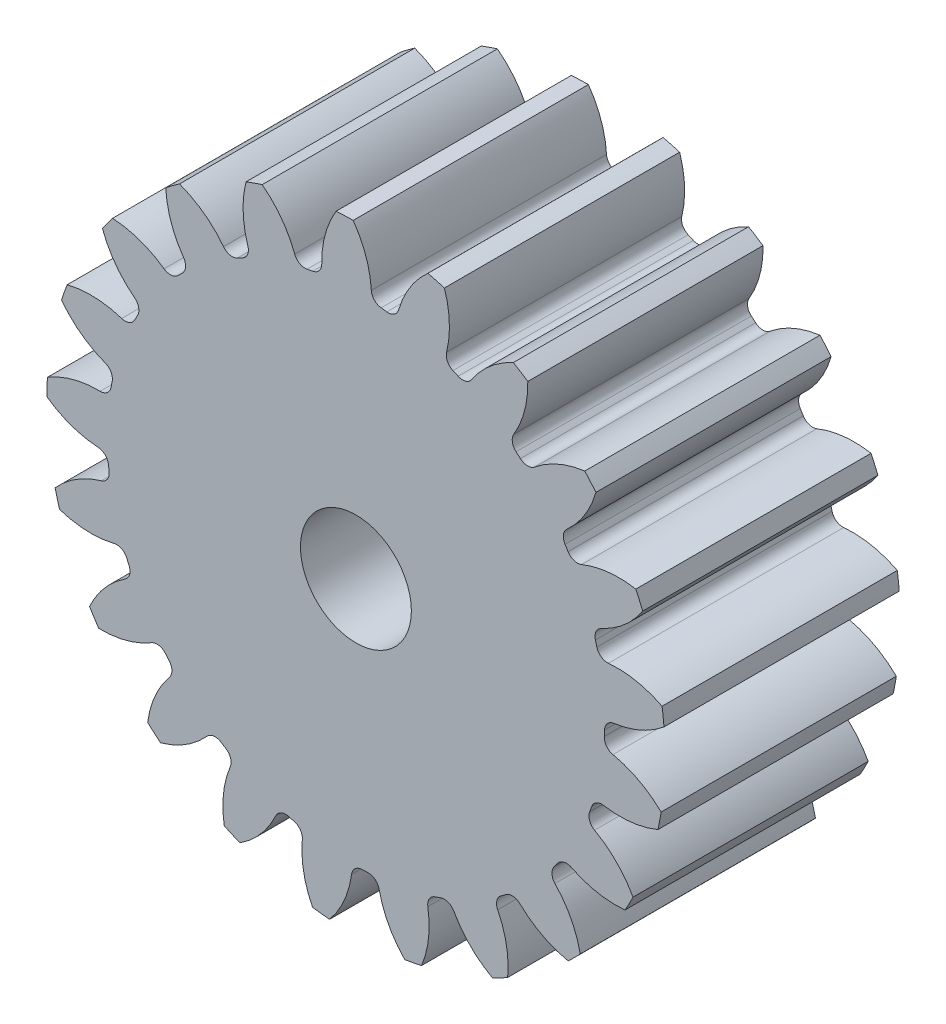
ISO-10303-21;
HEADER;
FILE_DESCRIPTION(('STEP AP214'),'2;1');
FILE_NAME('part.step','',(''),(''),'','','');
FILE_SCHEMA(('AUTOMOTIVE_DESIGN { 1 0 10303 214 1 1 1 1 }'));
ENDSEC;
DATA;
#1=APPLICATION_CONTEXT('core data for automotive mechanical design processes');
#2=APPLICATION_PROTOCOL_DEFINITION('international standard','automotive_design',2000,#1);
#3=PRODUCT_CONTEXT('',#1,'mechanical');
#4=PRODUCT('Part','Part','',(#3));
#5=PRODUCT_RELATED_PRODUCT_CATEGORY('part','',(#4));
#6=PRODUCT_DEFINITION_FORMATION('','',#4);
#7=PRODUCT_DEFINITION_CONTEXT('part definition',#1,'design');
#8=PRODUCT_DEFINITION('design','',#6,#7);
#9=PRODUCT_DEFINITION_SHAPE('','',#8);
#10=(LENGTH_UNIT() NAMED_UNIT(*) SI_UNIT(.MILLI.,.METRE.));
#11=(NAMED_UNIT(*) PLANE_ANGLE_UNIT() SI_UNIT($,.RADIAN.));
#12=(NAMED_UNIT(*) SI_UNIT($,.STERADIAN.) SOLID_ANGLE_UNIT());
#13=UNCERTAINTY_MEASURE_WITH_UNIT(LENGTH_MEASURE(1.E-05),#10,'distance_accuracy_value','');
#14=(GEOMETRIC_REPRESENTATION_CONTEXT(3) GLOBAL_UNCERTAINTY_ASSIGNED_CONTEXT((#13)) GLOBAL_UNIT_ASSIGNED_CONTEXT((#10,
#11,#12)) REPRESENTATION_CONTEXT('',''));
#15=CARTESIAN_POINT('',(0.,0.,0.));
#16=DIRECTION('',(0.,0.,1.));
#17=DIRECTION('',(1.,0.,0.));
#18=AXIS2_PLACEMENT_3D('',#15,#16,#17);
#19=CARTESIAN_POINT('',(0.,0.,88.9));
#20=DIRECTION('',(0.,0.,-1.));
#21=DIRECTION('',(-1.,0.,0.));
#22=AXIS2_PLACEMENT_3D('',#19,#20,#21);
#23=CYLINDRICAL_SURFACE('',#22,116.84);
#24=DIRECTION('',(0.,0.,-1.));
#25=VECTOR('',#24,1.);
#26=CARTESIAN_POINT('',(115.713050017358,16.1887508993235,44.45));
#27=LINE('',#26,#25);
#28=CARTESIAN_POINT('',(115.713050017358,16.1887508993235,88.9));
#29=VERTEX_POINT('',#28);
#30=CARTESIAN_POINT('',(115.713050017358,16.1887508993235,0.));
#31=VERTEX_POINT('',#30);
#32=EDGE_CURVE('E851',#29,#31,#27,.T.);
#33=ORIENTED_EDGE('',*,*,#32,.F.);
#34=CARTESIAN_POINT('',(0.,0.,88.9));
#35=DIRECTION('',(0.,0.,1.));
#36=DIRECTION('',(1.,0.,0.));
#37=AXIS2_PLACEMENT_3D('',#34,#35,#36);
#38=CIRCLE('',#37,116.84);
#39=CARTESIAN_POINT('',(116.431367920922,9.76330702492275,88.9));
#40=VERTEX_POINT('',#39);
#41=EDGE_CURVE('E1610',#40,#29,#38,.T.);
#42=ORIENTED_EDGE('',*,*,#41,.F.);
#43=DIRECTION('',(0.,0.,-1.));
#44=VECTOR('',#43,1.);
#45=CARTESIAN_POINT('',(116.431367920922,9.76330702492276,44.45));
#46=LINE('',#45,#44);
#47=CARTESIAN_POINT('',(116.431367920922,9.76330702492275,0.));
#48=VERTEX_POINT('',#47);
#49=EDGE_CURVE('E1604',#48,#40,#46,.F.);
#50=ORIENTED_EDGE('',*,*,#49,.F.);
#51=CARTESIAN_POINT('',(0.,0.,0.));
#52=DIRECTION('',(0.,0.,1.));
#53=DIRECTION('',(1.,0.,0.));
#54=AXIS2_PLACEMENT_3D('',#51,#52,#53);
#55=CIRCLE('',#54,116.84);
#56=EDGE_CURVE('E1615',#48,#31,#55,.T.);
#57=ORIENTED_EDGE('',*,*,#56,.T.);
#58=EDGE_LOOP('',(#33,#42,#50,#57));
#59=FACE_BOUND('',#58,.T.);
#60=ADVANCED_FACE('F32',(#59),#23,.T.);
#61=DIRECTION('',(0.,0.,-1.));
#62=VECTOR('',#61,1.);
#63=CARTESIAN_POINT('',(108.380863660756,43.648298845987,44.45));
#64=LINE('',#63,#62);
#65=CARTESIAN_POINT('',(108.380863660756,43.648298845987,0.));
#66=VERTEX_POINT('',#65);
#67=CARTESIAN_POINT('',(108.380863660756,43.648298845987,88.9));
#68=VERTEX_POINT('',#67);
#69=EDGE_CURVE('E822',#66,#68,#64,.F.);
#70=ORIENTED_EDGE('',*,*,#69,.F.);
#71=CARTESIAN_POINT('',(105.800525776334,49.5765503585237,0.));
#72=VERTEX_POINT('',#71);
#73=EDGE_CURVE('E1618',#66,#72,#55,.T.);
#74=ORIENTED_EDGE('',*,*,#73,.T.);
#75=DIRECTION('',(0.,0.,-1.));
#76=VECTOR('',#75,1.);
#77=CARTESIAN_POINT('',(105.800525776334,49.5765503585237,44.45));
#78=LINE('',#77,#76);
#79=CARTESIAN_POINT('',(105.800525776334,49.5765503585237,88.9));
#80=VERTEX_POINT('',#79);
#81=EDGE_CURVE('E884',#80,#72,#78,.T.);
#82=ORIENTED_EDGE('',*,*,#81,.F.);
#83=EDGE_CURVE('E1613',#68,#80,#38,.T.);
#84=ORIENTED_EDGE('',*,*,#83,.F.);
#85=EDGE_LOOP('',(#70,#74,#82,#84));
#86=FACE_BOUND('',#85,.T.);
#87=ADVANCED_FACE('F1855',(#86),#23,.T.);
#88=CARTESIAN_POINT('',(0.,0.,88.9));
#89=DIRECTION('',(0.,0.,1.));
#90=DIRECTION('',(1.,0.,0.));
#91=AXIS2_PLACEMENT_3D('',#88,#89,#90);
#92=PLANE('',#91);
#93=CARTESIAN_POINT('',(0.,0.,88.9000000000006));
#94=DIRECTION('',(0.,0.,1.));
#95=DIRECTION('',(1.,0.,0.));
#96=AXIS2_PLACEMENT_3D('',#93,#94,#95);
#97=CIRCLE('',#96,20.955);
#98=CARTESIAN_POINT('',(20.955,0.,88.9000000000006));
#99=VERTEX_POINT('',#98);
#100=EDGE_CURVE('E839',#99,#99,#97,.T.);
#101=ORIENTED_EDGE('',*,*,#100,.F.);
#102=EDGE_LOOP('',(#101));
#103=FACE_BOUND('',#102,.T.);
#104=ORIENTED_EDGE('',*,*,#41,.T.);
#105=CARTESIAN_POINT('',(98.8006867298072,-16.9636899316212,88.9));
#106=DIRECTION('',(0.,0.,-1.));
#107=DIRECTION('',(0.955572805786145,0.294755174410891,0.));
#108=AXIS2_PLACEMENT_3D('',#105,#106,#107);
#109=CIRCLE('',#108,37.21709775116);
#110=CARTESIAN_POINT('',(95.4507784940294,20.102338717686,88.9));
#111=VERTEX_POINT('',#110);
#112=EDGE_CURVE('E831',#111,#29,#109,.T.);
#113=ORIENTED_EDGE('',*,*,#112,.F.);
#114=CARTESIAN_POINT('',(95.078576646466,24.2206737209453,88.9));
#115=DIRECTION('',(0.,0.,1.));
#116=DIRECTION('',(-0.955572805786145,-0.294755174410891,0.));
#117=AXIS2_PLACEMENT_3D('',#114,#115,#116);
#118=CIRCLE('',#117,4.13512000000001);
#119=CARTESIAN_POINT('',(91.0714335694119,23.199879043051,88.9));
#120=VERTEX_POINT('',#119);
#121=EDGE_CURVE('E829',#120,#111,#118,.T.);
#122=ORIENTED_EDGE('',*,*,#121,.F.);
#123=CARTESIAN_POINT('',(0.,0.,88.9));
#124=DIRECTION('',(0.,0.,-1.));
#125=DIRECTION('',(0.955572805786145,0.294755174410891,0.));
#126=AXIS2_PLACEMENT_3D('',#123,#124,#125);
#127=CIRCLE('',#126,93.98);
#128=CARTESIAN_POINT('',(90.51421285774,25.2867093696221,88.9));
#129=VERTEX_POINT('',#128);
#130=EDGE_CURVE('E814',#129,#120,#127,.T.);
#131=ORIENTED_EDGE('',*,*,#130,.F.);
#132=CARTESIAN_POINT('',(94.4968382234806,26.3993245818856,88.9));
#133=DIRECTION('',(0.,0.,1.));
#134=DIRECTION('',(-0.955572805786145,-0.294755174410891,0.));
#135=AXIS2_PLACEMENT_3D('',#132,#133,#134);
#136=CIRCLE('',#135,4.13512000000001);
#137=CARTESIAN_POINT('',(92.7665337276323,30.1550220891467,88.9));
#138=VERTEX_POINT('',#137);
#139=EDGE_CURVE('E806',#138,#129,#136,.T.);
#140=ORIENTED_EDGE('',*,*,#139,.F.);
#141=CARTESIAN_POINT('',(77.193367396,63.957224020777,88.9));
#142=DIRECTION('',(0.,0.,-1.));
#143=DIRECTION('',(-0.955572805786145,-0.294755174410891,0.));
#144=AXIS2_PLACEMENT_3D('',#141,#142,#143);
#145=CIRCLE('',#144,37.21709775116);
#146=EDGE_CURVE('E836',#68,#138,#145,.T.);
#147=ORIENTED_EDGE('',*,*,#146,.F.);
#148=ORIENTED_EDGE('',*,*,#83,.T.);
#149=CARTESIAN_POINT('',(99.4113848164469,12.9119728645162,88.9));
#150=DIRECTION('',(0.,0.,-1.));
#151=DIRECTION('',(0.826238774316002,0.563320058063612,0.));
#152=AXIS2_PLACEMENT_3D('',#149,#150,#151);
#153=CIRCLE('',#152,37.21709775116);
#154=CARTESIAN_POINT('',(85.2848998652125,47.3438590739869,88.9));
#155=VERTEX_POINT('',#154);
#156=EDGE_CURVE('E860',#155,#80,#153,.T.);
#157=ORIENTED_EDGE('',*,*,#156,.F.);
#158=CARTESIAN_POINT('',(83.7153333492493,51.1695195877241,88.9));
#159=DIRECTION('',(0.,0.,1.));
#160=DIRECTION('',(-0.826238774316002,-0.563320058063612,0.));
#161=AXIS2_PLACEMENT_3D('',#158,#159,#160);
#162=CIRCLE('',#161,4.13512000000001);
#163=CARTESIAN_POINT('',(80.1871009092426,49.0129497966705,88.9));
#164=VERTEX_POINT('',#163);
#165=EDGE_CURVE('E858',#164,#155,#162,.T.);
#166=ORIENTED_EDGE('',*,*,#165,.F.);
#167=CARTESIAN_POINT('',(0.,0.,88.9));
#168=DIRECTION('',(0.,0.,-1.));
#169=DIRECTION('',(0.826238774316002,0.563320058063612,0.));
#170=AXIS2_PLACEMENT_3D('',#167,#168,#169);
#171=CIRCLE('',#170,93.98);
#172=CARTESIAN_POINT('',(79.0395319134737,50.8428244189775,88.9));
#173=VERTEX_POINT('',#172);
#174=EDGE_CURVE('E855',#173,#164,#171,.T.);
#175=ORIENTED_EDGE('',*,*,#174,.F.);
#176=CARTESIAN_POINT('',(82.5172713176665,53.0799086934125,88.9));
#177=DIRECTION('',(0.,0.,1.));
#178=DIRECTION('',(-0.826238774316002,-0.563320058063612,0.));
#179=AXIS2_PLACEMENT_3D('',#176,#177,#178);
#180=CIRCLE('',#179,4.13512000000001);
#181=CARTESIAN_POINT('',(79.756828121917,56.1587348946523,88.9));
#182=VERTEX_POINT('',#181);
#183=EDGE_CURVE('E853',#182,#173,#180,.T.);
#184=ORIENTED_EDGE('',*,*,#183,.F.);
#185=CARTESIAN_POINT('',(54.9121599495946,83.8689284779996,88.9));
#186=DIRECTION('',(0.,0.,-1.));
#187=DIRECTION('',(-0.826238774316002,-0.563320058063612,0.));
#188=AXIS2_PLACEMENT_3D('',#185,#186,#187);
#189=CIRCLE('',#188,37.21709775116);
#190=CARTESIAN_POINT('',(90.7002440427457,73.6549477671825,88.9));
#191=VERTEX_POINT('',#190);
#192=EDGE_CURVE('E863',#191,#182,#189,.T.);
#193=ORIENTED_EDGE('',*,*,#192,.F.);
#194=CARTESIAN_POINT('',(86.4871605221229,78.5592557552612,88.9));
#195=VERTEX_POINT('',#194);
#196=EDGE_CURVE('E1668',#191,#195,#38,.T.);
#197=ORIENTED_EDGE('',*,*,#196,.T.);
#198=CARTESIAN_POINT('',(91.1889451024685,41.6403502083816,88.9));
#199=DIRECTION('',(0.,0.,-1.));
#200=DIRECTION('',(0.623489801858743,0.781831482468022,0.));
#201=AXIS2_PLACEMENT_3D('',#198,#199,#200);
#202=CIRCLE('',#201,37.21709775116);
#203=CARTESIAN_POINT('',(67.5410836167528,70.3786697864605,88.9));
#204=VERTEX_POINT('',#203);
#205=EDGE_CURVE('E895',#204,#195,#202,.T.);
#206=ORIENTED_EDGE('',*,*,#205,.F.);
#207=CARTESIAN_POINT('',(64.9136153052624,73.5717290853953,88.9));
#208=DIRECTION('',(0.,0.,1.));
#209=DIRECTION('',(-0.623489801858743,-0.781831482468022,0.));
#210=AXIS2_PLACEMENT_3D('',#207,#208,#209);
#211=CIRCLE('',#210,4.13512000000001);
#212=CARTESIAN_POINT('',(62.1777924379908,70.4710048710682,88.9));
#213=VERTEX_POINT('',#212);
#214=EDGE_CURVE('E893',#213,#204,#211,.T.);
#215=ORIENTED_EDGE('',*,*,#214,.F.);
#216=CARTESIAN_POINT('',(0.,0.,88.9));
#217=DIRECTION('',(0.,0.,-1.));
#218=DIRECTION('',(0.623489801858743,0.781831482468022,0.));
#219=AXIS2_PLACEMENT_3D('',#216,#217,#218);
#220=CIRCLE('',#219,93.98);
#221=CARTESIAN_POINT('',(60.5418416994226,71.8813313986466,88.9));
#222=VERTEX_POINT('',#221);
#223=EDGE_CURVE('E890',#222,#213,#220,.T.);
#224=ORIENTED_EDGE('',*,*,#223,.F.);
#225=CARTESIAN_POINT('',(63.2056827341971,75.0441099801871,88.9));
#226=DIRECTION('',(0.,0.,1.));
#227=DIRECTION('',(-0.623489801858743,-0.781831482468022,0.));
#228=AXIS2_PLACEMENT_3D('',#225,#226,#227);
#229=CIRCLE('',#228,4.13512000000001);
#230=CARTESIAN_POINT('',(59.6603783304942,77.1724976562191,88.9));
#231=VERTEX_POINT('',#230);
#232=EDGE_CURVE('E888',#231,#222,#229,.T.);
#233=ORIENTED_EDGE('',*,*,#232,.F.);
#234=CARTESIAN_POINT('',(27.751766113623,96.3285105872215,88.9));
#235=DIRECTION('',(0.,0.,-1.));
#236=DIRECTION('',(-0.623489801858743,-0.781831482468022,0.));
#237=AXIS2_PLACEMENT_3D('',#234,#235,#236);
#238=CIRCLE('',#237,37.21709775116);
#239=CARTESIAN_POINT('',(64.9605097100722,97.1170313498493,88.9));
#240=VERTEX_POINT('',#239);
#241=EDGE_CURVE('E898',#240,#231,#238,.T.);
#242=ORIENTED_EDGE('',*,*,#241,.F.);
#243=CARTESIAN_POINT('',(59.4890315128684,100.561626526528,88.9));
#244=VERTEX_POINT('',#243);
#245=EDGE_CURVE('E1837',#240,#244,#38,.T.);
#246=ORIENTED_EDGE('',*,*,#245,.T.);
#247=CARTESIAN_POINT('',(74.8639674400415,66.6687997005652,88.9));
#248=DIRECTION('',(0.,0.,-1.));
#249=DIRECTION('',(0.365341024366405,0.9308737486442,0.));
#250=AXIS2_PLACEMENT_3D('',#247,#248,#249);
#251=CIRCLE('',#250,37.21709775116);
#252=CARTESIAN_POINT('',(43.7959456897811,87.1600268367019,88.9));
#253=VERTEX_POINT('',#252);
#254=EDGE_CURVE('E933',#253,#244,#251,.T.);
#255=ORIENTED_EDGE('',*,*,#254,.F.);
#256=CARTESIAN_POINT('',(40.3440376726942,89.436767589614,88.9));
#257=DIRECTION('',(0.,0.,1.));
#258=DIRECTION('',(-0.365341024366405,-0.9308737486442,0.));
#259=AXIS2_PLACEMENT_3D('',#256,#257,#258);
#260=CIRCLE('',#259,4.13512000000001);
#261=CARTESIAN_POINT('',(38.6437142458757,85.6674019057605,88.9));
#262=VERTEX_POINT('',#261);
#263=EDGE_CURVE('E931',#262,#253,#260,.T.);
#264=ORIENTED_EDGE('',*,*,#263,.F.);
#265=CARTESIAN_POINT('',(0.,0.,88.9));
#266=DIRECTION('',(0.,0.,-1.));
#267=DIRECTION('',(0.365341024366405,0.9308737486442,0.));
#268=AXIS2_PLACEMENT_3D('',#265,#266,#267);
#269=CIRCLE('',#268,93.98);
#270=CARTESIAN_POINT('',(36.6647431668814,86.5328666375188,88.9));
#271=VERTEX_POINT('',#270);
#272=EDGE_CURVE('E928',#271,#262,#269,.T.);
#273=ORIENTED_EDGE('',*,*,#272,.F.);
#274=CARTESIAN_POINT('',(38.2779918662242,90.3403127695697,88.9));
#275=DIRECTION('',(0.,0.,1.));
#276=DIRECTION('',(-0.365341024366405,-0.9308737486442,0.));
#277=AXIS2_PLACEMENT_3D('',#274,#275,#276);
#278=CIRCLE('',#277,4.13512000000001);
#279=CARTESIAN_POINT('',(34.262842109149,91.3291453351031,88.9));
#280=VERTEX_POINT('',#279);
#281=EDGE_CURVE('E926',#280,#271,#278,.T.);
#282=ORIENTED_EDGE('',*,*,#281,.F.);
#283=CARTESIAN_POINT('',(-1.87449392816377,100.228881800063,88.9));
#284=DIRECTION('',(0.,0.,-1.));
#285=DIRECTION('',(-0.365341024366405,-0.9308737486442,0.));
#286=AXIS2_PLACEMENT_3D('',#283,#284,#285);
#287=CIRCLE('',#286,37.21709775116);
#288=CARTESIAN_POINT('',(33.4487490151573,111.94984050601,88.9));
#289=VERTEX_POINT('',#288);
#290=EDGE_CURVE('E936',#289,#280,#287,.T.);
#291=ORIENTED_EDGE('',*,*,#290,.F.);
#292=CARTESIAN_POINT('',(27.2050409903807,113.628655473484,88.9));
#293=VERTEX_POINT('',#292);
#294=EDGE_CURVE('E1833',#289,#293,#38,.T.);
#295=ORIENTED_EDGE('',*,*,#294,.T.);
#296=CARTESIAN_POINT('',(51.886997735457,85.7734337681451,88.9));
#297=DIRECTION('',(0.,0.,-1.));
#298=DIRECTION('',(0.074730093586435,0.997203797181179,0.));
#299=AXIS2_PLACEMENT_3D('',#296,#297,#298);
#300=CIRCLE('',#299,37.21709775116);
#301=CARTESIAN_POINT('',(16.1593457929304,96.1968330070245,88.9));
#302=VERTEX_POINT('',#301);
#303=EDGE_CURVE('E971',#302,#293,#300,.T.);
#304=ORIENTED_EDGE('',*,*,#303,.F.);
#305=CARTESIAN_POINT('',(12.1897152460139,97.3549568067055,88.9));
#306=DIRECTION('',(0.,0.,1.));
#307=DIRECTION('',(-0.074730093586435,-0.997203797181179,0.));
#308=AXIS2_PLACEMENT_3D('',#305,#306,#307);
#309=CIRCLE('',#308,4.13512000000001);
#310=CARTESIAN_POINT('',(11.6759724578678,93.2518743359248,88.9));
#311=VERTEX_POINT('',#310);
#312=EDGE_CURVE('E969',#311,#302,#309,.T.);
#313=ORIENTED_EDGE('',*,*,#312,.F.);
#314=CARTESIAN_POINT('',(0.,0.,88.9));
#315=DIRECTION('',(0.,0.,-1.));
#316=DIRECTION('',(0.074730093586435,0.997203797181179,0.));
#317=AXIS2_PLACEMENT_3D('',#314,#315,#316);
#318=CIRCLE('',#317,93.98);
#319=CARTESIAN_POINT('',(9.52982130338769,93.495576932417,88.9));
#320=VERTEX_POINT('',#319);
#321=EDGE_CURVE('E966',#320,#311,#318,.T.);
#322=ORIENTED_EDGE('',*,*,#321,.F.);
#323=CARTESIAN_POINT('',(9.9491334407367,97.6093823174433,88.9));
#324=DIRECTION('',(0.,0.,1.));
#325=DIRECTION('',(-0.074730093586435,-0.997203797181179,0.));
#326=AXIS2_PLACEMENT_3D('',#323,#324,#325);
#327=CIRCLE('',#326,4.13512000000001);
#328=CARTESIAN_POINT('',(5.82090200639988,97.3707976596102,88.9));
#329=VERTEX_POINT('',#328);
#330=EDGE_CURVE('E964',#329,#320,#327,.T.);
#331=ORIENTED_EDGE('',*,*,#330,.F.);
#332=CARTESIAN_POINT('',(-31.334196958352,95.2234770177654,88.9));
#333=DIRECTION('',(0.,0.,-1.));
#334=DIRECTION('',(-0.074730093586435,-0.997203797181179,0.));
#335=AXIS2_PLACEMENT_3D('',#332,#333,#334);
#336=CIRCLE('',#335,37.21709775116);
#337=CARTESIAN_POINT('',(-1.03507981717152,116.835415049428,88.9));
#338=VERTEX_POINT('',#337);
#339=EDGE_CURVE('E974',#338,#329,#336,.T.);
#340=ORIENTED_EDGE('',*,*,#339,.F.);
#341=CARTESIAN_POINT('',(-7.49623681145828,116.599279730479,88.9));
#342=VERTEX_POINT('',#341);
#343=EDGE_CURVE('E1829',#338,#342,#38,.T.);
#344=ORIENTED_EDGE('',*,*,#343,.T.);
#345=CARTESIAN_POINT('',(24.299640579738,97.2567218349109,88.9));
#346=DIRECTION('',(0.,0.,-1.));
#347=DIRECTION('',(-0.222520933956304,0.974927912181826,0.));
#348=AXIS2_PLACEMENT_3D('',#345,#346,#347);
#349=CIRCLE('',#348,37.21709775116);
#350=CARTESIAN_POINT('',(-12.9130828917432,96.6861284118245,88.9));
#351=VERTEX_POINT('',#350);
#352=EDGE_CURVE('E1009',#351,#342,#349,.T.);
#353=ORIENTED_EDGE('',*,*,#352,.F.);
#354=CARTESIAN_POINT('',(-17.047716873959,96.6227308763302,88.9));
#355=DIRECTION('',(0.,0.,1.));
#356=DIRECTION('',(0.222520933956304,-0.974927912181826,0.));
#357=AXIS2_PLACEMENT_3D('',#354,#355,#356);
#358=CIRCLE('',#357,4.13512000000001);
#359=CARTESIAN_POINT('',(-16.3292307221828,92.550508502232,88.9));
#360=VERTEX_POINT('',#359);
#361=EDGE_CURVE('E1007',#360,#351,#358,.T.);
#362=ORIENTED_EDGE('',*,*,#361,.F.);
#363=CARTESIAN_POINT('',(0.,0.,88.9));
#364=DIRECTION('',(0.,0.,-1.));
#365=DIRECTION('',(-0.222520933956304,0.974927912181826,0.));
#366=AXIS2_PLACEMENT_3D('',#363,#364,#365);
#367=CIRCLE('',#366,93.98);
#368=CARTESIAN_POINT('',(-18.451867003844,92.1507949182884,88.9));
#369=VERTEX_POINT('',#368);
#370=EDGE_CURVE('E1004',#369,#360,#367,.T.);
#371=ORIENTED_EDGE('',*,*,#370,.F.);
#372=CARTESIAN_POINT('',(-19.2637491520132,96.2054298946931,88.9));
#373=DIRECTION('',(0.,0.,1.));
#374=DIRECTION('',(0.222520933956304,-0.974927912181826,0.));
#375=AXIS2_PLACEMENT_3D('',#372,#373,#374);
#376=CIRCLE('',#375,4.13512000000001);
#377=CARTESIAN_POINT('',(-23.1382507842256,94.7606273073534,88.9));
#378=VERTEX_POINT('',#377);
#379=EDGE_CURVE('E1002',#378,#369,#376,.T.);
#380=ORIENTED_EDGE('',*,*,#379,.F.);
#381=CARTESIAN_POINT('',(-58.0097190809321,81.7570484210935,88.9));
#382=DIRECTION('',(0.,0.,-1.));
#383=DIRECTION('',(0.222520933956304,-0.974927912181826,0.));
#384=AXIS2_PLACEMENT_3D('',#381,#382,#383);
#385=CIRCLE('',#384,37.21709775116);
#386=CARTESIAN_POINT('',(-35.4269372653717,111.33965024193,88.9));
#387=VERTEX_POINT('',#386);
#388=EDGE_CURVE('E1012',#387,#378,#385,.T.);
#389=ORIENTED_EDGE('',*,*,#388,.F.);
#390=CARTESIAN_POINT('',(-41.5314410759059,109.20954629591,88.9));
#391=VERTEX_POINT('',#390);
#392=EDGE_CURVE('E1825',#387,#391,#38,.T.);
#393=ORIENTED_EDGE('',*,*,#392,.T.);
#394=CARTESIAN_POINT('',(-5.4468462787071,100.098323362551,88.9));
#395=DIRECTION('',(0.,0.,-1.));
#396=DIRECTION('',(-0.499999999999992,0.866025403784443,0.));
#397=AXIS2_PLACEMENT_3D('',#394,#395,#396);
#398=CIRCLE('',#397,37.21709775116);
#399=CARTESIAN_POINT('',(-40.8381274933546,88.584437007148,88.9));
#400=VERTEX_POINT('',#399);
#401=EDGE_CURVE('E1047',#400,#391,#398,.T.);
#402=ORIENTED_EDGE('',*,*,#401,.F.);
#403=CARTESIAN_POINT('',(-44.7703845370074,87.3051512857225,88.9));
#404=DIRECTION('',(0.,0.,1.));
#405=DIRECTION('',(0.499999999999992,-0.866025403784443,0.));
#406=AXIS2_PLACEMENT_3D('',#403,#404,#405);
#407=CIRCLE('',#406,4.13512000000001);
#408=CARTESIAN_POINT('',(-42.8835100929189,83.625623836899,88.9));
#409=VERTEX_POINT('',#408);
#410=EDGE_CURVE('E1045',#409,#400,#407,.T.);
#411=ORIENTED_EDGE('',*,*,#410,.F.);
#412=CARTESIAN_POINT('',(0.,0.,88.9));
#413=DIRECTION('',(0.,0.,-1.));
#414=DIRECTION('',(-0.499999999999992,0.866025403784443,0.));
#415=AXIS2_PLACEMENT_3D('',#412,#413,#414);
#416=CIRCLE('',#415,93.98);
#417=CARTESIAN_POINT('',(-44.7940259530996,82.6180103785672,88.9));
#418=VERTEX_POINT('',#417);
#419=EDGE_CURVE('E1042',#418,#409,#416,.T.);
#420=ORIENTED_EDGE('',*,*,#419,.F.);
#421=CARTESIAN_POINT('',(-46.764963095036,86.2532028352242,88.9));
#422=DIRECTION('',(0.,0.,1.));
#423=DIRECTION('',(0.499999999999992,-0.866025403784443,0.));
#424=AXIS2_PLACEMENT_3D('',#421,#422,#423);
#425=CIRCLE('',#424,4.13512000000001);
#426=CARTESIAN_POINT('',(-50.0414684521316,83.7305593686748,88.9));
#427=VERTEX_POINT('',#426);
#428=EDGE_CURVE('E1040',#427,#418,#425,.T.);
#429=ORIENTED_EDGE('',*,*,#428,.F.);
#430=CARTESIAN_POINT('',(-79.5308230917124,61.0261472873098,88.9));
#431=DIRECTION('',(0.,0.,-1.));
#432=DIRECTION('',(0.499999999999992,-0.866025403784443,0.));
#433=AXIS2_PLACEMENT_3D('',#430,#431,#432);
#434=CIRCLE('',#433,37.21709775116);
#435=CARTESIAN_POINT('',(-66.6709558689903,95.9508689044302,88.9));
#436=VERTEX_POINT('',#435);
#437=EDGE_CURVE('E1050',#436,#427,#434,.T.);
#438=ORIENTED_EDGE('',*,*,#437,.F.);
#439=CARTESIAN_POINT('',(-71.8763945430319,92.1160654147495,88.9));
#440=VERTEX_POINT('',#439);
#441=EDGE_CURVE('E1821',#436,#440,#38,.T.);
#442=ORIENTED_EDGE('',*,*,#441,.T.);
#443=CARTESIAN_POINT('',(-34.7093569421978,94.0457495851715,88.9));
#444=DIRECTION('',(0.,0.,-1.));
#445=DIRECTION('',(-0.73305187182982,0.680172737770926,0.));
#446=AXIS2_PLACEMENT_3D('',#443,#444,#445);
#447=CIRCLE('',#446,37.21709775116);
#448=CARTESIAN_POINT('',(-65.1345252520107,72.6116296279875,88.9));
#449=VERTEX_POINT('',#448);
#450=EDGE_CURVE('E1085',#449,#440,#447,.T.);
#451=ORIENTED_EDGE('',*,*,#450,.F.);
#452=CARTESIAN_POINT('',(-68.5150070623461,70.2301258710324,88.9));
#453=DIRECTION('',(0.,0.,1.));
#454=DIRECTION('',(0.73305187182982,-0.680172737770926,0.));
#455=AXIS2_PLACEMENT_3D('',#452,#453,#454);
#456=CIRCLE('',#455,4.13512000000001);
#457=CARTESIAN_POINT('',(-65.6274014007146,67.2702355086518,88.9));
#458=VERTEX_POINT('',#457);
#459=EDGE_CURVE('E1083',#458,#449,#456,.T.);
#460=ORIENTED_EDGE('',*,*,#459,.F.);
#461=CARTESIAN_POINT('',(0.,0.,88.9));
#462=DIRECTION('',(0.,0.,-1.));
#463=DIRECTION('',(-0.73305187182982,0.680172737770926,0.));
#464=AXIS2_PLACEMENT_3D('',#461,#462,#463);
#465=CIRCLE('',#464,93.98);
#466=CARTESIAN_POINT('',(-67.1560391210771,65.7442530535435,88.9));
#467=VERTEX_POINT('',#466);
#468=EDGE_CURVE('E1080',#467,#458,#465,.T.);
#469=ORIENTED_EDGE('',*,*,#468,.F.);
#470=CARTESIAN_POINT('',(-70.1109048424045,68.6370001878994,88.9));
#471=DIRECTION('',(0.,0.,1.));
#472=DIRECTION('',(0.73305187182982,-0.680172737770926,0.));
#473=AXIS2_PLACEMENT_3D('',#470,#471,#472);
#474=CIRCLE('',#473,4.13512000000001);
#475=CARTESIAN_POINT('',(-72.4982820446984,65.2606637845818,88.9));
#476=VERTEX_POINT('',#475);
#477=EDGE_CURVE('E1078',#476,#467,#474,.T.);
#478=ORIENTED_EDGE('',*,*,#477,.F.);
#479=CARTESIAN_POINT('',(-93.9852644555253,34.8728051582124,88.9));
#480=DIRECTION('',(0.,0.,-1.));
#481=DIRECTION('',(0.73305187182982,-0.680172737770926,0.));
#482=AXIS2_PLACEMENT_3D('',#479,#480,#481);
#483=CIRCLE('',#482,37.21709775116);
#484=CARTESIAN_POINT('',(-91.9909674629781,72.0364317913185,88.9));
#485=VERTEX_POINT('',#484);
#486=EDGE_CURVE('E1088',#485,#476,#483,.T.);
#487=ORIENTED_EDGE('',*,*,#486,.F.);
#488=CARTESIAN_POINT('',(-95.8348149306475,66.8376678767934,88.9));
#489=VERTEX_POINT('',#488);
#490=EDGE_CURVE('E1817',#485,#489,#38,.T.);
#491=ORIENTED_EDGE('',*,*,#490,.T.);
#492=CARTESIAN_POINT('',(-60.8877889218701,79.6367982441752,88.9));
#493=DIRECTION('',(0.,0.,-1.));
#494=DIRECTION('',(-0.900968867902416,0.433883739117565,0.));
#495=AXIS2_PLACEMENT_3D('',#492,#493,#494);
#496=CIRCLE('',#495,37.21709775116);
#497=CARTESIAN_POINT('',(-83.6434346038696,50.1869603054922,88.9));
#498=VERTEX_POINT('',#497);
#499=EDGE_CURVE('E1123',#498,#489,#496,.T.);
#500=ORIENTED_EDGE('',*,*,#499,.F.);
#501=CARTESIAN_POINT('',(-86.1717705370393,46.9148455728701,88.9));
#502=DIRECTION('',(0.,0.,1.));
#503=DIRECTION('',(0.900968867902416,-0.433883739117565,0.));
#504=AXIS2_PLACEMENT_3D('',#501,#502,#503);
#505=CIRCLE('',#504,4.13512000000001);
#506=CARTESIAN_POINT('',(-82.5400100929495,44.9375915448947,88.9));
#507=VERTEX_POINT('',#506);
#508=EDGE_CURVE('E1121',#507,#498,#505,.T.);
#509=ORIENTED_EDGE('',*,*,#508,.F.);
#510=CARTESIAN_POINT('',(0.,0.,88.9));
#511=DIRECTION('',(0.,0.,-1.));
#512=DIRECTION('',(-0.900968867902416,0.433883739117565,0.));
#513=AXIS2_PLACEMENT_3D('',#510,#511,#512);
#514=CIRCLE('',#513,93.98);
#515=CARTESIAN_POINT('',(-83.5509435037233,43.02883033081,88.9));
#516=VERTEX_POINT('',#515);
#517=EDGE_CURVE('E1118',#516,#507,#514,.T.);
#518=ORIENTED_EDGE('',*,*,#517,.F.);
#519=CARTESIAN_POINT('',(-87.2271850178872,44.9220988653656,88.9));
#520=DIRECTION('',(0.,0.,1.));
#521=DIRECTION('',(0.900968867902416,-0.433883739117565,0.));
#522=AXIS2_PLACEMENT_3D('',#519,#520,#521);
#523=CIRCLE('',#522,4.13512000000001);
#524=CARTESIAN_POINT('',(-88.5133051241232,40.9920718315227,88.9));
#525=VERTEX_POINT('',#524);
#526=EDGE_CURVE('E1116',#525,#516,#523,.T.);
#527=ORIENTED_EDGE('',*,*,#526,.F.);
#528=CARTESIAN_POINT('',(-100.088702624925,5.62086125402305,88.9));
#529=DIRECTION('',(0.,0.,-1.));
#530=DIRECTION('',(0.900968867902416,-0.433883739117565,0.));
#531=AXIS2_PLACEMENT_3D('',#528,#529,#530);
#532=CIRCLE('',#531,37.21709775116);
#533=CARTESIAN_POINT('',(-109.137177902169,41.7212415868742,88.9));
#534=VERTEX_POINT('',#533);
#535=EDGE_CURVE('E1126',#534,#525,#532,.T.);
#536=ORIENTED_EDGE('',*,*,#535,.F.);
#537=CARTESIAN_POINT('',(-111.277891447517,35.62045023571,88.9));
#538=VERTEX_POINT('',#537);
#539=EDGE_CURVE('E1813',#534,#538,#38,.T.);
#540=ORIENTED_EDGE('',*,*,#539,.T.);
#541=CARTESIAN_POINT('',(-81.6560736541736,58.1517678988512,88.9));
#542=DIRECTION('',(0.,0.,-1.));
#543=DIRECTION('',(-0.988830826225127,0.149042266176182,0.));
#544=AXIS2_PLACEMENT_3D('',#541,#542,#543);
#545=CIRCLE('',#544,37.21709775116);
#546=CARTESIAN_POINT('',(-94.7202577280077,23.3029593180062,88.9));
#547=VERTEX_POINT('',#546);
#548=EDGE_CURVE('E1161',#547,#538,#545,.T.);
#549=ORIENTED_EDGE('',*,*,#548,.F.);
#550=CARTESIAN_POINT('',(-96.1717940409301,19.4309753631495,88.9));
#551=DIRECTION('',(0.,0.,1.));
#552=DIRECTION('',(0.988830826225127,-0.149042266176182,0.));
#553=AXIS2_PLACEMENT_3D('',#550,#551,#552);
#554=CIRCLE('',#553,4.13512000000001);
#555=CARTESIAN_POINT('',(-92.1185766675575,18.6120453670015,88.9));
#556=VERTEX_POINT('',#555);
#557=EDGE_CURVE('E1159',#556,#547,#554,.T.);
#558=ORIENTED_EDGE('',*,*,#557,.F.);
#559=CARTESIAN_POINT('',(0.,0.,88.9));
#560=DIRECTION('',(0.,0.,-1.));
#561=DIRECTION('',(-0.988830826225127,0.149042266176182,0.));
#562=AXIS2_PLACEMENT_3D('',#559,#560,#561);
#563=CIRCLE('',#562,93.98);
#564=CARTESIAN_POINT('',(-92.5219798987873,16.4901072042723,88.9));
#565=VERTEX_POINT('',#564);
#566=EDGE_CURVE('E1156',#565,#556,#563,.T.);
#567=ORIENTED_EDGE('',*,*,#566,.F.);
#568=CARTESIAN_POINT('',(-96.592947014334,17.2156719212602,88.9));
#569=DIRECTION('',(0.,0.,1.));
#570=DIRECTION('',(0.988830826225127,-0.149042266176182,0.));
#571=AXIS2_PLACEMENT_3D('',#568,#569,#570);
#572=CIRCLE('',#571,4.13512000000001);
#573=CARTESIAN_POINT('',(-96.663532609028,13.0811544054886,88.9));
#574=VERTEX_POINT('',#573);
#575=EDGE_CURVE('E1154',#574,#565,#572,.T.);
#576=ORIENTED_EDGE('',*,*,#575,.F.);
#577=CARTESIAN_POINT('',(-97.2988203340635,-24.1305208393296,88.9));
#578=DIRECTION('',(0.,0.,-1.));
#579=DIRECTION('',(0.988830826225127,-0.149042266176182,0.));
#580=AXIS2_PLACEMENT_3D('',#577,#578,#579);
#581=CIRCLE('',#580,37.21709775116);
#582=CARTESIAN_POINT('',(-116.586071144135,7.69893597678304,88.9));
#583=VERTEX_POINT('',#582);
#584=EDGE_CURVE('E1164',#583,#574,#581,.T.);
#585=ORIENTED_EDGE('',*,*,#584,.F.);
#586=CARTESIAN_POINT('',(-116.833438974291,1.23819927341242,88.9));
#587=VERTEX_POINT('',#586);
#588=EDGE_CURVE('E1809',#583,#587,#38,.T.);
#589=ORIENTED_EDGE('',*,*,#588,.T.);
#590=CARTESIAN_POINT('',(-95.1688579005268,31.499697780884,88.9));
#591=DIRECTION('',(0.,0.,-1.));
#592=DIRECTION('',(-0.98883082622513,-0.149042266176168,0.));
#593=AXIS2_PLACEMENT_3D('',#590,#591,#592);
#594=CIRCLE('',#593,37.21709775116);
#595=CARTESIAN_POINT('',(-97.3807702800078,-5.65161186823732,88.9));
#596=VERTEX_POINT('',#595);
#597=EDGE_CURVE('E1199',#596,#587,#594,.T.);
#598=ORIENTED_EDGE('',*,*,#597,.F.);
#599=CARTESIAN_POINT('',(-97.6265316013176,-9.77942227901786,88.9));
#600=DIRECTION('',(0.,0.,1.));
#601=DIRECTION('',(0.98883082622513,0.149042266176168,0.));
#602=AXIS2_PLACEMENT_3D('',#599,#600,#601);
#603=CIRCLE('',#602,4.13512000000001);
#604=CARTESIAN_POINT('',(-93.5120034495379,-9.3672627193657,88.9));
#605=VERTEX_POINT('',#604);
#606=EDGE_CURVE('E1197',#605,#596,#603,.T.);
#607=ORIENTED_EDGE('',*,*,#606,.F.);
#608=CARTESIAN_POINT('',(0.,0.,88.9));
#609=DIRECTION('',(0.,0.,-1.));
#610=DIRECTION('',(-0.98883082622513,-0.149042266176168,0.));
#611=AXIS2_PLACEMENT_3D('',#608,#609,#610);
#612=CIRCLE('',#611,93.98);
#613=CARTESIAN_POINT('',(-93.2720323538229,-11.5138343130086,88.9));
#614=VERTEX_POINT('',#613);
#615=EDGE_CURVE('E1194',#614,#605,#612,.T.);
#616=ORIENTED_EDGE('',*,*,#615,.F.);
#617=CARTESIAN_POINT('',(-97.3760017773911,-12.020443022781,88.9));
#618=DIRECTION('',(0.,0.,1.));
#619=DIRECTION('',(0.98883082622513,0.149042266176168,0.));
#620=AXIS2_PLACEMENT_3D('',#617,#618,#619);
#621=CIRCLE('',#620,4.13512000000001);
#622=CARTESIAN_POINT('',(-96.2247810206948,-15.9920809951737,88.9));
#623=VERTEX_POINT('',#622);
#624=EDGE_CURVE('E1192',#623,#614,#621,.T.);
#625=ORIENTED_EDGE('',*,*,#624,.F.);
#626=CARTESIAN_POINT('',(-85.8635108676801,-51.7378002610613,88.9));
#627=DIRECTION('',(0.,0.,-1.));
#628=DIRECTION('',(0.98883082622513,0.149042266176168,0.));
#629=AXIS2_PLACEMENT_3D('',#626,#627,#628);
#630=CIRCLE('',#629,37.21709775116);
#631=CARTESIAN_POINT('',(-113.675780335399,-27.0074538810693,88.9));
#632=VERTEX_POINT('',#631);
#633=EDGE_CURVE('E1202',#632,#623,#630,.T.);
#634=ORIENTED_EDGE('',*,*,#633,.F.);
#635=CARTESIAN_POINT('',(-112.007822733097,-33.2540711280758,88.9));
#636=VERTEX_POINT('',#635);
#637=EDGE_CURVE('E1805',#632,#636,#38,.T.);
#638=ORIENTED_EDGE('',*,*,#637,.T.);
#639=CARTESIAN_POINT('',(-100.225471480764,2.04874128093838,88.9));
#640=DIRECTION('',(0.,0.,-1.));
#641=DIRECTION('',(-0.900968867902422,-0.433883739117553,0.));
#642=AXIS2_PLACEMENT_3D('',#639,#640,#641);
#643=CIRCLE('',#642,37.21709775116);
#644=CARTESIAN_POINT('',(-91.3885740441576,-34.1040125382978,88.9));
#645=VERTEX_POINT('',#644);
#646=EDGE_CURVE('E1237',#645,#636,#643,.T.);
#647=ORIENTED_EDGE('',*,*,#646,.F.);
#648=CARTESIAN_POINT('',(-90.4067234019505,-38.1208753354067,88.9));
#649=DIRECTION('',(0.,0.,1.));
#650=DIRECTION('',(0.900968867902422,0.433883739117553,0.));
#651=AXIS2_PLACEMENT_3D('',#648,#649,#650);
#652=CIRCLE('',#651,4.13512000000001);
#653=CARTESIAN_POINT('',(-86.5964783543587,-36.5142484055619,88.9));
#654=VERTEX_POINT('',#653);
#655=EDGE_CURVE('E1235',#654,#645,#652,.T.);
#656=ORIENTED_EDGE('',*,*,#655,.F.);
#657=CARTESIAN_POINT('',(0.,0.,88.9));
#658=DIRECTION('',(0.,0.,-1.));
#659=DIRECTION('',(-0.900968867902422,-0.433883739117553,0.));
#660=AXIS2_PLACEMENT_3D('',#657,#658,#659);
#661=CIRCLE('',#660,93.98);
#662=CARTESIAN_POINT('',(-85.7344554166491,-38.494721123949,88.9));
#663=VERTEX_POINT('',#662);
#664=EDGE_CURVE('E1232',#663,#654,#661,.T.);
#665=ORIENTED_EDGE('',*,*,#664,.F.);
#666=CARTESIAN_POINT('',(-89.5067714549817,-40.1884888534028,88.9));
#667=DIRECTION('',(0.,0.,1.));
#668=DIRECTION('',(0.900968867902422,0.433883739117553,0.));
#669=AXIS2_PLACEMENT_3D('',#666,#667,#668);
#670=CIRCLE('',#669,4.13512000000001);
#671=CARTESIAN_POINT('',(-87.2360353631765,-43.6443498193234,88.9));
#672=VERTEX_POINT('',#671);
#673=EDGE_CURVE('E1230',#672,#663,#670,.T.);
#674=ORIENTED_EDGE('',*,*,#673,.F.);
#675=CARTESIAN_POINT('',(-66.7988516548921,-74.7479490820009,88.9));
#676=DIRECTION('',(0.,0.,-1.));
#677=DIRECTION('',(0.900968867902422,0.433883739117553,0.));
#678=AXIS2_PLACEMENT_3D('',#675,#676,#677);
#679=CIRCLE('',#678,37.21709775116);
#680=CARTESIAN_POINT('',(-100.664897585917,-59.3141129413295,88.9));
#681=VERTEX_POINT('',#680);
#682=EDGE_CURVE('E1240',#681,#672,#679,.T.);
#683=ORIENTED_EDGE('',*,*,#682,.F.);
#684=CARTESIAN_POINT('',(-97.2298199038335,-64.791571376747,88.9));
#685=VERTEX_POINT('',#684);
#686=EDGE_CURVE('E1801',#681,#685,#38,.T.);
#687=ORIENTED_EDGE('',*,*,#686,.T.);
#688=CARTESIAN_POINT('',(-96.3766120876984,-27.5842548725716,88.9));
#689=DIRECTION('',(0.,0.,-1.));
#690=DIRECTION('',(-0.73305187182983,-0.680172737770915,0.));
#691=AXIS2_PLACEMENT_3D('',#688,#689,#690);
#692=CIRCLE('',#691,37.21709775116);
#693=CARTESIAN_POINT('',(-77.2761019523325,-59.5261220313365,88.9));
#694=VERTEX_POINT('',#693);
#695=EDGE_CURVE('E1275',#694,#685,#692,.T.);
#696=ORIENTED_EDGE('',*,*,#695,.F.);
#697=CARTESIAN_POINT('',(-75.1538810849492,-63.0751213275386,88.9));
#698=DIRECTION('',(0.,0.,1.));
#699=DIRECTION('',(0.73305187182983,0.680172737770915,0.));
#700=AXIS2_PLACEMENT_3D('',#697,#698,#699);
#701=CIRCLE('',#700,4.13512000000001);
#702=CARTESIAN_POINT('',(-71.9864761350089,-60.416782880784,88.9));
#703=VERTEX_POINT('',#702);
#704=EDGE_CURVE('E1273',#703,#694,#701,.T.);
#705=ORIENTED_EDGE('',*,*,#704,.F.);
#706=CARTESIAN_POINT('',(0.,0.,88.9));
#707=DIRECTION('',(0.,0.,-1.));
#708=DIRECTION('',(-0.73305187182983,-0.680172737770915,0.));
#709=AXIS2_PLACEMENT_3D('',#706,#707,#708);
#710=CIRCLE('',#709,93.98);
#711=CARTESIAN_POINT('',(-70.5789958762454,-62.0551830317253,88.9));
#712=VERTEX_POINT('',#711);
#713=EDGE_CURVE('E1270',#712,#703,#710,.T.);
#714=ORIENTED_EDGE('',*,*,#713,.F.);
#715=CARTESIAN_POINT('',(-73.6844716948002,-64.7856110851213,88.9));
#716=DIRECTION('',(0.,0.,1.));
#717=DIRECTION('',(0.73305187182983,0.680172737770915,0.));
#718=AXIS2_PLACEMENT_3D('',#715,#716,#717);
#719=CIRCLE('',#718,4.13512000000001);
#720=CARTESIAN_POINT('',(-70.4959851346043,-67.4186266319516,88.9));
#721=VERTEX_POINT('',#720);
#722=EDGE_CURVE('E1268',#721,#712,#719,.T.);
#723=ORIENTED_EDGE('',*,*,#722,.F.);
#724=CARTESIAN_POINT('',(-41.7988213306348,-91.1164146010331,88.9));
#725=DIRECTION('',(0.,0.,-1.));
#726=DIRECTION('',(0.73305187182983,0.680172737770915,0.));
#727=AXIS2_PLACEMENT_3D('',#724,#725,#726);
#728=CIRCLE('',#727,37.21709775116);
#729=CARTESIAN_POINT('',(-78.7094969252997,-86.3504527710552,88.9));
#730=VERTEX_POINT('',#729);
#731=EDGE_CURVE('E1278',#730,#721,#728,.T.);
#732=ORIENTED_EDGE('',*,*,#731,.F.);
#733=CARTESIAN_POINT('',(-73.8125208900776,-90.5720561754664,88.9));
#734=VERTEX_POINT('',#733);
#735=EDGE_CURVE('E1797',#730,#734,#38,.T.);
#736=ORIENTED_EDGE('',*,*,#735,.T.);
#737=CARTESIAN_POINT('',(-83.9642677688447,-54.766268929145,88.9));
#738=DIRECTION('',(0.,0.,-1.));
#739=DIRECTION('',(-0.500000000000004,-0.866025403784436,0.));
#740=AXIS2_PLACEMENT_3D('',#737,#738,#739);
#741=CIRCLE('',#740,37.21709775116);
#742=CARTESIAN_POINT('',(-56.2973090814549,-79.6590743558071,88.9));
#743=VERTEX_POINT('',#742);
#744=EDGE_CURVE('E1313',#743,#734,#741,.T.);
#745=ORIENTED_EDGE('',*,*,#744,.F.);
#746=CARTESIAN_POINT('',(-53.2232866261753,-82.4248659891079,88.9));
#747=DIRECTION('',(0.,0.,1.));
#748=DIRECTION('',(0.500000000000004,0.866025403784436,0.));
#749=AXIS2_PLACEMENT_3D('',#746,#747,#748);
#750=CIRCLE('',#749,4.13512000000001);
#751=CARTESIAN_POINT('',(-50.9801596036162,-78.9510210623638,88.9));
#752=VERTEX_POINT('',#751);
#753=EDGE_CURVE('E1311',#752,#743,#750,.T.);
#754=ORIENTED_EDGE('',*,*,#753,.F.);
#755=CARTESIAN_POINT('',(0.,0.,88.9));
#756=DIRECTION('',(0.,0.,-1.));
#757=DIRECTION('',(-0.500000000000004,-0.866025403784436,0.));
#758=AXIS2_PLACEMENT_3D('',#755,#756,#757);
#759=CIRCLE('',#758,93.98);
#760=CARTESIAN_POINT('',(-49.1522828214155,-80.1017696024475,88.9));
#761=VERTEX_POINT('',#760);
#762=EDGE_CURVE('E1308',#761,#752,#759,.T.);
#763=ORIENTED_EDGE('',*,*,#762,.F.);
#764=CARTESIAN_POINT('',(-51.3149832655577,-83.6262474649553,88.9));
#765=DIRECTION('',(0.,0.,1.));
#766=DIRECTION('',(0.500000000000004,0.866025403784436,0.));
#767=AXIS2_PLACEMENT_3D('',#764,#765,#766);
#768=CIRCLE('',#767,4.13512000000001);
#769=CARTESIAN_POINT('',(-47.4920572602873,-85.2024626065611,88.9));
#770=VERTEX_POINT('',#769);
#771=EDGE_CURVE('E1306',#770,#761,#768,.T.);
#772=ORIENTED_EDGE('',*,*,#771,.F.);
#773=CARTESIAN_POINT('',(-13.0847823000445,-99.388786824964,88.9));
#774=DIRECTION('',(0.,0.,-1.));
#775=DIRECTION('',(0.500000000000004,0.866025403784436,0.));
#776=AXIS2_PLACEMENT_3D('',#773,#774,#775);
#777=CIRCLE('',#776,37.21709775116);
#778=CARTESIAN_POINT('',(-49.7604120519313,-105.714175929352,88.9));
#779=VERTEX_POINT('',#778);
#780=EDGE_CURVE('E1316',#779,#770,#777,.T.);
#781=ORIENTED_EDGE('',*,*,#780,.F.);
#782=CARTESIAN_POINT('',(-43.8366554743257,-108.304816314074,88.9));
#783=VERTEX_POINT('',#782);
#784=EDGE_CURVE('E1793',#779,#783,#38,.T.);
#785=ORIENTED_EDGE('',*,*,#784,.T.);
#786=CARTESIAN_POINT('',(-64.0913297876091,-77.0820596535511,88.9));
#787=DIRECTION('',(0.,0.,-1.));
#788=DIRECTION('',(-0.222520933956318,-0.974927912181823,0.));
#789=AXIS2_PLACEMENT_3D('',#786,#787,#788);
#790=CIRCLE('',#789,37.21709775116);
#791=CARTESIAN_POINT('',(-30.3162532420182,-92.7139683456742,88.9));
#792=VERTEX_POINT('',#791);
#793=EDGE_CURVE('E1351',#792,#783,#790,.T.);
#794=ORIENTED_EDGE('',*,*,#793,.F.);
#795=CARTESIAN_POINT('',(-26.5635695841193,-94.4507995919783,88.9));
#796=DIRECTION('',(0.,0.,1.));
#797=DIRECTION('',(0.222520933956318,0.974927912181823,0.));
#798=AXIS2_PLACEMENT_3D('',#795,#796,#797);
#799=CIRCLE('',#798,4.13512000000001);
#800=CARTESIAN_POINT('',(-25.4440321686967,-90.4701145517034,88.9));
#801=VERTEX_POINT('',#800);
#802=EDGE_CURVE('E1349',#801,#792,#799,.T.);
#803=ORIENTED_EDGE('',*,*,#802,.F.);
#804=CARTESIAN_POINT('',(0.,0.,88.9));
#805=DIRECTION('',(0.,0.,-1.));
#806=DIRECTION('',(-0.222520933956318,-0.974927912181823,0.));
#807=AXIS2_PLACEMENT_3D('',#804,#805,#806);
#808=CIRCLE('',#807,93.98);
#809=CARTESIAN_POINT('',(-23.3581737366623,-91.0309624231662,88.9));
#810=VERTEX_POINT('',#809);
#811=EDGE_CURVE('E1346',#810,#801,#808,.T.);
#812=ORIENTED_EDGE('',*,*,#811,.F.);
#813=CARTESIAN_POINT('',(-24.3859333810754,-95.0363247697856,88.9));
#814=DIRECTION('',(0.,0.,1.));
#815=DIRECTION('',(0.222520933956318,0.974927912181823,0.));
#816=AXIS2_PLACEMENT_3D('',#813,#814,#815);
#817=CIRCLE('',#816,4.13512000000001);
#818=CARTESIAN_POINT('',(-20.2682516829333,-95.415685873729,88.9));
#819=VERTEX_POINT('',#818);
#820=EDGE_CURVE('E1344',#819,#810,#817,.T.);
#821=ORIENTED_EDGE('',*,*,#820,.F.);
#822=CARTESIAN_POINT('',(16.7918970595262,-98.8300291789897,88.9));
#823=DIRECTION('',(0.,0.,-1.));
#824=DIRECTION('',(0.222520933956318,0.974927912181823,0.));
#825=AXIS2_PLACEMENT_3D('',#822,#823,#824);
#826=CIRCLE('',#825,37.21709775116);
#827=CARTESIAN_POINT('',(-16.3898961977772,-115.684730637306,88.9));
#828=VERTEX_POINT('',#827);
#829=EDGE_CURVE('E1354',#828,#819,#826,.T.);
#830=ORIENTED_EDGE('',*,*,#829,.F.);
#831=CARTESIAN_POINT('',(-9.96571084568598,-116.414218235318,88.9));
#832=VERTEX_POINT('',#831);
#833=EDGE_CURVE('E1789',#828,#832,#38,.T.);
#834=ORIENTED_EDGE('',*,*,#833,.T.);
#835=CARTESIAN_POINT('',(-38.5235958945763,-92.548771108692,88.9));
#836=DIRECTION('',(0.,0.,-1.));
#837=DIRECTION('',(0.0747300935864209,-0.997203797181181,0.));
#838=AXIS2_PLACEMENT_3D('',#835,#836,#837);
#839=CIRCLE('',#838,37.21709775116);
#840=CARTESIAN_POINT('',(-1.64146526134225,-97.5308193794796,88.9));
#841=VERTEX_POINT('',#840);
#842=EDGE_CURVE('E1389',#841,#832,#839,.T.);
#843=ORIENTED_EDGE('',*,*,#842,.F.);
#844=CARTESIAN_POINT('',(2.45643718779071,-98.0843651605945,88.9));
#845=DIRECTION('',(0.,0.,1.));
#846=DIRECTION('',(-0.0747300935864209,0.997203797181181,0.));
#847=AXIS2_PLACEMENT_3D('',#844,#845,#846);
#848=CIRCLE('',#847,4.13512000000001);
#849=CARTESIAN_POINT('',(2.35290918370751,-93.9505413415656,88.9));
#850=VERTEX_POINT('',#849);
#851=EDGE_CURVE('E1387',#850,#841,#848,.T.);
#852=ORIENTED_EDGE('',*,*,#851,.F.);
#853=CARTESIAN_POINT('',(0.,0.,88.9));
#854=DIRECTION('',(0.,0.,-1.));
#855=DIRECTION('',(0.0747300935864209,-0.997203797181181,0.));
#856=AXIS2_PLACEMENT_3D('',#853,#854,#855);
#857=CIRCLE('',#856,93.98);
#858=CARTESIAN_POINT('',(4.51141159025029,-93.8716547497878,88.9));
#859=VERTEX_POINT('',#858);
#860=EDGE_CURVE('E1384',#859,#850,#857,.T.);
#861=ORIENTED_EDGE('',*,*,#860,.F.);
#862=CARTESIAN_POINT('',(4.70991370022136,-98.0020075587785,88.9));
#863=DIRECTION('',(0.,0.,1.));
#864=DIRECTION('',(-0.0747300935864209,0.997203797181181,0.));
#865=AXIS2_PLACEMENT_3D('',#862,#863,#864);
#866=CIRCLE('',#865,4.13512000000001);
#867=CARTESIAN_POINT('',(8.75647700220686,-97.1508067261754,88.9));
#868=VERTEX_POINT('',#867);
#869=EDGE_CURVE('E1382',#868,#859,#866,.T.);
#870=ORIENTED_EDGE('',*,*,#869,.F.);
#871=CARTESIAN_POINT('',(45.1765426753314,-89.4897897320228,88.9));
#872=DIRECTION('',(0.,0.,-1.));
#873=DIRECTION('',(-0.0747300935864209,0.997203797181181,0.));
#874=AXIS2_PLACEMENT_3D('',#871,#872,#873);
#875=CIRCLE('',#874,37.21709775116);
#876=CARTESIAN_POINT('',(18.4369338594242,-115.376189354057,88.9));
#877=VERTEX_POINT('',#876);
#878=EDGE_CURVE('E1392',#877,#868,#875,.T.);
#879=ORIENTED_EDGE('',*,*,#878,.F.);
#880=CARTESIAN_POINT('',(24.7907309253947,-114.179705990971,88.9));
#881=VERTEX_POINT('',#880);
#882=EDGE_CURVE('E1785',#877,#881,#38,.T.);
#883=ORIENTED_EDGE('',*,*,#882,.T.);
#884=CARTESIAN_POINT('',(-9.53287144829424,-99.7921181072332,88.9));
#885=DIRECTION('',(0.,0.,-1.));
#886=DIRECTION('',(0.365341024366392,-0.930873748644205,0.));
#887=AXIS2_PLACEMENT_3D('',#884,#885,#886);
#888=CIRCLE('',#887,37.21709775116);
#889=CARTESIAN_POINT('',(27.1791741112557,-93.6816291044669,88.9));
#890=VERTEX_POINT('',#889);
#891=EDGE_CURVE('E1427',#890,#881,#888,.T.);
#892=ORIENTED_EDGE('',*,*,#891,.F.);
#893=CARTESIAN_POINT('',(31.2581787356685,-93.002704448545,88.9));
#894=DIRECTION('',(0.,0.,1.));
#895=DIRECTION('',(-0.365341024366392,0.930873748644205,0.));
#896=AXIS2_PLACEMENT_3D('',#893,#894,#895);
#897=CIRCLE('',#896,4.13512000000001);
#898=CARTESIAN_POINT('',(29.9407842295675,-89.0830502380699,88.9));
#899=VERTEX_POINT('',#898);
#900=EDGE_CURVE('E1425',#899,#890,#897,.T.);
#901=ORIENTED_EDGE('',*,*,#900,.F.);
#902=CARTESIAN_POINT('',(0.,0.,88.9));
#903=DIRECTION('',(0.,0.,-1.));
#904=DIRECTION('',(0.365341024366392,-0.930873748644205,0.));
#905=AXIS2_PLACEMENT_3D('',#902,#903,#904);
#906=CIRCLE('',#905,93.98);
#907=CARTESIAN_POINT('',(31.9801381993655,-88.371438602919,88.9));
#908=VERTEX_POINT('',#907);
#909=EDGE_CURVE('E1422',#908,#899,#906,.T.);
#910=ORIENTED_EDGE('',*,*,#909,.F.);
#911=CARTESIAN_POINT('',(33.3872642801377,-92.2597819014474,88.9));
#912=DIRECTION('',(0.,0.,1.));
#913=DIRECTION('',(-0.365341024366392,0.930873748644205,0.));
#914=AXIS2_PLACEMENT_3D('',#911,#912,#913);
#915=CIRCLE('',#914,4.13512000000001);
#916=CARTESIAN_POINT('',(37.0031542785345,-90.2536520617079,88.9));
#917=VERTEX_POINT('',#916);
#918=EDGE_CURVE('E1420',#917,#908,#915,.T.);
#919=ORIENTED_EDGE('',*,*,#918,.F.);
#920=CARTESIAN_POINT('',(69.5470542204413,-72.1979897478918,88.9));
#921=DIRECTION('',(0.,0.,-1.));
#922=DIRECTION('',(-0.365341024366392,0.930873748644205,0.));
#923=AXIS2_PLACEMENT_3D('',#920,#921,#922);
#924=CIRCLE('',#923,37.21709775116);
#925=CARTESIAN_POINT('',(51.6255614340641,-104.815967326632,88.9));
#926=VERTEX_POINT('',#925);
#927=EDGE_CURVE('E1430',#926,#917,#924,.T.);
#928=ORIENTED_EDGE('',*,*,#927,.F.);
#929=CARTESIAN_POINT('',(57.3444074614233,-101.799825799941,88.9));
#930=VERTEX_POINT('',#929);
#931=EDGE_CURVE('E1781',#926,#930,#38,.T.);
#932=ORIENTED_EDGE('',*,*,#931,.T.);
#933=CARTESIAN_POINT('',(20.304890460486,-98.1684974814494,88.9));
#934=DIRECTION('',(0.,0.,-1.));
#935=DIRECTION('',(0.623489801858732,-0.781831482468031,0.));
#936=AXIS2_PLACEMENT_3D('',#933,#934,#935);
#937=CIRCLE('',#936,37.21709775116);
#938=CARTESIAN_POINT('',(53.5848245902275,-81.5084149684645,88.9));
#939=VERTEX_POINT('',#938);
#940=EDGE_CURVE('E1465',#939,#930,#937,.T.);
#941=ORIENTED_EDGE('',*,*,#940,.F.);
#942=CARTESIAN_POINT('',(57.2824939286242,-79.6573453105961,88.9));
#943=DIRECTION('',(0.,0.,1.));
#944=DIRECTION('',(-0.623489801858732,0.781831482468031,0.));
#945=AXIS2_PLACEMENT_3D('',#942,#943,#944);
#946=CIRCLE('',#945,4.13512000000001);
#947=CARTESIAN_POINT('',(54.8682892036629,-76.3001391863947,88.9));
#948=VERTEX_POINT('',#947);
#949=EDGE_CURVE('E1463',#948,#939,#946,.T.);
#950=ORIENTED_EDGE('',*,*,#949,.F.);
#951=CARTESIAN_POINT('',(0.,0.,88.9));
#952=DIRECTION('',(0.,0.,-1.));
#953=DIRECTION('',(0.623489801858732,-0.781831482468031,0.));
#954=AXIS2_PLACEMENT_3D('',#951,#952,#953);
#955=CIRCLE('',#954,93.98);
#956=CARTESIAN_POINT('',(56.6072891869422,-75.0190323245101,88.9));
#957=VERTEX_POINT('',#956);
#958=EDGE_CURVE('E1460',#957,#948,#955,.T.);
#959=ORIENTED_EDGE('',*,*,#958,.F.);
#960=CARTESIAN_POINT('',(59.0980099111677,-78.3198697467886,88.9));
#961=DIRECTION('',(0.,0.,1.));
#962=DIRECTION('',(-0.623489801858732,0.781831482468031,0.));
#963=AXIS2_PLACEMENT_3D('',#960,#961,#962);
#964=CIRCLE('',#963,4.13512000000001);
#965=CARTESIAN_POINT('',(61.9619389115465,-75.3370643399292,88.9));
#966=VERTEX_POINT('',#965);
#967=EDGE_CURVE('E1458',#966,#957,#964,.T.);
#968=ORIENTED_EDGE('',*,*,#967,.F.);
#969=CARTESIAN_POINT('',(87.7380047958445,-48.4910815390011,88.9));
#970=DIRECTION('',(0.,0.,-1.));
#971=DIRECTION('',(-0.623489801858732,0.781831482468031,0.));
#972=AXIS2_PLACEMENT_3D('',#969,#970,#971);
#973=CIRCLE('',#972,37.21709775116);
#974=CARTESIAN_POINT('',(80.2270313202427,-84.9423866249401,88.9));
#975=VERTEX_POINT('',#974);
#976=EDGE_CURVE('E1468',#975,#966,#973,.T.);
#977=ORIENTED_EDGE('',*,*,#976,.F.);
#978=CARTESIAN_POINT('',(84.8027817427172,-80.3745843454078,88.9));
#979=VERTEX_POINT('',#978);
#980=EDGE_CURVE('E1777',#975,#979,#38,.T.);
#981=ORIENTED_EDGE('',*,*,#980,.T.);
#982=CARTESIAN_POINT('',(48.338473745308,-87.8221750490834,88.9));
#983=DIRECTION('',(0.,0.,-1.));
#984=DIRECTION('',(0.826238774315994,-0.563320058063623,0.));
#985=AXIS2_PLACEMENT_3D('',#982,#983,#984);
#986=CIRCLE('',#985,37.21709775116);
#987=CARTESIAN_POINT('',(75.229228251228,-62.0928204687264,88.9));
#988=VERTEX_POINT('',#987);
#989=EDGE_CURVE('E1503',#988,#979,#986,.T.);
#990=ORIENTED_EDGE('',*,*,#989,.F.);
#991=CARTESIAN_POINT('',(78.2170081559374,-59.2340814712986,88.9));
#992=DIRECTION('',(0.,0.,1.));
#993=DIRECTION('',(-0.826238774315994,0.563320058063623,0.));
#994=AXIS2_PLACEMENT_3D('',#991,#992,#993);
#995=CIRCLE('',#994,4.13512000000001);
#996=CARTESIAN_POINT('',(74.9205058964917,-56.7376259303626,88.9));
#997=VERTEX_POINT('',#996);
#998=EDGE_CURVE('E1501',#997,#988,#995,.T.);
#999=ORIENTED_EDGE('',*,*,#998,.F.);
#1000=CARTESIAN_POINT('',(0.,0.,88.9));
#1001=DIRECTION('',(0.,0.,-1.));
#1002=DIRECTION('',(0.826238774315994,-0.563320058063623,0.));
#1003=AXIS2_PLACEMENT_3D('',#1000,#1001,#1002);
#1004=CIRCLE('',#1003,93.98);
#1005=CARTESIAN_POINT('',(76.2046341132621,-55.0008558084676,88.9));
#1006=VERTEX_POINT('',#1005);
#1007=EDGE_CURVE('E1498',#1006,#997,#1004,.T.);
#1008=ORIENTED_EDGE('',*,*,#1007,.F.);
#1009=CARTESIAN_POINT('',(79.5576380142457,-57.4208934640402,88.9));
#1010=DIRECTION('',(0.,0.,1.));
#1011=DIRECTION('',(-0.826238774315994,0.563320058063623,0.));
#1012=AXIS2_PLACEMENT_3D('',#1009,#1010,#1011);
#1013=CIRCLE('',#1012,4.13512000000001);
#1014=CARTESIAN_POINT('',(81.4151333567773,-53.7264478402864,88.9));
#1015=VERTEX_POINT('',#1014);
#1016=EDGE_CURVE('E1496',#1015,#1006,#1013,.T.);
#1017=ORIENTED_EDGE('',*,*,#1016,.F.);
#1018=CARTESIAN_POINT('',(98.1330486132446,-20.4755279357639,88.9));
#1019=DIRECTION('',(0.,0.,-1.));
#1020=DIRECTION('',(-0.826238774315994,0.563320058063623,0.));
#1021=AXIS2_PLACEMENT_3D('',#1018,#1019,#1020);
#1022=CIRCLE('',#1021,37.21709775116);
#1023=CARTESIAN_POINT('',(101.69997740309,-57.5213021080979,88.9));
#1024=VERTEX_POINT('',#1023);
#1025=EDGE_CURVE('E1506',#1024,#1015,#1022,.T.);
#1026=ORIENTED_EDGE('',*,*,#1025,.F.);
#1027=CARTESIAN_POINT('',(104.726056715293,-51.8077083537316,88.9));
#1028=VERTEX_POINT('',#1027);
#1029=EDGE_CURVE('E1776',#1024,#1028,#38,.T.);
#1030=ORIENTED_EDGE('',*,*,#1029,.T.);
#1031=CARTESIAN_POINT('',(72.0769715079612,-69.6724669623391,88.9));
#1032=DIRECTION('',(0.,0.,-1.));
#1033=DIRECTION('',(0.955572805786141,-0.294755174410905,0.));
#1034=AXIS2_PLACEMENT_3D('',#1031,#1032,#1033);
#1035=CIRCLE('',#1034,37.21709775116);
#1036=CARTESIAN_POINT('',(90.1891848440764,-37.1600063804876,88.9));
#1037=VERTEX_POINT('',#1036);
#1038=EDGE_CURVE('E1541',#1037,#1028,#1035,.T.);
#1039=ORIENTED_EDGE('',*,*,#1038,.F.);
#1040=CARTESIAN_POINT('',(92.2015979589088,-33.5476095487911,88.9));
#1041=DIRECTION('',(0.,0.,1.));
#1042=DIRECTION('',(-0.955572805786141,0.294755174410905,0.));
#1043=AXIS2_PLACEMENT_3D('',#1040,#1041,#1042);
#1044=CIRCLE('',#1043,4.13512000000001);
#1045=CARTESIAN_POINT('',(88.3157068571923,-32.1337256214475,88.9));
#1046=VERTEX_POINT('',#1045);
#1047=EDGE_CURVE('E1539',#1046,#1037,#1044,.T.);
#1048=ORIENTED_EDGE('',*,*,#1047,.F.);
#1049=CARTESIAN_POINT('',(0.,0.,88.9));
#1050=DIRECTION('',(0.,0.,-1.));
#1051=DIRECTION('',(0.955572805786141,-0.294755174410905,0.));
#1052=AXIS2_PLACEMENT_3D('',#1049,#1050,#1051);
#1053=CIRCLE('',#1052,93.98);
#1054=CARTESIAN_POINT('',(89.03086288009,-30.0956118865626,88.9));
#1055=VERTEX_POINT('',#1054);
#1056=EDGE_CURVE('E1536',#1055,#1046,#1053,.T.);
#1057=ORIENTED_EDGE('',*,*,#1056,.F.);
#1058=CARTESIAN_POINT('',(92.948220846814,-31.4198188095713,88.9));
#1059=DIRECTION('',(0.,0.,1.));
#1060=DIRECTION('',(-0.955572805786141,0.294755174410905,0.));
#1061=AXIS2_PLACEMENT_3D('',#1058,#1059,#1060);
#1062=CIRCLE('',#1061,4.13512000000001);
#1063=CARTESIAN_POINT('',(93.6342359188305,-27.3420006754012,88.9));
#1064=VERTEX_POINT('',#1063);
#1065=EDGE_CURVE('E1534',#1064,#1055,#1062,.T.);
#1066=ORIENTED_EDGE('',*,*,#1065,.F.);
#1067=CARTESIAN_POINT('',(99.8085404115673,9.35936617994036,88.9));
#1068=DIRECTION('',(0.,0.,-1.));
#1069=DIRECTION('',(-0.955572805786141,0.294755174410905,0.));
#1070=AXIS2_PLACEMENT_3D('',#1067,#1068,#1069);
#1071=CIRCLE('',#1070,37.21709775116);
#1072=CARTESIAN_POINT('',(114.136434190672,-24.9891974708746,88.9));
#1073=VERTEX_POINT('',#1072);
#1074=EDGE_CURVE('E1544',#1073,#1064,#1071,.T.);
#1075=ORIENTED_EDGE('',*,*,#1074,.F.);
#1076=CARTESIAN_POINT('',(115.343961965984,-18.637490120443,88.9));
#1077=VERTEX_POINT('',#1076);
#1078=EDGE_CURVE('E1614',#1073,#1077,#38,.T.);
#1079=ORIENTED_EDGE('',*,*,#1078,.T.);
#1080=CARTESIAN_POINT('',(89.4111140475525,-45.3320544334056,88.9));
#1081=DIRECTION('',(0.,0.,-1.));
#1082=DIRECTION('',(1.,0.,0.));
#1083=AXIS2_PLACEMENT_3D('',#1080,#1081,#1082);
#1084=CIRCLE('',#1083,37.21709775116);
#1085=CARTESIAN_POINT('',(97.1354365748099,-8.9253626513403,88.9));
#1086=VERTEX_POINT('',#1085);
#1087=EDGE_CURVE('E1579',#1086,#1077,#1084,.T.);
#1088=ORIENTED_EDGE('',*,*,#1087,.F.);
#1089=CARTESIAN_POINT('',(97.9936711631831,-4.88028529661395,88.9));
#1090=DIRECTION('',(0.,0.,1.));
#1091=DIRECTION('',(-1.,0.,0.));
#1092=AXIS2_PLACEMENT_3D('',#1089,#1090,#1091);
#1093=CIRCLE('',#1092,4.13512000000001);
#1094=CARTESIAN_POINT('',(93.8636696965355,-4.67460277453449,88.9));
#1095=VERTEX_POINT('',#1094);
#1096=EDGE_CURVE('E1577',#1095,#1086,#1093,.T.);
#1097=ORIENTED_EDGE('',*,*,#1096,.F.);
#1098=CARTESIAN_POINT('',(0.,0.,88.9));
#1099=DIRECTION('',(0.,0.,-1.));
#1100=DIRECTION('',(1.,0.,0.));
#1101=AXIS2_PLACEMENT_3D('',#1098,#1099,#1100);
#1102=CIRCLE('',#1101,93.98);
#1103=CARTESIAN_POINT('',(93.9463087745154,-2.51624077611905,88.9));
#1104=VERTEX_POINT('',#1103);
#1105=EDGE_CURVE('E1574',#1104,#1095,#1102,.T.);
#1106=ORIENTED_EDGE('',*,*,#1105,.F.);
#1107=CARTESIAN_POINT('',(98.0799463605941,-2.62695537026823,88.9));
#1108=DIRECTION('',(0.,0.,1.));
#1109=DIRECTION('',(-1.,0.,0.));
#1110=AXIS2_PLACEMENT_3D('',#1107,#1108,#1109);
#1111=CIRCLE('',#1110,4.13512000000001);
#1112=CARTESIAN_POINT('',(97.5335257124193,1.47190323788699,88.9));
#1113=VERTEX_POINT('',#1112);
#1114=EDGE_CURVE('E1572',#1113,#1104,#1111,.T.);
#1115=ORIENTED_EDGE('',*,*,#1114,.F.);
#1116=CARTESIAN_POINT('',(92.6156053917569,38.3626395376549,88.9));
#1117=DIRECTION('',(0.,0.,-1.));
#1118=DIRECTION('',(-1.,0.,0.));
#1119=AXIS2_PLACEMENT_3D('',#1116,#1117,#1118);
#1120=CIRCLE('',#1119,37.21709775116);
#1121=EDGE_CURVE('E1582',#40,#1113,#1120,.T.);
#1122=ORIENTED_EDGE('',*,*,#1121,.F.);
#1123=EDGE_LOOP('',(#104,#113,#122,#131,#140,#147,#148,#157,#166,#175,#184,#193,#197,#206,#215,
#224,#233,#242,#246,#255,#264,#273,#282,#291,#295,#304,#313,#322,#331,#340,#344,#353,#362,#371,
#380,#389,#393,#402,#411,#420,#429,#438,#442,#451,#460,#469,#478,#487,#491,#500,#509,#518,#527,
#536,#540,#549,#558,#567,#576,#585,#589,#598,#607,#616,#625,#634,#638,#647,#656,#665,#674,#683,
#687,#696,#705,#714,#723,#732,#736,#745,#754,#763,#772,#781,#785,#794,#803,#812,#821,#830,#834,
#843,#852,#861,#870,#879,#883,#892,#901,#910,#919,#928,#932,#941,#950,#959,#968,#977,#981,#990,
#999,#1008,#1017,#1026,#1030,#1039,#1048,#1057,#1066,#1075,#1079,#1088,#1097,#1106,#1115,#1122));
#1124=FACE_BOUND('',#1123,.T.);
#1125=ADVANCED_FACE('F827',(#103,#1124),#92,.T.);
#1126=CARTESIAN_POINT('',(0.,0.,0.));
#1127=DIRECTION('',(0.,0.,1.));
#1128=DIRECTION('',(1.,0.,0.));
#1129=AXIS2_PLACEMENT_3D('',#1126,#1127,#1128);
#1130=PLANE('',#1129);
#1131=CARTESIAN_POINT('',(0.,0.,0.));
#1132=DIRECTION('',(0.,0.,1.));
#1133=DIRECTION('',(1.,0.,0.));
#1134=AXIS2_PLACEMENT_3D('',#1131,#1132,#1133);
#1135=CIRCLE('',#1134,20.955);
#1136=CARTESIAN_POINT('',(20.955,0.,-1.77635683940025E-12));
#1137=VERTEX_POINT('',#1136);
#1138=EDGE_CURVE('E35',#1137,#1137,#1135,.T.);
#1139=ORIENTED_EDGE('',*,*,#1138,.T.);
#1140=EDGE_LOOP('',(#1139));
#1141=FACE_BOUND('',#1140,.T.);
#1142=CARTESIAN_POINT('',(98.8006867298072,-16.9636899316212,0.));
#1143=DIRECTION('',(0.,0.,-1.));
#1144=DIRECTION('',(0.955572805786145,0.294755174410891,0.));
#1145=AXIS2_PLACEMENT_3D('',#1142,#1143,#1144);
#1146=CIRCLE('',#1145,37.21709775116);
#1147=CARTESIAN_POINT('',(95.4507784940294,20.102338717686,0.));
#1148=VERTEX_POINT('',#1147);
#1149=EDGE_CURVE('E815',#1148,#31,#1146,.T.);
#1150=ORIENTED_EDGE('',*,*,#1149,.T.);
#1151=ORIENTED_EDGE('',*,*,#56,.F.);
#1152=CARTESIAN_POINT('',(92.6156053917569,38.3626395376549,0.));
#1153=DIRECTION('',(0.,0.,1.));
#1154=DIRECTION('',(1.,0.,0.));
#1155=AXIS2_PLACEMENT_3D('',#1152,#1153,#1154);
#1156=CIRCLE('',#1155,37.21709775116);
#1157=CARTESIAN_POINT('',(97.5335257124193,1.47190323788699,0.));
#1158=VERTEX_POINT('',#1157);
#1159=EDGE_CURVE('E1612',#1158,#48,#1156,.T.);
#1160=ORIENTED_EDGE('',*,*,#1159,.F.);
#1161=CARTESIAN_POINT('',(98.0799463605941,-2.62695537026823,0.));
#1162=DIRECTION('',(0.,0.,1.));
#1163=DIRECTION('',(-1.,0.,0.));
#1164=AXIS2_PLACEMENT_3D('',#1161,#1162,#1163);
#1165=CIRCLE('',#1164,4.13512000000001);
#1166=CARTESIAN_POINT('',(93.9463087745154,-2.51624077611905,0.));
#1167=VERTEX_POINT('',#1166);
#1168=EDGE_CURVE('E1571',#1158,#1167,#1165,.T.);
#1169=ORIENTED_EDGE('',*,*,#1168,.T.);
#1170=CARTESIAN_POINT('',(0.,0.,0.));
#1171=DIRECTION('',(0.,0.,-1.));
#1172=DIRECTION('',(1.,0.,0.));
#1173=AXIS2_PLACEMENT_3D('',#1170,#1171,#1172);
#1174=CIRCLE('',#1173,93.98);
#1175=CARTESIAN_POINT('',(93.8636696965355,-4.67460277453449,0.));
#1176=VERTEX_POINT('',#1175);
#1177=EDGE_CURVE('E1587',#1167,#1176,#1174,.T.);
#1178=ORIENTED_EDGE('',*,*,#1177,.T.);
#1179=CARTESIAN_POINT('',(97.9936711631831,-4.88028529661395,0.));
#1180=DIRECTION('',(0.,0.,1.));
#1181=DIRECTION('',(-1.,0.,0.));
#1182=AXIS2_PLACEMENT_3D('',#1179,#1180,#1181);
#1183=CIRCLE('',#1182,4.13512000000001);
#1184=CARTESIAN_POINT('',(97.1354365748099,-8.9253626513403,0.));
#1185=VERTEX_POINT('',#1184);
#1186=EDGE_CURVE('E1590',#1176,#1185,#1183,.T.);
#1187=ORIENTED_EDGE('',*,*,#1186,.T.);
#1188=CARTESIAN_POINT('',(89.4111140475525,-45.3320544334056,0.));
#1189=DIRECTION('',(0.,0.,-1.));
#1190=DIRECTION('',(1.,0.,0.));
#1191=AXIS2_PLACEMENT_3D('',#1188,#1189,#1190);
#1192=CIRCLE('',#1191,37.21709775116);
#1193=CARTESIAN_POINT('',(115.343961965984,-18.637490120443,0.));
#1194=VERTEX_POINT('',#1193);
#1195=EDGE_CURVE('E1575',#1185,#1194,#1192,.T.);
#1196=ORIENTED_EDGE('',*,*,#1195,.T.);
#1197=CARTESIAN_POINT('',(114.136434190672,-24.9891974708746,0.));
#1198=VERTEX_POINT('',#1197);
#1199=EDGE_CURVE('E1609',#1198,#1194,#55,.T.);
#1200=ORIENTED_EDGE('',*,*,#1199,.F.);
#1201=CARTESIAN_POINT('',(99.8085404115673,9.35936617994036,0.));
#1202=DIRECTION('',(0.,0.,1.));
#1203=DIRECTION('',(1.,0.,0.));
#1204=AXIS2_PLACEMENT_3D('',#1201,#1202,#1203);
#1205=CIRCLE('',#1204,37.21709775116);
#1206=CARTESIAN_POINT('',(93.6342359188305,-27.3420006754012,0.));
#1207=VERTEX_POINT('',#1206);
#1208=EDGE_CURVE('E1620',#1207,#1198,#1205,.T.);
#1209=ORIENTED_EDGE('',*,*,#1208,.F.);
#1210=CARTESIAN_POINT('',(92.948220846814,-31.4198188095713,0.));
#1211=DIRECTION('',(0.,0.,1.));
#1212=DIRECTION('',(-0.955572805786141,0.294755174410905,0.));
#1213=AXIS2_PLACEMENT_3D('',#1210,#1211,#1212);
#1214=CIRCLE('',#1213,4.13512000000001);
#1215=CARTESIAN_POINT('',(89.03086288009,-30.0956118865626,0.));
#1216=VERTEX_POINT('',#1215);
#1217=EDGE_CURVE('E1533',#1207,#1216,#1214,.T.);
#1218=ORIENTED_EDGE('',*,*,#1217,.T.);
#1219=CARTESIAN_POINT('',(0.,0.,0.));
#1220=DIRECTION('',(0.,0.,-1.));
#1221=DIRECTION('',(0.955572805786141,-0.294755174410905,0.));
#1222=AXIS2_PLACEMENT_3D('',#1219,#1220,#1221);
#1223=CIRCLE('',#1222,93.98);
#1224=CARTESIAN_POINT('',(88.3157068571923,-32.1337256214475,0.));
#1225=VERTEX_POINT('',#1224);
#1226=EDGE_CURVE('E1549',#1216,#1225,#1223,.T.);
#1227=ORIENTED_EDGE('',*,*,#1226,.T.);
#1228=CARTESIAN_POINT('',(92.2015979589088,-33.5476095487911,0.));
#1229=DIRECTION('',(0.,0.,1.));
#1230=DIRECTION('',(-0.955572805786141,0.294755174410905,0.));
#1231=AXIS2_PLACEMENT_3D('',#1228,#1229,#1230);
#1232=CIRCLE('',#1231,4.13512000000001);
#1233=CARTESIAN_POINT('',(90.1891848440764,-37.1600063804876,0.));
#1234=VERTEX_POINT('',#1233);
#1235=EDGE_CURVE('E1552',#1225,#1234,#1232,.T.);
#1236=ORIENTED_EDGE('',*,*,#1235,.T.);
#1237=CARTESIAN_POINT('',(72.0769715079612,-69.6724669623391,0.));
#1238=DIRECTION('',(0.,0.,-1.));
#1239=DIRECTION('',(0.955572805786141,-0.294755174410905,0.));
#1240=AXIS2_PLACEMENT_3D('',#1237,#1238,#1239);
#1241=CIRCLE('',#1240,37.21709775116);
#1242=CARTESIAN_POINT('',(104.726056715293,-51.8077083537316,0.));
#1243=VERTEX_POINT('',#1242);
#1244=EDGE_CURVE('E1537',#1234,#1243,#1241,.T.);
#1245=ORIENTED_EDGE('',*,*,#1244,.T.);
#1246=CARTESIAN_POINT('',(101.69997740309,-57.5213021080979,0.));
#1247=VERTEX_POINT('',#1246);
#1248=EDGE_CURVE('E1747',#1247,#1243,#55,.T.);
#1249=ORIENTED_EDGE('',*,*,#1248,.F.);
#1250=CARTESIAN_POINT('',(98.1330486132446,-20.4755279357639,0.));
#1251=DIRECTION('',(0.,0.,1.));
#1252=DIRECTION('',(1.,0.,0.));
#1253=AXIS2_PLACEMENT_3D('',#1250,#1251,#1252);
#1254=CIRCLE('',#1253,37.21709775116);
#1255=CARTESIAN_POINT('',(81.4151333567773,-53.7264478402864,0.));
#1256=VERTEX_POINT('',#1255);
#1257=EDGE_CURVE('E1622',#1256,#1247,#1254,.T.);
#1258=ORIENTED_EDGE('',*,*,#1257,.F.);
#1259=CARTESIAN_POINT('',(79.5576380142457,-57.4208934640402,0.));
#1260=DIRECTION('',(0.,0.,1.));
#1261=DIRECTION('',(-0.826238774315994,0.563320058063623,0.));
#1262=AXIS2_PLACEMENT_3D('',#1259,#1260,#1261);
#1263=CIRCLE('',#1262,4.13512000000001);
#1264=CARTESIAN_POINT('',(76.2046341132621,-55.0008558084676,0.));
#1265=VERTEX_POINT('',#1264);
#1266=EDGE_CURVE('E1495',#1256,#1265,#1263,.T.);
#1267=ORIENTED_EDGE('',*,*,#1266,.T.);
#1268=CARTESIAN_POINT('',(0.,0.,0.));
#1269=DIRECTION('',(0.,0.,-1.));
#1270=DIRECTION('',(0.826238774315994,-0.563320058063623,0.));
#1271=AXIS2_PLACEMENT_3D('',#1268,#1269,#1270);
#1272=CIRCLE('',#1271,93.98);
#1273=CARTESIAN_POINT('',(74.9205058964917,-56.7376259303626,0.));
#1274=VERTEX_POINT('',#1273);
#1275=EDGE_CURVE('E1511',#1265,#1274,#1272,.T.);
#1276=ORIENTED_EDGE('',*,*,#1275,.T.);
#1277=CARTESIAN_POINT('',(78.2170081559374,-59.2340814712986,0.));
#1278=DIRECTION('',(0.,0.,1.));
#1279=DIRECTION('',(-0.826238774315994,0.563320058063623,0.));
#1280=AXIS2_PLACEMENT_3D('',#1277,#1278,#1279);
#1281=CIRCLE('',#1280,4.13512000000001);
#1282=CARTESIAN_POINT('',(75.229228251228,-62.0928204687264,0.));
#1283=VERTEX_POINT('',#1282);
#1284=EDGE_CURVE('E1514',#1274,#1283,#1281,.T.);
#1285=ORIENTED_EDGE('',*,*,#1284,.T.);
#1286=CARTESIAN_POINT('',(48.338473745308,-87.8221750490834,0.));
#1287=DIRECTION('',(0.,0.,-1.));
#1288=DIRECTION('',(0.826238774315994,-0.563320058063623,0.));
#1289=AXIS2_PLACEMENT_3D('',#1286,#1287,#1288);
#1290=CIRCLE('',#1289,37.21709775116);
#1291=CARTESIAN_POINT('',(84.8027817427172,-80.3745843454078,0.));
#1292=VERTEX_POINT('',#1291);
#1293=EDGE_CURVE('E1499',#1283,#1292,#1290,.T.);
#1294=ORIENTED_EDGE('',*,*,#1293,.T.);
#1295=CARTESIAN_POINT('',(80.2270313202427,-84.9423866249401,0.));
#1296=VERTEX_POINT('',#1295);
#1297=EDGE_CURVE('E1742',#1296,#1292,#55,.T.);
#1298=ORIENTED_EDGE('',*,*,#1297,.F.);
#1299=CARTESIAN_POINT('',(87.7380047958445,-48.4910815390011,0.));
#1300=DIRECTION('',(0.,0.,1.));
#1301=DIRECTION('',(1.,0.,0.));
#1302=AXIS2_PLACEMENT_3D('',#1299,#1300,#1301);
#1303=CIRCLE('',#1302,37.21709775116);
#1304=CARTESIAN_POINT('',(61.9619389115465,-75.3370643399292,0.));
#1305=VERTEX_POINT('',#1304);
#1306=EDGE_CURVE('E1624',#1305,#1296,#1303,.T.);
#1307=ORIENTED_EDGE('',*,*,#1306,.F.);
#1308=CARTESIAN_POINT('',(59.0980099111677,-78.3198697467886,0.));
#1309=DIRECTION('',(0.,0.,1.));
#1310=DIRECTION('',(-0.623489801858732,0.781831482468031,0.));
#1311=AXIS2_PLACEMENT_3D('',#1308,#1309,#1310);
#1312=CIRCLE('',#1311,4.13512000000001);
#1313=CARTESIAN_POINT('',(56.6072891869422,-75.0190323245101,0.));
#1314=VERTEX_POINT('',#1313);
#1315=EDGE_CURVE('E1457',#1305,#1314,#1312,.T.);
#1316=ORIENTED_EDGE('',*,*,#1315,.T.);
#1317=CARTESIAN_POINT('',(0.,0.,0.));
#1318=DIRECTION('',(0.,0.,-1.));
#1319=DIRECTION('',(0.623489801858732,-0.781831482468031,0.));
#1320=AXIS2_PLACEMENT_3D('',#1317,#1318,#1319);
#1321=CIRCLE('',#1320,93.98);
#1322=CARTESIAN_POINT('',(54.8682892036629,-76.3001391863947,0.));
#1323=VERTEX_POINT('',#1322);
#1324=EDGE_CURVE('E1473',#1314,#1323,#1321,.T.);
#1325=ORIENTED_EDGE('',*,*,#1324,.T.);
#1326=CARTESIAN_POINT('',(57.2824939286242,-79.6573453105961,0.));
#1327=DIRECTION('',(0.,0.,1.));
#1328=DIRECTION('',(-0.623489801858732,0.781831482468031,0.));
#1329=AXIS2_PLACEMENT_3D('',#1326,#1327,#1328);
#1330=CIRCLE('',#1329,4.13512000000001);
#1331=CARTESIAN_POINT('',(53.5848245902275,-81.5084149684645,0.));
#1332=VERTEX_POINT('',#1331);
#1333=EDGE_CURVE('E1476',#1323,#1332,#1330,.T.);
#1334=ORIENTED_EDGE('',*,*,#1333,.T.);
#1335=CARTESIAN_POINT('',(20.304890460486,-98.1684974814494,0.));
#1336=DIRECTION('',(0.,0.,-1.));
#1337=DIRECTION('',(0.623489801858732,-0.781831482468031,0.));
#1338=AXIS2_PLACEMENT_3D('',#1335,#1336,#1337);
#1339=CIRCLE('',#1338,37.21709775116);
#1340=CARTESIAN_POINT('',(57.3444074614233,-101.799825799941,0.));
#1341=VERTEX_POINT('',#1340);
#1342=EDGE_CURVE('E1461',#1332,#1341,#1339,.T.);
#1343=ORIENTED_EDGE('',*,*,#1342,.T.);
#1344=CARTESIAN_POINT('',(51.6255614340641,-104.815967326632,0.));
#1345=VERTEX_POINT('',#1344);
#1346=EDGE_CURVE('E1737',#1345,#1341,#55,.T.);
#1347=ORIENTED_EDGE('',*,*,#1346,.F.);
#1348=CARTESIAN_POINT('',(69.5470542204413,-72.1979897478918,0.));
#1349=DIRECTION('',(0.,0.,1.));
#1350=DIRECTION('',(1.,0.,0.));
#1351=AXIS2_PLACEMENT_3D('',#1348,#1349,#1350);
#1352=CIRCLE('',#1351,37.21709775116);
#1353=CARTESIAN_POINT('',(37.0031542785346,-90.2536520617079,0.));
#1354=VERTEX_POINT('',#1353);
#1355=EDGE_CURVE('E1626',#1354,#1345,#1352,.T.);
#1356=ORIENTED_EDGE('',*,*,#1355,.F.);
#1357=CARTESIAN_POINT('',(33.3872642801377,-92.2597819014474,0.));
#1358=DIRECTION('',(0.,0.,1.));
#1359=DIRECTION('',(-0.365341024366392,0.930873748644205,0.));
#1360=AXIS2_PLACEMENT_3D('',#1357,#1358,#1359);
#1361=CIRCLE('',#1360,4.13512000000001);
#1362=CARTESIAN_POINT('',(31.9801381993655,-88.371438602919,0.));
#1363=VERTEX_POINT('',#1362);
#1364=EDGE_CURVE('E1419',#1354,#1363,#1361,.T.);
#1365=ORIENTED_EDGE('',*,*,#1364,.T.);
#1366=CARTESIAN_POINT('',(0.,0.,0.));
#1367=DIRECTION('',(0.,0.,-1.));
#1368=DIRECTION('',(0.365341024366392,-0.930873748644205,0.));
#1369=AXIS2_PLACEMENT_3D('',#1366,#1367,#1368);
#1370=CIRCLE('',#1369,93.98);
#1371=CARTESIAN_POINT('',(29.9407842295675,-89.0830502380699,0.));
#1372=VERTEX_POINT('',#1371);
#1373=EDGE_CURVE('E1435',#1363,#1372,#1370,.T.);
#1374=ORIENTED_EDGE('',*,*,#1373,.T.);
#1375=CARTESIAN_POINT('',(31.2581787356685,-93.002704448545,0.));
#1376=DIRECTION('',(0.,0.,1.));
#1377=DIRECTION('',(-0.365341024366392,0.930873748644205,0.));
#1378=AXIS2_PLACEMENT_3D('',#1375,#1376,#1377);
#1379=CIRCLE('',#1378,4.13512000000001);
#1380=CARTESIAN_POINT('',(27.1791741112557,-93.6816291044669,0.));
#1381=VERTEX_POINT('',#1380);
#1382=EDGE_CURVE('E1438',#1372,#1381,#1379,.T.);
#1383=ORIENTED_EDGE('',*,*,#1382,.T.);
#1384=CARTESIAN_POINT('',(-9.53287144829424,-99.7921181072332,0.));
#1385=DIRECTION('',(0.,0.,-1.));
#1386=DIRECTION('',(0.365341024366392,-0.930873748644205,0.));
#1387=AXIS2_PLACEMENT_3D('',#1384,#1385,#1386);
#1388=CIRCLE('',#1387,37.21709775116);
#1389=CARTESIAN_POINT('',(24.7907309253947,-114.179705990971,0.));
#1390=VERTEX_POINT('',#1389);
#1391=EDGE_CURVE('E1423',#1381,#1390,#1388,.T.);
#1392=ORIENTED_EDGE('',*,*,#1391,.T.);
#1393=CARTESIAN_POINT('',(18.4369338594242,-115.376189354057,0.));
#1394=VERTEX_POINT('',#1393);
#1395=EDGE_CURVE('E1732',#1394,#1390,#55,.T.);
#1396=ORIENTED_EDGE('',*,*,#1395,.F.);
#1397=CARTESIAN_POINT('',(45.1765426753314,-89.4897897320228,0.));
#1398=DIRECTION('',(0.,0.,1.));
#1399=DIRECTION('',(1.,0.,0.));
#1400=AXIS2_PLACEMENT_3D('',#1397,#1398,#1399);
#1401=CIRCLE('',#1400,37.21709775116);
#1402=CARTESIAN_POINT('',(8.75647700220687,-97.1508067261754,0.));
#1403=VERTEX_POINT('',#1402);
#1404=EDGE_CURVE('E1628',#1403,#1394,#1401,.T.);
#1405=ORIENTED_EDGE('',*,*,#1404,.F.);
#1406=CARTESIAN_POINT('',(4.70991370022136,-98.0020075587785,0.));
#1407=DIRECTION('',(0.,0.,1.));
#1408=DIRECTION('',(-0.0747300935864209,0.997203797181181,0.));
#1409=AXIS2_PLACEMENT_3D('',#1406,#1407,#1408);
#1410=CIRCLE('',#1409,4.13512000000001);
#1411=CARTESIAN_POINT('',(4.51141159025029,-93.8716547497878,0.));
#1412=VERTEX_POINT('',#1411);
#1413=EDGE_CURVE('E1381',#1403,#1412,#1410,.T.);
#1414=ORIENTED_EDGE('',*,*,#1413,.T.);
#1415=CARTESIAN_POINT('',(0.,0.,0.));
#1416=DIRECTION('',(0.,0.,-1.));
#1417=DIRECTION('',(0.0747300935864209,-0.997203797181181,0.));
#1418=AXIS2_PLACEMENT_3D('',#1415,#1416,#1417);
#1419=CIRCLE('',#1418,93.98);
#1420=CARTESIAN_POINT('',(2.35290918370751,-93.9505413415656,0.));
#1421=VERTEX_POINT('',#1420);
#1422=EDGE_CURVE('E1397',#1412,#1421,#1419,.T.);
#1423=ORIENTED_EDGE('',*,*,#1422,.T.);
#1424=CARTESIAN_POINT('',(2.45643718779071,-98.0843651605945,0.));
#1425=DIRECTION('',(0.,0.,1.));
#1426=DIRECTION('',(-0.0747300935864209,0.997203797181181,0.));
#1427=AXIS2_PLACEMENT_3D('',#1424,#1425,#1426);
#1428=CIRCLE('',#1427,4.13512000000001);
#1429=CARTESIAN_POINT('',(-1.64146526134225,-97.5308193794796,0.));
#1430=VERTEX_POINT('',#1429);
#1431=EDGE_CURVE('E1400',#1421,#1430,#1428,.T.);
#1432=ORIENTED_EDGE('',*,*,#1431,.T.);
#1433=CARTESIAN_POINT('',(-38.5235958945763,-92.548771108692,0.));
#1434=DIRECTION('',(0.,0.,-1.));
#1435=DIRECTION('',(0.0747300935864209,-0.997203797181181,0.));
#1436=AXIS2_PLACEMENT_3D('',#1433,#1434,#1435);
#1437=CIRCLE('',#1436,37.21709775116);
#1438=CARTESIAN_POINT('',(-9.96571084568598,-116.414218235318,0.));
#1439=VERTEX_POINT('',#1438);
#1440=EDGE_CURVE('E1385',#1430,#1439,#1437,.T.);
#1441=ORIENTED_EDGE('',*,*,#1440,.T.);
#1442=CARTESIAN_POINT('',(-16.3898961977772,-115.684730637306,0.));
#1443=VERTEX_POINT('',#1442);
#1444=EDGE_CURVE('E1727',#1443,#1439,#55,.T.);
#1445=ORIENTED_EDGE('',*,*,#1444,.F.);
#1446=CARTESIAN_POINT('',(16.7918970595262,-98.8300291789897,0.));
#1447=DIRECTION('',(0.,0.,1.));
#1448=DIRECTION('',(1.,0.,0.));
#1449=AXIS2_PLACEMENT_3D('',#1446,#1447,#1448);
#1450=CIRCLE('',#1449,37.21709775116);
#1451=CARTESIAN_POINT('',(-20.2682516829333,-95.415685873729,0.));
#1452=VERTEX_POINT('',#1451);
#1453=EDGE_CURVE('E1630',#1452,#1443,#1450,.T.);
#1454=ORIENTED_EDGE('',*,*,#1453,.F.);
#1455=CARTESIAN_POINT('',(-24.3859333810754,-95.0363247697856,0.));
#1456=DIRECTION('',(0.,0.,1.));
#1457=DIRECTION('',(0.222520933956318,0.974927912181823,0.));
#1458=AXIS2_PLACEMENT_3D('',#1455,#1456,#1457);
#1459=CIRCLE('',#1458,4.13512000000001);
#1460=CARTESIAN_POINT('',(-23.3581737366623,-91.0309624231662,0.));
#1461=VERTEX_POINT('',#1460);
#1462=EDGE_CURVE('E1343',#1452,#1461,#1459,.T.);
#1463=ORIENTED_EDGE('',*,*,#1462,.T.);
#1464=CARTESIAN_POINT('',(0.,0.,0.));
#1465=DIRECTION('',(0.,0.,-1.));
#1466=DIRECTION('',(-0.222520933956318,-0.974927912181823,0.));
#1467=AXIS2_PLACEMENT_3D('',#1464,#1465,#1466);
#1468=CIRCLE('',#1467,93.98);
#1469=CARTESIAN_POINT('',(-25.4440321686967,-90.4701145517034,0.));
#1470=VERTEX_POINT('',#1469);
#1471=EDGE_CURVE('E1359',#1461,#1470,#1468,.T.);
#1472=ORIENTED_EDGE('',*,*,#1471,.T.);
#1473=CARTESIAN_POINT('',(-26.5635695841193,-94.4507995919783,0.));
#1474=DIRECTION('',(0.,0.,1.));
#1475=DIRECTION('',(0.222520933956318,0.974927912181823,0.));
#1476=AXIS2_PLACEMENT_3D('',#1473,#1474,#1475);
#1477=CIRCLE('',#1476,4.13512000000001);
#1478=CARTESIAN_POINT('',(-30.3162532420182,-92.7139683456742,0.));
#1479=VERTEX_POINT('',#1478);
#1480=EDGE_CURVE('E1362',#1470,#1479,#1477,.T.);
#1481=ORIENTED_EDGE('',*,*,#1480,.T.);
#1482=CARTESIAN_POINT('',(-64.0913297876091,-77.0820596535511,0.));
#1483=DIRECTION('',(0.,0.,-1.));
#1484=DIRECTION('',(-0.222520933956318,-0.974927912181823,0.));
#1485=AXIS2_PLACEMENT_3D('',#1482,#1483,#1484);
#1486=CIRCLE('',#1485,37.21709775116);
#1487=CARTESIAN_POINT('',(-43.8366554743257,-108.304816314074,0.));
#1488=VERTEX_POINT('',#1487);
#1489=EDGE_CURVE('E1347',#1479,#1488,#1486,.T.);
#1490=ORIENTED_EDGE('',*,*,#1489,.T.);
#1491=CARTESIAN_POINT('',(-49.7604120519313,-105.714175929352,0.));
#1492=VERTEX_POINT('',#1491);
#1493=EDGE_CURVE('E1722',#1492,#1488,#55,.T.);
#1494=ORIENTED_EDGE('',*,*,#1493,.F.);
#1495=CARTESIAN_POINT('',(-13.0847823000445,-99.388786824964,0.));
#1496=DIRECTION('',(0.,0.,1.));
#1497=DIRECTION('',(1.,0.,0.));
#1498=AXIS2_PLACEMENT_3D('',#1495,#1496,#1497);
#1499=CIRCLE('',#1498,37.21709775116);
#1500=CARTESIAN_POINT('',(-47.4920572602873,-85.2024626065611,0.));
#1501=VERTEX_POINT('',#1500);
#1502=EDGE_CURVE('E1632',#1501,#1492,#1499,.T.);
#1503=ORIENTED_EDGE('',*,*,#1502,.F.);
#1504=CARTESIAN_POINT('',(-51.3149832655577,-83.6262474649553,0.));
#1505=DIRECTION('',(0.,0.,1.));
#1506=DIRECTION('',(0.500000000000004,0.866025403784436,0.));
#1507=AXIS2_PLACEMENT_3D('',#1504,#1505,#1506);
#1508=CIRCLE('',#1507,4.13512000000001);
#1509=CARTESIAN_POINT('',(-49.1522828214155,-80.1017696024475,0.));
#1510=VERTEX_POINT('',#1509);
#1511=EDGE_CURVE('E1305',#1501,#1510,#1508,.T.);
#1512=ORIENTED_EDGE('',*,*,#1511,.T.);
#1513=CARTESIAN_POINT('',(0.,0.,0.));
#1514=DIRECTION('',(0.,0.,-1.));
#1515=DIRECTION('',(-0.500000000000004,-0.866025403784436,0.));
#1516=AXIS2_PLACEMENT_3D('',#1513,#1514,#1515);
#1517=CIRCLE('',#1516,93.98);
#1518=CARTESIAN_POINT('',(-50.9801596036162,-78.9510210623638,0.));
#1519=VERTEX_POINT('',#1518);
#1520=EDGE_CURVE('E1321',#1510,#1519,#1517,.T.);
#1521=ORIENTED_EDGE('',*,*,#1520,.T.);
#1522=CARTESIAN_POINT('',(-53.2232866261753,-82.4248659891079,0.));
#1523=DIRECTION('',(0.,0.,1.));
#1524=DIRECTION('',(0.500000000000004,0.866025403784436,0.));
#1525=AXIS2_PLACEMENT_3D('',#1522,#1523,#1524);
#1526=CIRCLE('',#1525,4.13512000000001);
#1527=CARTESIAN_POINT('',(-56.2973090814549,-79.6590743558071,0.));
#1528=VERTEX_POINT('',#1527);
#1529=EDGE_CURVE('E1324',#1519,#1528,#1526,.T.);
#1530=ORIENTED_EDGE('',*,*,#1529,.T.);
#1531=CARTESIAN_POINT('',(-83.9642677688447,-54.766268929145,0.));
#1532=DIRECTION('',(0.,0.,-1.));
#1533=DIRECTION('',(-0.500000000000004,-0.866025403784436,0.));
#1534=AXIS2_PLACEMENT_3D('',#1531,#1532,#1533);
#1535=CIRCLE('',#1534,37.21709775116);
#1536=CARTESIAN_POINT('',(-73.8125208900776,-90.5720561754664,0.));
#1537=VERTEX_POINT('',#1536);
#1538=EDGE_CURVE('E1309',#1528,#1537,#1535,.T.);
#1539=ORIENTED_EDGE('',*,*,#1538,.T.);
#1540=CARTESIAN_POINT('',(-78.7094969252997,-86.3504527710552,0.));
#1541=VERTEX_POINT('',#1540);
#1542=EDGE_CURVE('E1717',#1541,#1537,#55,.T.);
#1543=ORIENTED_EDGE('',*,*,#1542,.F.);
#1544=CARTESIAN_POINT('',(-41.7988213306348,-91.1164146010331,0.));
#1545=DIRECTION('',(0.,0.,1.));
#1546=DIRECTION('',(1.,0.,0.));
#1547=AXIS2_PLACEMENT_3D('',#1544,#1545,#1546);
#1548=CIRCLE('',#1547,37.21709775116);
#1549=CARTESIAN_POINT('',(-70.4959851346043,-67.4186266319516,0.));
#1550=VERTEX_POINT('',#1549);
#1551=EDGE_CURVE('E1634',#1550,#1541,#1548,.T.);
#1552=ORIENTED_EDGE('',*,*,#1551,.F.);
#1553=CARTESIAN_POINT('',(-73.6844716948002,-64.7856110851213,0.));
#1554=DIRECTION('',(0.,0.,1.));
#1555=DIRECTION('',(0.73305187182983,0.680172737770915,0.));
#1556=AXIS2_PLACEMENT_3D('',#1553,#1554,#1555);
#1557=CIRCLE('',#1556,4.13512000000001);
#1558=CARTESIAN_POINT('',(-70.5789958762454,-62.0551830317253,0.));
#1559=VERTEX_POINT('',#1558);
#1560=EDGE_CURVE('E1267',#1550,#1559,#1557,.T.);
#1561=ORIENTED_EDGE('',*,*,#1560,.T.);
#1562=CARTESIAN_POINT('',(0.,0.,0.));
#1563=DIRECTION('',(0.,0.,-1.));
#1564=DIRECTION('',(-0.73305187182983,-0.680172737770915,0.));
#1565=AXIS2_PLACEMENT_3D('',#1562,#1563,#1564);
#1566=CIRCLE('',#1565,93.98);
#1567=CARTESIAN_POINT('',(-71.9864761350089,-60.416782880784,0.));
#1568=VERTEX_POINT('',#1567);
#1569=EDGE_CURVE('E1283',#1559,#1568,#1566,.T.);
#1570=ORIENTED_EDGE('',*,*,#1569,.T.);
#1571=CARTESIAN_POINT('',(-75.1538810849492,-63.0751213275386,0.));
#1572=DIRECTION('',(0.,0.,1.));
#1573=DIRECTION('',(0.73305187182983,0.680172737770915,0.));
#1574=AXIS2_PLACEMENT_3D('',#1571,#1572,#1573);
#1575=CIRCLE('',#1574,4.13512000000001);
#1576=CARTESIAN_POINT('',(-77.2761019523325,-59.5261220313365,0.));
#1577=VERTEX_POINT('',#1576);
#1578=EDGE_CURVE('E1286',#1568,#1577,#1575,.T.);
#1579=ORIENTED_EDGE('',*,*,#1578,.T.);
#1580=CARTESIAN_POINT('',(-96.3766120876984,-27.5842548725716,0.));
#1581=DIRECTION('',(0.,0.,-1.));
#1582=DIRECTION('',(-0.73305187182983,-0.680172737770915,0.));
#1583=AXIS2_PLACEMENT_3D('',#1580,#1581,#1582);
#1584=CIRCLE('',#1583,37.21709775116);
#1585=CARTESIAN_POINT('',(-97.2298199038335,-64.791571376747,0.));
#1586=VERTEX_POINT('',#1585);
#1587=EDGE_CURVE('E1271',#1577,#1586,#1584,.T.);
#1588=ORIENTED_EDGE('',*,*,#1587,.T.);
#1589=CARTESIAN_POINT('',(-100.664897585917,-59.3141129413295,0.));
#1590=VERTEX_POINT('',#1589);
#1591=EDGE_CURVE('E1712',#1590,#1586,#55,.T.);
#1592=ORIENTED_EDGE('',*,*,#1591,.F.);
#1593=CARTESIAN_POINT('',(-66.7988516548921,-74.7479490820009,0.));
#1594=DIRECTION('',(0.,0.,1.));
#1595=DIRECTION('',(1.,0.,0.));
#1596=AXIS2_PLACEMENT_3D('',#1593,#1594,#1595);
#1597=CIRCLE('',#1596,37.21709775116);
#1598=CARTESIAN_POINT('',(-87.2360353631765,-43.6443498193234,0.));
#1599=VERTEX_POINT('',#1598);
#1600=EDGE_CURVE('E1636',#1599,#1590,#1597,.T.);
#1601=ORIENTED_EDGE('',*,*,#1600,.F.);
#1602=CARTESIAN_POINT('',(-89.5067714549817,-40.1884888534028,0.));
#1603=DIRECTION('',(0.,0.,1.));
#1604=DIRECTION('',(0.900968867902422,0.433883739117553,0.));
#1605=AXIS2_PLACEMENT_3D('',#1602,#1603,#1604);
#1606=CIRCLE('',#1605,4.13512000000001);
#1607=CARTESIAN_POINT('',(-85.7344554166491,-38.494721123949,0.));
#1608=VERTEX_POINT('',#1607);
#1609=EDGE_CURVE('E1229',#1599,#1608,#1606,.T.);
#1610=ORIENTED_EDGE('',*,*,#1609,.T.);
#1611=CARTESIAN_POINT('',(0.,0.,0.));
#1612=DIRECTION('',(0.,0.,-1.));
#1613=DIRECTION('',(-0.900968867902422,-0.433883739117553,0.));
#1614=AXIS2_PLACEMENT_3D('',#1611,#1612,#1613);
#1615=CIRCLE('',#1614,93.98);
#1616=CARTESIAN_POINT('',(-86.5964783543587,-36.5142484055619,0.));
#1617=VERTEX_POINT('',#1616);
#1618=EDGE_CURVE('E1245',#1608,#1617,#1615,.T.);
#1619=ORIENTED_EDGE('',*,*,#1618,.T.);
#1620=CARTESIAN_POINT('',(-90.4067234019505,-38.1208753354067,0.));
#1621=DIRECTION('',(0.,0.,1.));
#1622=DIRECTION('',(0.900968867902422,0.433883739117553,0.));
#1623=AXIS2_PLACEMENT_3D('',#1620,#1621,#1622);
#1624=CIRCLE('',#1623,4.13512000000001);
#1625=CARTESIAN_POINT('',(-91.3885740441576,-34.1040125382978,0.));
#1626=VERTEX_POINT('',#1625);
#1627=EDGE_CURVE('E1248',#1617,#1626,#1624,.T.);
#1628=ORIENTED_EDGE('',*,*,#1627,.T.);
#1629=CARTESIAN_POINT('',(-100.225471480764,2.04874128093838,0.));
#1630=DIRECTION('',(0.,0.,-1.));
#1631=DIRECTION('',(-0.900968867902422,-0.433883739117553,0.));
#1632=AXIS2_PLACEMENT_3D('',#1629,#1630,#1631);
#1633=CIRCLE('',#1632,37.21709775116);
#1634=CARTESIAN_POINT('',(-112.007822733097,-33.2540711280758,0.));
#1635=VERTEX_POINT('',#1634);
#1636=EDGE_CURVE('E1233',#1626,#1635,#1633,.T.);
#1637=ORIENTED_EDGE('',*,*,#1636,.T.);
#1638=CARTESIAN_POINT('',(-113.675780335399,-27.0074538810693,0.));
#1639=VERTEX_POINT('',#1638);
#1640=EDGE_CURVE('E1707',#1639,#1635,#55,.T.);
#1641=ORIENTED_EDGE('',*,*,#1640,.F.);
#1642=CARTESIAN_POINT('',(-85.8635108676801,-51.7378002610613,0.));
#1643=DIRECTION('',(0.,0.,1.));
#1644=DIRECTION('',(1.,0.,0.));
#1645=AXIS2_PLACEMENT_3D('',#1642,#1643,#1644);
#1646=CIRCLE('',#1645,37.21709775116);
#1647=CARTESIAN_POINT('',(-96.2247810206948,-15.9920809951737,0.));
#1648=VERTEX_POINT('',#1647);
#1649=EDGE_CURVE('E1638',#1648,#1639,#1646,.T.);
#1650=ORIENTED_EDGE('',*,*,#1649,.F.);
#1651=CARTESIAN_POINT('',(-97.3760017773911,-12.020443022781,0.));
#1652=DIRECTION('',(0.,0.,1.));
#1653=DIRECTION('',(0.98883082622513,0.149042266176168,0.));
#1654=AXIS2_PLACEMENT_3D('',#1651,#1652,#1653);
#1655=CIRCLE('',#1654,4.13512000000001);
#1656=CARTESIAN_POINT('',(-93.2720323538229,-11.5138343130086,0.));
#1657=VERTEX_POINT('',#1656);
#1658=EDGE_CURVE('E1191',#1648,#1657,#1655,.T.);
#1659=ORIENTED_EDGE('',*,*,#1658,.T.);
#1660=CARTESIAN_POINT('',(0.,0.,0.));
#1661=DIRECTION('',(0.,0.,-1.));
#1662=DIRECTION('',(-0.98883082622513,-0.149042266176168,0.));
#1663=AXIS2_PLACEMENT_3D('',#1660,#1661,#1662);
#1664=CIRCLE('',#1663,93.98);
#1665=CARTESIAN_POINT('',(-93.5120034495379,-9.3672627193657,0.));
#1666=VERTEX_POINT('',#1665);
#1667=EDGE_CURVE('E1207',#1657,#1666,#1664,.T.);
#1668=ORIENTED_EDGE('',*,*,#1667,.T.);
#1669=CARTESIAN_POINT('',(-97.6265316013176,-9.77942227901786,0.));
#1670=DIRECTION('',(0.,0.,1.));
#1671=DIRECTION('',(0.98883082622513,0.149042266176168,0.));
#1672=AXIS2_PLACEMENT_3D('',#1669,#1670,#1671);
#1673=CIRCLE('',#1672,4.13512000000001);
#1674=CARTESIAN_POINT('',(-97.3807702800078,-5.65161186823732,0.));
#1675=VERTEX_POINT('',#1674);
#1676=EDGE_CURVE('E1210',#1666,#1675,#1673,.T.);
#1677=ORIENTED_EDGE('',*,*,#1676,.T.);
#1678=CARTESIAN_POINT('',(-95.1688579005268,31.499697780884,0.));
#1679=DIRECTION('',(0.,0.,-1.));
#1680=DIRECTION('',(-0.98883082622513,-0.149042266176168,0.));
#1681=AXIS2_PLACEMENT_3D('',#1678,#1679,#1680);
#1682=CIRCLE('',#1681,37.21709775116);
#1683=CARTESIAN_POINT('',(-116.833438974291,1.23819927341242,0.));
#1684=VERTEX_POINT('',#1683);
#1685=EDGE_CURVE('E1195',#1675,#1684,#1682,.T.);
#1686=ORIENTED_EDGE('',*,*,#1685,.T.);
#1687=CARTESIAN_POINT('',(-116.586071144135,7.69893597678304,0.));
#1688=VERTEX_POINT('',#1687);
#1689=EDGE_CURVE('E1702',#1688,#1684,#55,.T.);
#1690=ORIENTED_EDGE('',*,*,#1689,.F.);
#1691=CARTESIAN_POINT('',(-97.2988203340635,-24.1305208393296,0.));
#1692=DIRECTION('',(0.,0.,1.));
#1693=DIRECTION('',(1.,0.,0.));
#1694=AXIS2_PLACEMENT_3D('',#1691,#1692,#1693);
#1695=CIRCLE('',#1694,37.21709775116);
#1696=CARTESIAN_POINT('',(-96.663532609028,13.0811544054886,0.));
#1697=VERTEX_POINT('',#1696);
#1698=EDGE_CURVE('E1640',#1697,#1688,#1695,.T.);
#1699=ORIENTED_EDGE('',*,*,#1698,.F.);
#1700=CARTESIAN_POINT('',(-96.592947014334,17.2156719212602,0.));
#1701=DIRECTION('',(0.,0.,1.));
#1702=DIRECTION('',(0.988830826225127,-0.149042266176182,0.));
#1703=AXIS2_PLACEMENT_3D('',#1700,#1701,#1702);
#1704=CIRCLE('',#1703,4.13512000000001);
#1705=CARTESIAN_POINT('',(-92.5219798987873,16.4901072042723,0.));
#1706=VERTEX_POINT('',#1705);
#1707=EDGE_CURVE('E1153',#1697,#1706,#1704,.T.);
#1708=ORIENTED_EDGE('',*,*,#1707,.T.);
#1709=CARTESIAN_POINT('',(0.,0.,0.));
#1710=DIRECTION('',(0.,0.,-1.));
#1711=DIRECTION('',(-0.988830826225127,0.149042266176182,0.));
#1712=AXIS2_PLACEMENT_3D('',#1709,#1710,#1711);
#1713=CIRCLE('',#1712,93.98);
#1714=CARTESIAN_POINT('',(-92.1185766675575,18.6120453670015,0.));
#1715=VERTEX_POINT('',#1714);
#1716=EDGE_CURVE('E1169',#1706,#1715,#1713,.T.);
#1717=ORIENTED_EDGE('',*,*,#1716,.T.);
#1718=CARTESIAN_POINT('',(-96.1717940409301,19.4309753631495,0.));
#1719=DIRECTION('',(0.,0.,1.));
#1720=DIRECTION('',(0.988830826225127,-0.149042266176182,0.));
#1721=AXIS2_PLACEMENT_3D('',#1718,#1719,#1720);
#1722=CIRCLE('',#1721,4.13512000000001);
#1723=CARTESIAN_POINT('',(-94.7202577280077,23.3029593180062,0.));
#1724=VERTEX_POINT('',#1723);
#1725=EDGE_CURVE('E1172',#1715,#1724,#1722,.T.);
#1726=ORIENTED_EDGE('',*,*,#1725,.T.);
#1727=CARTESIAN_POINT('',(-81.6560736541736,58.1517678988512,0.));
#1728=DIRECTION('',(0.,0.,-1.));
#1729=DIRECTION('',(-0.988830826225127,0.149042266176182,0.));
#1730=AXIS2_PLACEMENT_3D('',#1727,#1728,#1729);
#1731=CIRCLE('',#1730,37.21709775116);
#1732=CARTESIAN_POINT('',(-111.277891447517,35.62045023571,0.));
#1733=VERTEX_POINT('',#1732);
#1734=EDGE_CURVE('E1157',#1724,#1733,#1731,.T.);
#1735=ORIENTED_EDGE('',*,*,#1734,.T.);
#1736=CARTESIAN_POINT('',(-109.137177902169,41.7212415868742,0.));
#1737=VERTEX_POINT('',#1736);
#1738=EDGE_CURVE('E1697',#1737,#1733,#55,.T.);
#1739=ORIENTED_EDGE('',*,*,#1738,.F.);
#1740=CARTESIAN_POINT('',(-100.088702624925,5.62086125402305,0.));
#1741=DIRECTION('',(0.,0.,1.));
#1742=DIRECTION('',(1.,0.,0.));
#1743=AXIS2_PLACEMENT_3D('',#1740,#1741,#1742);
#1744=CIRCLE('',#1743,37.21709775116);
#1745=CARTESIAN_POINT('',(-88.5133051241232,40.9920718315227,0.));
#1746=VERTEX_POINT('',#1745);
#1747=EDGE_CURVE('E1642',#1746,#1737,#1744,.T.);
#1748=ORIENTED_EDGE('',*,*,#1747,.F.);
#1749=CARTESIAN_POINT('',(-87.2271850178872,44.9220988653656,0.));
#1750=DIRECTION('',(0.,0.,1.));
#1751=DIRECTION('',(0.900968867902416,-0.433883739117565,0.));
#1752=AXIS2_PLACEMENT_3D('',#1749,#1750,#1751);
#1753=CIRCLE('',#1752,4.13512000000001);
#1754=CARTESIAN_POINT('',(-83.5509435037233,43.02883033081,0.));
#1755=VERTEX_POINT('',#1754);
#1756=EDGE_CURVE('E1115',#1746,#1755,#1753,.T.);
#1757=ORIENTED_EDGE('',*,*,#1756,.T.);
#1758=CARTESIAN_POINT('',(0.,0.,0.));
#1759=DIRECTION('',(0.,0.,-1.));
#1760=DIRECTION('',(-0.900968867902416,0.433883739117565,0.));
#1761=AXIS2_PLACEMENT_3D('',#1758,#1759,#1760);
#1762=CIRCLE('',#1761,93.98);
#1763=CARTESIAN_POINT('',(-82.5400100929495,44.9375915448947,0.));
#1764=VERTEX_POINT('',#1763);
#1765=EDGE_CURVE('E1131',#1755,#1764,#1762,.T.);
#1766=ORIENTED_EDGE('',*,*,#1765,.T.);
#1767=CARTESIAN_POINT('',(-86.1717705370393,46.9148455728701,0.));
#1768=DIRECTION('',(0.,0.,1.));
#1769=DIRECTION('',(0.900968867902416,-0.433883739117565,0.));
#1770=AXIS2_PLACEMENT_3D('',#1767,#1768,#1769);
#1771=CIRCLE('',#1770,4.13512000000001);
#1772=CARTESIAN_POINT('',(-83.6434346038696,50.1869603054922,0.));
#1773=VERTEX_POINT('',#1772);
#1774=EDGE_CURVE('E1134',#1764,#1773,#1771,.T.);
#1775=ORIENTED_EDGE('',*,*,#1774,.T.);
#1776=CARTESIAN_POINT('',(-60.8877889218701,79.6367982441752,0.));
#1777=DIRECTION('',(0.,0.,-1.));
#1778=DIRECTION('',(-0.900968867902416,0.433883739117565,0.));
#1779=AXIS2_PLACEMENT_3D('',#1776,#1777,#1778);
#1780=CIRCLE('',#1779,37.21709775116);
#1781=CARTESIAN_POINT('',(-95.8348149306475,66.8376678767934,0.));
#1782=VERTEX_POINT('',#1781);
#1783=EDGE_CURVE('E1119',#1773,#1782,#1780,.T.);
#1784=ORIENTED_EDGE('',*,*,#1783,.T.);
#1785=CARTESIAN_POINT('',(-91.9909674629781,72.0364317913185,0.));
#1786=VERTEX_POINT('',#1785);
#1787=EDGE_CURVE('E1692',#1786,#1782,#55,.T.);
#1788=ORIENTED_EDGE('',*,*,#1787,.F.);
#1789=CARTESIAN_POINT('',(-93.9852644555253,34.8728051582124,0.));
#1790=DIRECTION('',(0.,0.,1.));
#1791=DIRECTION('',(1.,0.,0.));
#1792=AXIS2_PLACEMENT_3D('',#1789,#1790,#1791);
#1793=CIRCLE('',#1792,37.21709775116);
#1794=CARTESIAN_POINT('',(-72.4982820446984,65.2606637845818,0.));
#1795=VERTEX_POINT('',#1794);
#1796=EDGE_CURVE('E1644',#1795,#1786,#1793,.T.);
#1797=ORIENTED_EDGE('',*,*,#1796,.F.);
#1798=CARTESIAN_POINT('',(-70.1109048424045,68.6370001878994,0.));
#1799=DIRECTION('',(0.,0.,1.));
#1800=DIRECTION('',(0.73305187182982,-0.680172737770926,0.));
#1801=AXIS2_PLACEMENT_3D('',#1798,#1799,#1800);
#1802=CIRCLE('',#1801,4.13512000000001);
#1803=CARTESIAN_POINT('',(-67.1560391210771,65.7442530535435,0.));
#1804=VERTEX_POINT('',#1803);
#1805=EDGE_CURVE('E1077',#1795,#1804,#1802,.T.);
#1806=ORIENTED_EDGE('',*,*,#1805,.T.);
#1807=CARTESIAN_POINT('',(0.,0.,0.));
#1808=DIRECTION('',(0.,0.,-1.));
#1809=DIRECTION('',(-0.73305187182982,0.680172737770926,0.));
#1810=AXIS2_PLACEMENT_3D('',#1807,#1808,#1809);
#1811=CIRCLE('',#1810,93.98);
#1812=CARTESIAN_POINT('',(-65.6274014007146,67.2702355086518,0.));
#1813=VERTEX_POINT('',#1812);
#1814=EDGE_CURVE('E1093',#1804,#1813,#1811,.T.);
#1815=ORIENTED_EDGE('',*,*,#1814,.T.);
#1816=CARTESIAN_POINT('',(-68.5150070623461,70.2301258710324,0.));
#1817=DIRECTION('',(0.,0.,1.));
#1818=DIRECTION('',(0.73305187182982,-0.680172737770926,0.));
#1819=AXIS2_PLACEMENT_3D('',#1816,#1817,#1818);
#1820=CIRCLE('',#1819,4.13512000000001);
#1821=CARTESIAN_POINT('',(-65.1345252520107,72.6116296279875,0.));
#1822=VERTEX_POINT('',#1821);
#1823=EDGE_CURVE('E1096',#1813,#1822,#1820,.T.);
#1824=ORIENTED_EDGE('',*,*,#1823,.T.);
#1825=CARTESIAN_POINT('',(-34.7093569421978,94.0457495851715,0.));
#1826=DIRECTION('',(0.,0.,-1.));
#1827=DIRECTION('',(-0.73305187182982,0.680172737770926,0.));
#1828=AXIS2_PLACEMENT_3D('',#1825,#1826,#1827);
#1829=CIRCLE('',#1828,37.21709775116);
#1830=CARTESIAN_POINT('',(-71.8763945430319,92.1160654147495,0.));
#1831=VERTEX_POINT('',#1830);
#1832=EDGE_CURVE('E1081',#1822,#1831,#1829,.T.);
#1833=ORIENTED_EDGE('',*,*,#1832,.T.);
#1834=CARTESIAN_POINT('',(-66.6709558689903,95.9508689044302,0.));
#1835=VERTEX_POINT('',#1834);
#1836=EDGE_CURVE('E1687',#1835,#1831,#55,.T.);
#1837=ORIENTED_EDGE('',*,*,#1836,.F.);
#1838=CARTESIAN_POINT('',(-79.5308230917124,61.0261472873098,0.));
#1839=DIRECTION('',(0.,0.,1.));
#1840=DIRECTION('',(1.,0.,0.));
#1841=AXIS2_PLACEMENT_3D('',#1838,#1839,#1840);
#1842=CIRCLE('',#1841,37.21709775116);
#1843=CARTESIAN_POINT('',(-50.0414684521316,83.7305593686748,0.));
#1844=VERTEX_POINT('',#1843);
#1845=EDGE_CURVE('E1646',#1844,#1835,#1842,.T.);
#1846=ORIENTED_EDGE('',*,*,#1845,.F.);
#1847=CARTESIAN_POINT('',(-46.764963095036,86.2532028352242,0.));
#1848=DIRECTION('',(0.,0.,1.));
#1849=DIRECTION('',(0.499999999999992,-0.866025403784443,0.));
#1850=AXIS2_PLACEMENT_3D('',#1847,#1848,#1849);
#1851=CIRCLE('',#1850,4.13512000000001);
#1852=CARTESIAN_POINT('',(-44.7940259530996,82.6180103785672,0.));
#1853=VERTEX_POINT('',#1852);
#1854=EDGE_CURVE('E1039',#1844,#1853,#1851,.T.);
#1855=ORIENTED_EDGE('',*,*,#1854,.T.);
#1856=CARTESIAN_POINT('',(0.,0.,0.));
#1857=DIRECTION('',(0.,0.,-1.));
#1858=DIRECTION('',(-0.499999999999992,0.866025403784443,0.));
#1859=AXIS2_PLACEMENT_3D('',#1856,#1857,#1858);
#1860=CIRCLE('',#1859,93.98);
#1861=CARTESIAN_POINT('',(-42.8835100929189,83.625623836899,0.));
#1862=VERTEX_POINT('',#1861);
#1863=EDGE_CURVE('E1055',#1853,#1862,#1860,.T.);
#1864=ORIENTED_EDGE('',*,*,#1863,.T.);
#1865=CARTESIAN_POINT('',(-44.7703845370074,87.3051512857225,0.));
#1866=DIRECTION('',(0.,0.,1.));
#1867=DIRECTION('',(0.499999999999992,-0.866025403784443,0.));
#1868=AXIS2_PLACEMENT_3D('',#1865,#1866,#1867);
#1869=CIRCLE('',#1868,4.13512000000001);
#1870=CARTESIAN_POINT('',(-40.8381274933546,88.584437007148,0.));
#1871=VERTEX_POINT('',#1870);
#1872=EDGE_CURVE('E1058',#1862,#1871,#1869,.T.);
#1873=ORIENTED_EDGE('',*,*,#1872,.T.);
#1874=CARTESIAN_POINT('',(-5.4468462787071,100.098323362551,0.));
#1875=DIRECTION('',(0.,0.,-1.));
#1876=DIRECTION('',(-0.499999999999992,0.866025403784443,0.));
#1877=AXIS2_PLACEMENT_3D('',#1874,#1875,#1876);
#1878=CIRCLE('',#1877,37.21709775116);
#1879=CARTESIAN_POINT('',(-41.5314410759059,109.20954629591,0.));
#1880=VERTEX_POINT('',#1879);
#1881=EDGE_CURVE('E1043',#1871,#1880,#1878,.T.);
#1882=ORIENTED_EDGE('',*,*,#1881,.T.);
#1883=CARTESIAN_POINT('',(-35.4269372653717,111.33965024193,0.));
#1884=VERTEX_POINT('',#1883);
#1885=EDGE_CURVE('E1682',#1884,#1880,#55,.T.);
#1886=ORIENTED_EDGE('',*,*,#1885,.F.);
#1887=CARTESIAN_POINT('',(-58.0097190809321,81.7570484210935,0.));
#1888=DIRECTION('',(0.,0.,1.));
#1889=DIRECTION('',(1.,0.,0.));
#1890=AXIS2_PLACEMENT_3D('',#1887,#1888,#1889);
#1891=CIRCLE('',#1890,37.21709775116);
#1892=CARTESIAN_POINT('',(-23.1382507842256,94.7606273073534,0.));
#1893=VERTEX_POINT('',#1892);
#1894=EDGE_CURVE('E1648',#1893,#1884,#1891,.T.);
#1895=ORIENTED_EDGE('',*,*,#1894,.F.);
#1896=CARTESIAN_POINT('',(-19.2637491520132,96.2054298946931,0.));
#1897=DIRECTION('',(0.,0.,1.));
#1898=DIRECTION('',(0.222520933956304,-0.974927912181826,0.));
#1899=AXIS2_PLACEMENT_3D('',#1896,#1897,#1898);
#1900=CIRCLE('',#1899,4.13512000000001);
#1901=CARTESIAN_POINT('',(-18.451867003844,92.1507949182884,0.));
#1902=VERTEX_POINT('',#1901);
#1903=EDGE_CURVE('E1001',#1893,#1902,#1900,.T.);
#1904=ORIENTED_EDGE('',*,*,#1903,.T.);
#1905=CARTESIAN_POINT('',(0.,0.,0.));
#1906=DIRECTION('',(0.,0.,-1.));
#1907=DIRECTION('',(-0.222520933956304,0.974927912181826,0.));
#1908=AXIS2_PLACEMENT_3D('',#1905,#1906,#1907);
#1909=CIRCLE('',#1908,93.98);
#1910=CARTESIAN_POINT('',(-16.3292307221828,92.550508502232,0.));
#1911=VERTEX_POINT('',#1910);
#1912=EDGE_CURVE('E1017',#1902,#1911,#1909,.T.);
#1913=ORIENTED_EDGE('',*,*,#1912,.T.);
#1914=CARTESIAN_POINT('',(-17.047716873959,96.6227308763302,0.));
#1915=DIRECTION('',(0.,0.,1.));
#1916=DIRECTION('',(0.222520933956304,-0.974927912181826,0.));
#1917=AXIS2_PLACEMENT_3D('',#1914,#1915,#1916);
#1918=CIRCLE('',#1917,4.13512000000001);
#1919=CARTESIAN_POINT('',(-12.9130828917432,96.6861284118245,0.));
#1920=VERTEX_POINT('',#1919);
#1921=EDGE_CURVE('E1020',#1911,#1920,#1918,.T.);
#1922=ORIENTED_EDGE('',*,*,#1921,.T.);
#1923=CARTESIAN_POINT('',(24.299640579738,97.2567218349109,0.));
#1924=DIRECTION('',(0.,0.,-1.));
#1925=DIRECTION('',(-0.222520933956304,0.974927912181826,0.));
#1926=AXIS2_PLACEMENT_3D('',#1923,#1924,#1925);
#1927=CIRCLE('',#1926,37.21709775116);
#1928=CARTESIAN_POINT('',(-7.49623681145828,116.599279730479,0.));
#1929=VERTEX_POINT('',#1928);
#1930=EDGE_CURVE('E1005',#1920,#1929,#1927,.T.);
#1931=ORIENTED_EDGE('',*,*,#1930,.T.);
#1932=CARTESIAN_POINT('',(-1.03507981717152,116.835415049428,0.));
#1933=VERTEX_POINT('',#1932);
#1934=EDGE_CURVE('E1677',#1933,#1929,#55,.T.);
#1935=ORIENTED_EDGE('',*,*,#1934,.F.);
#1936=CARTESIAN_POINT('',(-31.334196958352,95.2234770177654,0.));
#1937=DIRECTION('',(0.,0.,1.));
#1938=DIRECTION('',(1.,0.,0.));
#1939=AXIS2_PLACEMENT_3D('',#1936,#1937,#1938);
#1940=CIRCLE('',#1939,37.21709775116);
#1941=CARTESIAN_POINT('',(5.82090200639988,97.3707976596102,0.));
#1942=VERTEX_POINT('',#1941);
#1943=EDGE_CURVE('E1650',#1942,#1933,#1940,.T.);
#1944=ORIENTED_EDGE('',*,*,#1943,.F.);
#1945=CARTESIAN_POINT('',(9.9491334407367,97.6093823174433,0.));
#1946=DIRECTION('',(0.,0.,1.));
#1947=DIRECTION('',(-0.074730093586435,-0.997203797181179,0.));
#1948=AXIS2_PLACEMENT_3D('',#1945,#1946,#1947);
#1949=CIRCLE('',#1948,4.13512000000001);
#1950=CARTESIAN_POINT('',(9.52982130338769,93.495576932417,0.));
#1951=VERTEX_POINT('',#1950);
#1952=EDGE_CURVE('E963',#1942,#1951,#1949,.T.);
#1953=ORIENTED_EDGE('',*,*,#1952,.T.);
#1954=CARTESIAN_POINT('',(0.,0.,0.));
#1955=DIRECTION('',(0.,0.,-1.));
#1956=DIRECTION('',(0.074730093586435,0.997203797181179,0.));
#1957=AXIS2_PLACEMENT_3D('',#1954,#1955,#1956);
#1958=CIRCLE('',#1957,93.98);
#1959=CARTESIAN_POINT('',(11.6759724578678,93.2518743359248,0.));
#1960=VERTEX_POINT('',#1959);
#1961=EDGE_CURVE('E979',#1951,#1960,#1958,.T.);
#1962=ORIENTED_EDGE('',*,*,#1961,.T.);
#1963=CARTESIAN_POINT('',(12.1897152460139,97.3549568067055,0.));
#1964=DIRECTION('',(0.,0.,1.));
#1965=DIRECTION('',(-0.074730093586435,-0.997203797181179,0.));
#1966=AXIS2_PLACEMENT_3D('',#1963,#1964,#1965);
#1967=CIRCLE('',#1966,4.13512000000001);
#1968=CARTESIAN_POINT('',(16.1593457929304,96.1968330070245,0.));
#1969=VERTEX_POINT('',#1968);
#1970=EDGE_CURVE('E982',#1960,#1969,#1967,.T.);
#1971=ORIENTED_EDGE('',*,*,#1970,.T.);
#1972=CARTESIAN_POINT('',(51.886997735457,85.7734337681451,0.));
#1973=DIRECTION('',(0.,0.,-1.));
#1974=DIRECTION('',(0.074730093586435,0.997203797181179,0.));
#1975=AXIS2_PLACEMENT_3D('',#1972,#1973,#1974);
#1976=CIRCLE('',#1975,37.21709775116);
#1977=CARTESIAN_POINT('',(27.2050409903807,113.628655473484,0.));
#1978=VERTEX_POINT('',#1977);
#1979=EDGE_CURVE('E967',#1969,#1978,#1976,.T.);
#1980=ORIENTED_EDGE('',*,*,#1979,.T.);
#1981=CARTESIAN_POINT('',(33.4487490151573,111.94984050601,0.));
#1982=VERTEX_POINT('',#1981);
#1983=EDGE_CURVE('E1672',#1982,#1978,#55,.T.);
#1984=ORIENTED_EDGE('',*,*,#1983,.F.);
#1985=CARTESIAN_POINT('',(-1.87449392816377,100.228881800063,0.));
#1986=DIRECTION('',(0.,0.,1.));
#1987=DIRECTION('',(1.,0.,0.));
#1988=AXIS2_PLACEMENT_3D('',#1985,#1986,#1987);
#1989=CIRCLE('',#1988,37.21709775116);
#1990=CARTESIAN_POINT('',(34.262842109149,91.3291453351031,0.));
#1991=VERTEX_POINT('',#1990);
#1992=EDGE_CURVE('E1652',#1991,#1982,#1989,.T.);
#1993=ORIENTED_EDGE('',*,*,#1992,.F.);
#1994=CARTESIAN_POINT('',(38.2779918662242,90.3403127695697,0.));
#1995=DIRECTION('',(0.,0.,1.));
#1996=DIRECTION('',(-0.365341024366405,-0.9308737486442,0.));
#1997=AXIS2_PLACEMENT_3D('',#1994,#1995,#1996);
#1998=CIRCLE('',#1997,4.13512000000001);
#1999=CARTESIAN_POINT('',(36.6647431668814,86.5328666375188,0.));
#2000=VERTEX_POINT('',#1999);
#2001=EDGE_CURVE('E925',#1991,#2000,#1998,.T.);
#2002=ORIENTED_EDGE('',*,*,#2001,.T.);
#2003=CARTESIAN_POINT('',(0.,0.,0.));
#2004=DIRECTION('',(0.,0.,-1.));
#2005=DIRECTION('',(0.365341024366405,0.9308737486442,0.));
#2006=AXIS2_PLACEMENT_3D('',#2003,#2004,#2005);
#2007=CIRCLE('',#2006,93.98);
#2008=CARTESIAN_POINT('',(38.6437142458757,85.6674019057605,0.));
#2009=VERTEX_POINT('',#2008);
#2010=EDGE_CURVE('E941',#2000,#2009,#2007,.T.);
#2011=ORIENTED_EDGE('',*,*,#2010,.T.);
#2012=CARTESIAN_POINT('',(40.3440376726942,89.436767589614,0.));
#2013=DIRECTION('',(0.,0.,1.));
#2014=DIRECTION('',(-0.365341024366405,-0.9308737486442,0.));
#2015=AXIS2_PLACEMENT_3D('',#2012,#2013,#2014);
#2016=CIRCLE('',#2015,4.13512000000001);
#2017=CARTESIAN_POINT('',(43.7959456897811,87.1600268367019,0.));
#2018=VERTEX_POINT('',#2017);
#2019=EDGE_CURVE('E944',#2009,#2018,#2016,.T.);
#2020=ORIENTED_EDGE('',*,*,#2019,.T.);
#2021=CARTESIAN_POINT('',(74.8639674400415,66.6687997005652,0.));
#2022=DIRECTION('',(0.,0.,-1.));
#2023=DIRECTION('',(0.365341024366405,0.9308737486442,0.));
#2024=AXIS2_PLACEMENT_3D('',#2021,#2022,#2023);
#2025=CIRCLE('',#2024,37.21709775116);
#2026=CARTESIAN_POINT('',(59.4890315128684,100.561626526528,0.));
#2027=VERTEX_POINT('',#2026);
#2028=EDGE_CURVE('E929',#2018,#2027,#2025,.T.);
#2029=ORIENTED_EDGE('',*,*,#2028,.T.);
#2030=CARTESIAN_POINT('',(64.9605097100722,97.1170313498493,0.));
#2031=VERTEX_POINT('',#2030);
#2032=EDGE_CURVE('E1671',#2031,#2027,#55,.T.);
#2033=ORIENTED_EDGE('',*,*,#2032,.F.);
#2034=CARTESIAN_POINT('',(27.751766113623,96.3285105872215,0.));
#2035=DIRECTION('',(0.,0.,1.));
#2036=DIRECTION('',(1.,0.,0.));
#2037=AXIS2_PLACEMENT_3D('',#2034,#2035,#2036);
#2038=CIRCLE('',#2037,37.21709775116);
#2039=CARTESIAN_POINT('',(59.6603783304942,77.1724976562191,0.));
#2040=VERTEX_POINT('',#2039);
#2041=EDGE_CURVE('E1654',#2040,#2031,#2038,.T.);
#2042=ORIENTED_EDGE('',*,*,#2041,.F.);
#2043=CARTESIAN_POINT('',(63.2056827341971,75.0441099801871,0.));
#2044=DIRECTION('',(0.,0.,1.));
#2045=DIRECTION('',(-0.623489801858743,-0.781831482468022,0.));
#2046=AXIS2_PLACEMENT_3D('',#2043,#2044,#2045);
#2047=CIRCLE('',#2046,4.13512000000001);
#2048=CARTESIAN_POINT('',(60.5418416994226,71.8813313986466,0.));
#2049=VERTEX_POINT('',#2048);
#2050=EDGE_CURVE('E887',#2040,#2049,#2047,.T.);
#2051=ORIENTED_EDGE('',*,*,#2050,.T.);
#2052=CARTESIAN_POINT('',(0.,0.,0.));
#2053=DIRECTION('',(0.,0.,-1.));
#2054=DIRECTION('',(0.623489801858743,0.781831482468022,0.));
#2055=AXIS2_PLACEMENT_3D('',#2052,#2053,#2054);
#2056=CIRCLE('',#2055,93.98);
#2057=CARTESIAN_POINT('',(62.1777924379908,70.4710048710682,0.));
#2058=VERTEX_POINT('',#2057);
#2059=EDGE_CURVE('E903',#2049,#2058,#2056,.T.);
#2060=ORIENTED_EDGE('',*,*,#2059,.T.);
#2061=CARTESIAN_POINT('',(64.9136153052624,73.5717290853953,0.));
#2062=DIRECTION('',(0.,0.,1.));
#2063=DIRECTION('',(-0.623489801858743,-0.781831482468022,0.));
#2064=AXIS2_PLACEMENT_3D('',#2061,#2062,#2063);
#2065=CIRCLE('',#2064,4.13512000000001);
#2066=CARTESIAN_POINT('',(67.5410836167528,70.3786697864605,0.));
#2067=VERTEX_POINT('',#2066);
#2068=EDGE_CURVE('E906',#2058,#2067,#2065,.T.);
#2069=ORIENTED_EDGE('',*,*,#2068,.T.);
#2070=CARTESIAN_POINT('',(91.1889451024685,41.6403502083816,0.));
#2071=DIRECTION('',(0.,0.,-1.));
#2072=DIRECTION('',(0.623489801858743,0.781831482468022,0.));
#2073=AXIS2_PLACEMENT_3D('',#2070,#2071,#2072);
#2074=CIRCLE('',#2073,37.21709775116);
#2075=CARTESIAN_POINT('',(86.4871605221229,78.5592557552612,0.));
#2076=VERTEX_POINT('',#2075);
#2077=EDGE_CURVE('E891',#2067,#2076,#2074,.T.);
#2078=ORIENTED_EDGE('',*,*,#2077,.T.);
#2079=CARTESIAN_POINT('',(90.7002440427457,73.6549477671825,0.));
#2080=VERTEX_POINT('',#2079);
#2081=EDGE_CURVE('E1667',#2080,#2076,#55,.T.);
#2082=ORIENTED_EDGE('',*,*,#2081,.F.);
#2083=CARTESIAN_POINT('',(54.9121599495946,83.8689284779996,0.));
#2084=DIRECTION('',(0.,0.,1.));
#2085=DIRECTION('',(1.,0.,0.));
#2086=AXIS2_PLACEMENT_3D('',#2083,#2084,#2085);
#2087=CIRCLE('',#2086,37.21709775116);
#2088=CARTESIAN_POINT('',(79.756828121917,56.1587348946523,0.));
#2089=VERTEX_POINT('',#2088);
#2090=EDGE_CURVE('E40',#2089,#2080,#2087,.T.);
#2091=ORIENTED_EDGE('',*,*,#2090,.F.);
#2092=CARTESIAN_POINT('',(82.5172713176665,53.0799086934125,0.));
#2093=DIRECTION('',(0.,0.,1.));
#2094=DIRECTION('',(-0.826238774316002,-0.563320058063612,0.));
#2095=AXIS2_PLACEMENT_3D('',#2092,#2093,#2094);
#2096=CIRCLE('',#2095,4.13512000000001);
#2097=CARTESIAN_POINT('',(79.0395319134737,50.8428244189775,0.));
#2098=VERTEX_POINT('',#2097);
#2099=EDGE_CURVE('E55',#2089,#2098,#2096,.T.);
#2100=ORIENTED_EDGE('',*,*,#2099,.T.);
#2101=CARTESIAN_POINT('',(0.,0.,0.));
#2102=DIRECTION('',(0.,0.,-1.));
#2103=DIRECTION('',(0.826238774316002,0.563320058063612,0.));
#2104=AXIS2_PLACEMENT_3D('',#2101,#2102,#2103);
#2105=CIRCLE('',#2104,93.98);
#2106=CARTESIAN_POINT('',(80.1871009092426,49.0129497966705,0.));
#2107=VERTEX_POINT('',#2106);
#2108=EDGE_CURVE('E867',#2098,#2107,#2105,.T.);
#2109=ORIENTED_EDGE('',*,*,#2108,.T.);
#2110=CARTESIAN_POINT('',(83.7153333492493,51.1695195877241,0.));
#2111=DIRECTION('',(0.,0.,1.));
#2112=DIRECTION('',(-0.826238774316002,-0.563320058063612,0.));
#2113=AXIS2_PLACEMENT_3D('',#2110,#2111,#2112);
#2114=CIRCLE('',#2113,4.13512000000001);
#2115=CARTESIAN_POINT('',(85.2848998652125,47.3438590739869,0.));
#2116=VERTEX_POINT('',#2115);
#2117=EDGE_CURVE('E870',#2107,#2116,#2114,.T.);
#2118=ORIENTED_EDGE('',*,*,#2117,.T.);
#2119=CARTESIAN_POINT('',(99.4113848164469,12.9119728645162,0.));
#2120=DIRECTION('',(0.,0.,-1.));
#2121=DIRECTION('',(0.826238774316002,0.563320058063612,0.));
#2122=AXIS2_PLACEMENT_3D('',#2119,#2120,#2121);
#2123=CIRCLE('',#2122,37.21709775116);
#2124=EDGE_CURVE('E856',#2116,#72,#2123,.T.);
#2125=ORIENTED_EDGE('',*,*,#2124,.T.);
#2126=ORIENTED_EDGE('',*,*,#73,.F.);
#2127=CARTESIAN_POINT('',(77.193367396,63.957224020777,0.));
#2128=DIRECTION('',(0.,0.,1.));
#2129=DIRECTION('',(1.,0.,0.));
#2130=AXIS2_PLACEMENT_3D('',#2127,#2128,#2129);
#2131=CIRCLE('',#2130,37.21709775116);
#2132=CARTESIAN_POINT('',(92.7665337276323,30.1550220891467,0.));
#2133=VERTEX_POINT('',#2132);
#2134=EDGE_CURVE('E11',#2133,#66,#2131,.T.);
#2135=ORIENTED_EDGE('',*,*,#2134,.F.);
#2136=CARTESIAN_POINT('',(94.4968382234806,26.3993245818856,0.));
#2137=DIRECTION('',(0.,0.,1.));
#2138=DIRECTION('',(-0.955572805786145,-0.294755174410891,0.));
#2139=AXIS2_PLACEMENT_3D('',#2136,#2137,#2138);
#2140=CIRCLE('',#2139,4.13512000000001);
#2141=CARTESIAN_POINT('',(90.51421285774,25.2867093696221,0.));
#2142=VERTEX_POINT('',#2141);
#2143=EDGE_CURVE('E47',#2133,#2142,#2140,.T.);
#2144=ORIENTED_EDGE('',*,*,#2143,.T.);
#2145=CARTESIAN_POINT('',(0.,0.,0.));
#2146=DIRECTION('',(0.,0.,-1.));
#2147=DIRECTION('',(0.955572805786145,0.294755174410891,0.));
#2148=AXIS2_PLACEMENT_3D('',#2145,#2146,#2147);
#2149=CIRCLE('',#2148,93.98);
#2150=CARTESIAN_POINT('',(91.0714335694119,23.199879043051,0.));
#2151=VERTEX_POINT('',#2150);
#2152=EDGE_CURVE('E821',#2142,#2151,#2149,.T.);
#2153=ORIENTED_EDGE('',*,*,#2152,.T.);
#2154=CARTESIAN_POINT('',(95.078576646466,24.2206737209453,0.));
#2155=DIRECTION('',(0.,0.,1.));
#2156=DIRECTION('',(-0.955572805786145,-0.294755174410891,0.));
#2157=AXIS2_PLACEMENT_3D('',#2154,#2155,#2156);
#2158=CIRCLE('',#2157,4.13512000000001);
#2159=EDGE_CURVE('E841',#2151,#1148,#2158,.T.);
#2160=ORIENTED_EDGE('',*,*,#2159,.T.);
#2161=EDGE_LOOP('',(#1150,#1151,#1160,#1169,#1178,#1187,#1196,#1200,#1209,#1218,#1227,#1236,
#1245,#1249,#1258,#1267,#1276,#1285,#1294,#1298,#1307,#1316,#1325,#1334,#1343,#1347,#1356,#1365,
#1374,#1383,#1392,#1396,#1405,#1414,#1423,#1432,#1441,#1445,#1454,#1463,#1472,#1481,#1490,#1494,
#1503,#1512,#1521,#1530,#1539,#1543,#1552,#1561,#1570,#1579,#1588,#1592,#1601,#1610,#1619,#1628,
#1637,#1641,#1650,#1659,#1668,#1677,#1686,#1690,#1699,#1708,#1717,#1726,#1735,#1739,#1748,#1757,
#1766,#1775,#1784,#1788,#1797,#1806,#1815,#1824,#1833,#1837,#1846,#1855,#1864,#1873,#1882,#1886,
#1895,#1904,#1913,#1922,#1931,#1935,#1944,#1953,#1962,#1971,#1980,#1984,#1993,#2002,#2011,#2020,
#2029,#2033,#2042,#2051,#2060,#2069,#2078,#2082,#2091,#2100,#2109,#2118,#2125,#2126,#2135,#2144,
#2153,#2160));
#2162=FACE_BOUND('',#2161,.T.);
#2163=ADVANCED_FACE('F1669',(#1141,#2162),#1130,.F.);
#2164=DIRECTION('',(0.,0.,-1.));
#2165=VECTOR('',#2164,1.);
#2166=CARTESIAN_POINT('',(90.7002440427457,73.6549477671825,44.45));
#2167=LINE('',#2166,#2165);
#2168=EDGE_CURVE('E882',#2080,#191,#2167,.F.);
#2169=ORIENTED_EDGE('',*,*,#2168,.F.);
#2170=ORIENTED_EDGE('',*,*,#2081,.T.);
#2171=DIRECTION('',(0.,0.,-1.));
#2172=VECTOR('',#2171,1.);
#2173=CARTESIAN_POINT('',(86.4871605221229,78.5592557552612,44.45));
#2174=LINE('',#2173,#2172);
#2175=EDGE_CURVE('E922',#195,#2076,#2174,.T.);
#2176=ORIENTED_EDGE('',*,*,#2175,.F.);
#2177=ORIENTED_EDGE('',*,*,#196,.F.);
#2178=EDGE_LOOP('',(#2169,#2170,#2176,#2177));
#2179=FACE_BOUND('',#2178,.T.);
#2180=ADVANCED_FACE('F1665',(#2179),#23,.T.);
#2181=DIRECTION('',(0.,0.,-1.));
#2182=VECTOR('',#2181,1.);
#2183=CARTESIAN_POINT('',(64.9605097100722,97.1170313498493,44.45));
#2184=LINE('',#2183,#2182);
#2185=EDGE_CURVE('E920',#2031,#240,#2184,.F.);
#2186=ORIENTED_EDGE('',*,*,#2185,.F.);
#2187=ORIENTED_EDGE('',*,*,#2032,.T.);
#2188=DIRECTION('',(0.,0.,-1.));
#2189=VECTOR('',#2188,1.);
#2190=CARTESIAN_POINT('',(59.4890315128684,100.561626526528,44.45));
#2191=LINE('',#2190,#2189);
#2192=EDGE_CURVE('E960',#244,#2027,#2191,.T.);
#2193=ORIENTED_EDGE('',*,*,#2192,.F.);
#2194=ORIENTED_EDGE('',*,*,#245,.F.);
#2195=EDGE_LOOP('',(#2186,#2187,#2193,#2194));
#2196=FACE_BOUND('',#2195,.T.);
#2197=ADVANCED_FACE('F1953',(#2196),#23,.T.);
#2198=DIRECTION('',(0.,0.,-1.));
#2199=VECTOR('',#2198,1.);
#2200=CARTESIAN_POINT('',(33.4487490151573,111.94984050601,44.45));
#2201=LINE('',#2200,#2199);
#2202=EDGE_CURVE('E958',#1982,#289,#2201,.F.);
#2203=ORIENTED_EDGE('',*,*,#2202,.F.);
#2204=ORIENTED_EDGE('',*,*,#1983,.T.);
#2205=DIRECTION('',(0.,0.,-1.));
#2206=VECTOR('',#2205,1.);
#2207=CARTESIAN_POINT('',(27.2050409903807,113.628655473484,44.45));
#2208=LINE('',#2207,#2206);
#2209=EDGE_CURVE('E998',#293,#1978,#2208,.T.);
#2210=ORIENTED_EDGE('',*,*,#2209,.F.);
#2211=ORIENTED_EDGE('',*,*,#294,.F.);
#2212=EDGE_LOOP('',(#2203,#2204,#2210,#2211));
#2213=FACE_BOUND('',#2212,.T.);
#2214=ADVANCED_FACE('F2041',(#2213),#23,.T.);
#2215=DIRECTION('',(0.,0.,-1.));
#2216=VECTOR('',#2215,1.);
#2217=CARTESIAN_POINT('',(-1.03507981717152,116.835415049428,44.45));
#2218=LINE('',#2217,#2216);
#2219=EDGE_CURVE('E996',#1933,#338,#2218,.F.);
#2220=ORIENTED_EDGE('',*,*,#2219,.F.);
#2221=ORIENTED_EDGE('',*,*,#1934,.T.);
#2222=DIRECTION('',(0.,0.,-1.));
#2223=VECTOR('',#2222,1.);
#2224=CARTESIAN_POINT('',(-7.49623681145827,116.599279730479,44.45));
#2225=LINE('',#2224,#2223);
#2226=EDGE_CURVE('E1036',#342,#1929,#2225,.T.);
#2227=ORIENTED_EDGE('',*,*,#2226,.F.);
#2228=ORIENTED_EDGE('',*,*,#343,.F.);
#2229=EDGE_LOOP('',(#2220,#2221,#2227,#2228));
#2230=FACE_BOUND('',#2229,.T.);
#2231=ADVANCED_FACE('F2048',(#2230),#23,.T.);
#2232=DIRECTION('',(0.,0.,-1.));
#2233=VECTOR('',#2232,1.);
#2234=CARTESIAN_POINT('',(-35.4269372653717,111.33965024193,44.45));
#2235=LINE('',#2234,#2233);
#2236=EDGE_CURVE('E1034',#1884,#387,#2235,.F.);
#2237=ORIENTED_EDGE('',*,*,#2236,.F.);
#2238=ORIENTED_EDGE('',*,*,#1885,.T.);
#2239=DIRECTION('',(0.,0.,-1.));
#2240=VECTOR('',#2239,1.);
#2241=CARTESIAN_POINT('',(-41.5314410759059,109.20954629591,44.45));
#2242=LINE('',#2241,#2240);
#2243=EDGE_CURVE('E1074',#391,#1880,#2242,.T.);
#2244=ORIENTED_EDGE('',*,*,#2243,.F.);
#2245=ORIENTED_EDGE('',*,*,#392,.F.);
#2246=EDGE_LOOP('',(#2237,#2238,#2244,#2245));
#2247=FACE_BOUND('',#2246,.T.);
#2248=ADVANCED_FACE('F2055',(#2247),#23,.T.);
#2249=DIRECTION('',(0.,0.,-1.));
#2250=VECTOR('',#2249,1.);
#2251=CARTESIAN_POINT('',(-66.6709558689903,95.9508689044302,44.45));
#2252=LINE('',#2251,#2250);
#2253=EDGE_CURVE('E1072',#1835,#436,#2252,.F.);
#2254=ORIENTED_EDGE('',*,*,#2253,.F.);
#2255=ORIENTED_EDGE('',*,*,#1836,.T.);
#2256=DIRECTION('',(0.,0.,-1.));
#2257=VECTOR('',#2256,1.);
#2258=CARTESIAN_POINT('',(-71.8763945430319,92.1160654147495,44.45));
#2259=LINE('',#2258,#2257);
#2260=EDGE_CURVE('E1112',#440,#1831,#2259,.T.);
#2261=ORIENTED_EDGE('',*,*,#2260,.F.);
#2262=ORIENTED_EDGE('',*,*,#441,.F.);
#2263=EDGE_LOOP('',(#2254,#2255,#2261,#2262));
#2264=FACE_BOUND('',#2263,.T.);
#2265=ADVANCED_FACE('F2062',(#2264),#23,.T.);
#2266=DIRECTION('',(0.,0.,-1.));
#2267=VECTOR('',#2266,1.);
#2268=CARTESIAN_POINT('',(-91.9909674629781,72.0364317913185,44.45));
#2269=LINE('',#2268,#2267);
#2270=EDGE_CURVE('E1110',#1786,#485,#2269,.F.);
#2271=ORIENTED_EDGE('',*,*,#2270,.F.);
#2272=ORIENTED_EDGE('',*,*,#1787,.T.);
#2273=DIRECTION('',(0.,0.,-1.));
#2274=VECTOR('',#2273,1.);
#2275=CARTESIAN_POINT('',(-95.8348149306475,66.8376678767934,44.45));
#2276=LINE('',#2275,#2274);
#2277=EDGE_CURVE('E1150',#489,#1782,#2276,.T.);
#2278=ORIENTED_EDGE('',*,*,#2277,.F.);
#2279=ORIENTED_EDGE('',*,*,#490,.F.);
#2280=EDGE_LOOP('',(#2271,#2272,#2278,#2279));
#2281=FACE_BOUND('',#2280,.T.);
#2282=ADVANCED_FACE('F2069',(#2281),#23,.T.);
#2283=DIRECTION('',(0.,0.,-1.));
#2284=VECTOR('',#2283,1.);
#2285=CARTESIAN_POINT('',(-109.137177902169,41.7212415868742,44.45));
#2286=LINE('',#2285,#2284);
#2287=EDGE_CURVE('E1148',#1737,#534,#2286,.F.);
#2288=ORIENTED_EDGE('',*,*,#2287,.F.);
#2289=ORIENTED_EDGE('',*,*,#1738,.T.);
#2290=DIRECTION('',(0.,0.,-1.));
#2291=VECTOR('',#2290,1.);
#2292=CARTESIAN_POINT('',(-111.277891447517,35.62045023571,44.45));
#2293=LINE('',#2292,#2291);
#2294=EDGE_CURVE('E1188',#538,#1733,#2293,.T.);
#2295=ORIENTED_EDGE('',*,*,#2294,.F.);
#2296=ORIENTED_EDGE('',*,*,#539,.F.);
#2297=EDGE_LOOP('',(#2288,#2289,#2295,#2296));
#2298=FACE_BOUND('',#2297,.T.);
#2299=ADVANCED_FACE('F2076',(#2298),#23,.T.);
#2300=DIRECTION('',(0.,0.,-1.));
#2301=VECTOR('',#2300,1.);
#2302=CARTESIAN_POINT('',(-116.586071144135,7.69893597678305,44.45));
#2303=LINE('',#2302,#2301);
#2304=EDGE_CURVE('E1186',#1688,#583,#2303,.F.);
#2305=ORIENTED_EDGE('',*,*,#2304,.F.);
#2306=ORIENTED_EDGE('',*,*,#1689,.T.);
#2307=DIRECTION('',(0.,0.,-1.));
#2308=VECTOR('',#2307,1.);
#2309=CARTESIAN_POINT('',(-116.833438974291,1.23819927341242,44.45));
#2310=LINE('',#2309,#2308);
#2311=EDGE_CURVE('E1226',#587,#1684,#2310,.T.);
#2312=ORIENTED_EDGE('',*,*,#2311,.F.);
#2313=ORIENTED_EDGE('',*,*,#588,.F.);
#2314=EDGE_LOOP('',(#2305,#2306,#2312,#2313));
#2315=FACE_BOUND('',#2314,.T.);
#2316=ADVANCED_FACE('F2083',(#2315),#23,.T.);
#2317=DIRECTION('',(0.,0.,-1.));
#2318=VECTOR('',#2317,1.);
#2319=CARTESIAN_POINT('',(-113.675780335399,-27.0074538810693,44.45));
#2320=LINE('',#2319,#2318);
#2321=EDGE_CURVE('E1224',#1639,#632,#2320,.F.);
#2322=ORIENTED_EDGE('',*,*,#2321,.F.);
#2323=ORIENTED_EDGE('',*,*,#1640,.T.);
#2324=DIRECTION('',(0.,0.,-1.));
#2325=VECTOR('',#2324,1.);
#2326=CARTESIAN_POINT('',(-112.007822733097,-33.2540711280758,44.45));
#2327=LINE('',#2326,#2325);
#2328=EDGE_CURVE('E1264',#636,#1635,#2327,.T.);
#2329=ORIENTED_EDGE('',*,*,#2328,.F.);
#2330=ORIENTED_EDGE('',*,*,#637,.F.);
#2331=EDGE_LOOP('',(#2322,#2323,#2329,#2330));
#2332=FACE_BOUND('',#2331,.T.);
#2333=ADVANCED_FACE('F2090',(#2332),#23,.T.);
#2334=DIRECTION('',(0.,0.,-1.));
#2335=VECTOR('',#2334,1.);
#2336=CARTESIAN_POINT('',(-100.664897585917,-59.3141129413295,44.45));
#2337=LINE('',#2336,#2335);
#2338=EDGE_CURVE('E1262',#1590,#681,#2337,.F.);
#2339=ORIENTED_EDGE('',*,*,#2338,.F.);
#2340=ORIENTED_EDGE('',*,*,#1591,.T.);
#2341=DIRECTION('',(0.,0.,-1.));
#2342=VECTOR('',#2341,1.);
#2343=CARTESIAN_POINT('',(-97.2298199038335,-64.791571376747,44.45));
#2344=LINE('',#2343,#2342);
#2345=EDGE_CURVE('E1302',#685,#1586,#2344,.T.);
#2346=ORIENTED_EDGE('',*,*,#2345,.F.);
#2347=ORIENTED_EDGE('',*,*,#686,.F.);
#2348=EDGE_LOOP('',(#2339,#2340,#2346,#2347));
#2349=FACE_BOUND('',#2348,.T.);
#2350=ADVANCED_FACE('F2097',(#2349),#23,.T.);
#2351=DIRECTION('',(0.,0.,-1.));
#2352=VECTOR('',#2351,1.);
#2353=CARTESIAN_POINT('',(-78.7094969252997,-86.3504527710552,44.45));
#2354=LINE('',#2353,#2352);
#2355=EDGE_CURVE('E1300',#1541,#730,#2354,.F.);
#2356=ORIENTED_EDGE('',*,*,#2355,.F.);
#2357=ORIENTED_EDGE('',*,*,#1542,.T.);
#2358=DIRECTION('',(0.,0.,-1.));
#2359=VECTOR('',#2358,1.);
#2360=CARTESIAN_POINT('',(-73.8125208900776,-90.5720561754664,44.45));
#2361=LINE('',#2360,#2359);
#2362=EDGE_CURVE('E1340',#734,#1537,#2361,.T.);
#2363=ORIENTED_EDGE('',*,*,#2362,.F.);
#2364=ORIENTED_EDGE('',*,*,#735,.F.);
#2365=EDGE_LOOP('',(#2356,#2357,#2363,#2364));
#2366=FACE_BOUND('',#2365,.T.);
#2367=ADVANCED_FACE('F2104',(#2366),#23,.T.);
#2368=DIRECTION('',(0.,0.,-1.));
#2369=VECTOR('',#2368,1.);
#2370=CARTESIAN_POINT('',(-49.7604120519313,-105.714175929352,44.45));
#2371=LINE('',#2370,#2369);
#2372=EDGE_CURVE('E1338',#1492,#779,#2371,.F.);
#2373=ORIENTED_EDGE('',*,*,#2372,.F.);
#2374=ORIENTED_EDGE('',*,*,#1493,.T.);
#2375=DIRECTION('',(0.,0.,-1.));
#2376=VECTOR('',#2375,1.);
#2377=CARTESIAN_POINT('',(-43.8366554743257,-108.304816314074,44.45));
#2378=LINE('',#2377,#2376);
#2379=EDGE_CURVE('E1378',#783,#1488,#2378,.T.);
#2380=ORIENTED_EDGE('',*,*,#2379,.F.);
#2381=ORIENTED_EDGE('',*,*,#784,.F.);
#2382=EDGE_LOOP('',(#2373,#2374,#2380,#2381));
#2383=FACE_BOUND('',#2382,.T.);
#2384=ADVANCED_FACE('F2111',(#2383),#23,.T.);
#2385=DIRECTION('',(0.,0.,-1.));
#2386=VECTOR('',#2385,1.);
#2387=CARTESIAN_POINT('',(-16.3898961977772,-115.684730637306,44.45));
#2388=LINE('',#2387,#2386);
#2389=EDGE_CURVE('E1376',#1443,#828,#2388,.F.);
#2390=ORIENTED_EDGE('',*,*,#2389,.F.);
#2391=ORIENTED_EDGE('',*,*,#1444,.T.);
#2392=DIRECTION('',(0.,0.,-1.));
#2393=VECTOR('',#2392,1.);
#2394=CARTESIAN_POINT('',(-9.96571084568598,-116.414218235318,44.45));
#2395=LINE('',#2394,#2393);
#2396=EDGE_CURVE('E1416',#832,#1439,#2395,.T.);
#2397=ORIENTED_EDGE('',*,*,#2396,.F.);
#2398=ORIENTED_EDGE('',*,*,#833,.F.);
#2399=EDGE_LOOP('',(#2390,#2391,#2397,#2398));
#2400=FACE_BOUND('',#2399,.T.);
#2401=ADVANCED_FACE('F2118',(#2400),#23,.T.);
#2402=DIRECTION('',(0.,0.,-1.));
#2403=VECTOR('',#2402,1.);
#2404=CARTESIAN_POINT('',(18.4369338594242,-115.376189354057,44.45));
#2405=LINE('',#2404,#2403);
#2406=EDGE_CURVE('E1414',#1394,#877,#2405,.F.);
#2407=ORIENTED_EDGE('',*,*,#2406,.F.);
#2408=ORIENTED_EDGE('',*,*,#1395,.T.);
#2409=DIRECTION('',(0.,0.,-1.));
#2410=VECTOR('',#2409,1.);
#2411=CARTESIAN_POINT('',(24.7907309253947,-114.179705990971,44.45));
#2412=LINE('',#2411,#2410);
#2413=EDGE_CURVE('E1454',#881,#1390,#2412,.T.);
#2414=ORIENTED_EDGE('',*,*,#2413,.F.);
#2415=ORIENTED_EDGE('',*,*,#882,.F.);
#2416=EDGE_LOOP('',(#2407,#2408,#2414,#2415));
#2417=FACE_BOUND('',#2416,.T.);
#2418=ADVANCED_FACE('F2125',(#2417),#23,.T.);
#2419=DIRECTION('',(0.,0.,-1.));
#2420=VECTOR('',#2419,1.);
#2421=CARTESIAN_POINT('',(51.6255614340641,-104.815967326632,44.45));
#2422=LINE('',#2421,#2420);
#2423=EDGE_CURVE('E1452',#1345,#926,#2422,.F.);
#2424=ORIENTED_EDGE('',*,*,#2423,.F.);
#2425=ORIENTED_EDGE('',*,*,#1346,.T.);
#2426=DIRECTION('',(0.,0.,-1.));
#2427=VECTOR('',#2426,1.);
#2428=CARTESIAN_POINT('',(57.3444074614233,-101.799825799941,44.45));
#2429=LINE('',#2428,#2427);
#2430=EDGE_CURVE('E1492',#930,#1341,#2429,.T.);
#2431=ORIENTED_EDGE('',*,*,#2430,.F.);
#2432=ORIENTED_EDGE('',*,*,#931,.F.);
#2433=EDGE_LOOP('',(#2424,#2425,#2431,#2432));
#2434=FACE_BOUND('',#2433,.T.);
#2435=ADVANCED_FACE('F1895',(#2434),#23,.T.);
#2436=DIRECTION('',(0.,0.,-1.));
#2437=VECTOR('',#2436,1.);
#2438=CARTESIAN_POINT('',(80.2270313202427,-84.9423866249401,44.45));
#2439=LINE('',#2438,#2437);
#2440=EDGE_CURVE('E1490',#1296,#975,#2439,.F.);
#2441=ORIENTED_EDGE('',*,*,#2440,.F.);
#2442=ORIENTED_EDGE('',*,*,#1297,.T.);
#2443=DIRECTION('',(0.,0.,-1.));
#2444=VECTOR('',#2443,1.);
#2445=CARTESIAN_POINT('',(84.8027817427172,-80.3745843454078,44.45));
#2446=LINE('',#2445,#2444);
#2447=EDGE_CURVE('E1530',#979,#1292,#2446,.T.);
#2448=ORIENTED_EDGE('',*,*,#2447,.F.);
#2449=ORIENTED_EDGE('',*,*,#980,.F.);
#2450=EDGE_LOOP('',(#2441,#2442,#2448,#2449));
#2451=FACE_BOUND('',#2450,.T.);
#2452=ADVANCED_FACE('F1891',(#2451),#23,.T.);
#2453=DIRECTION('',(0.,0.,-1.));
#2454=VECTOR('',#2453,1.);
#2455=CARTESIAN_POINT('',(101.69997740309,-57.5213021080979,44.45));
#2456=LINE('',#2455,#2454);
#2457=EDGE_CURVE('E1528',#1247,#1024,#2456,.F.);
#2458=ORIENTED_EDGE('',*,*,#2457,.F.);
#2459=ORIENTED_EDGE('',*,*,#1248,.T.);
#2460=DIRECTION('',(0.,0.,-1.));
#2461=VECTOR('',#2460,1.);
#2462=CARTESIAN_POINT('',(104.726056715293,-51.8077083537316,44.45));
#2463=LINE('',#2462,#2461);
#2464=EDGE_CURVE('E1568',#1028,#1243,#2463,.T.);
#2465=ORIENTED_EDGE('',*,*,#2464,.F.);
#2466=ORIENTED_EDGE('',*,*,#1029,.F.);
#2467=EDGE_LOOP('',(#2458,#2459,#2465,#2466));
#2468=FACE_BOUND('',#2467,.T.);
#2469=ADVANCED_FACE('F1884',(#2468),#23,.T.);
#2470=DIRECTION('',(0.,0.,-1.));
#2471=VECTOR('',#2470,1.);
#2472=CARTESIAN_POINT('',(114.136434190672,-24.9891974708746,44.45));
#2473=LINE('',#2472,#2471);
#2474=EDGE_CURVE('E1566',#1198,#1073,#2473,.F.);
#2475=ORIENTED_EDGE('',*,*,#2474,.F.);
#2476=ORIENTED_EDGE('',*,*,#1199,.T.);
#2477=DIRECTION('',(0.,0.,-1.));
#2478=VECTOR('',#2477,1.);
#2479=CARTESIAN_POINT('',(115.343961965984,-18.637490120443,44.45));
#2480=LINE('',#2479,#2478);
#2481=EDGE_CURVE('E1606',#1077,#1194,#2480,.T.);
#2482=ORIENTED_EDGE('',*,*,#2481,.F.);
#2483=ORIENTED_EDGE('',*,*,#1078,.F.);
#2484=EDGE_LOOP('',(#2475,#2476,#2482,#2483));
#2485=FACE_BOUND('',#2484,.T.);
#2486=ADVANCED_FACE('F1760',(#2485),#23,.T.);
#2487=CARTESIAN_POINT('',(89.4111140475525,-45.3320544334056,88.9));
#2488=DIRECTION('',(0.,0.,-1.));
#2489=DIRECTION('',(-1.,0.,0.));
#2490=AXIS2_PLACEMENT_3D('',#2487,#2488,#2489);
#2491=CYLINDRICAL_SURFACE('',#2490,37.21709775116);
#2492=ORIENTED_EDGE('',*,*,#2481,.T.);
#2493=ORIENTED_EDGE('',*,*,#1195,.F.);
#2494=DIRECTION('',(0.,0.,-1.));
#2495=VECTOR('',#2494,1.);
#2496=CARTESIAN_POINT('',(97.1354365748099,-8.9253626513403,88.9));
#2497=LINE('',#2496,#2495);
#2498=EDGE_CURVE('E1597',#1086,#1185,#2497,.T.);
#2499=ORIENTED_EDGE('',*,*,#2498,.F.);
#2500=ORIENTED_EDGE('',*,*,#1087,.T.);
#2501=EDGE_LOOP('',(#2492,#2493,#2499,#2500));
#2502=FACE_BOUND('',#2501,.T.);
#2503=ADVANCED_FACE('F1765',(#2502),#2491,.T.);
#2504=CARTESIAN_POINT('',(92.6156053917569,38.3626395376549,88.9));
#2505=DIRECTION('',(0.,0.,-1.));
#2506=DIRECTION('',(-1.,0.,0.));
#2507=AXIS2_PLACEMENT_3D('',#2504,#2505,#2506);
#2508=CYLINDRICAL_SURFACE('',#2507,37.21709775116);
#2509=ORIENTED_EDGE('',*,*,#49,.T.);
#2510=ORIENTED_EDGE('',*,*,#1121,.T.);
#2511=DIRECTION('',(0.,0.,-1.));
#2512=VECTOR('',#2511,1.);
#2513=CARTESIAN_POINT('',(97.5335257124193,1.47190323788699,88.9));
#2514=LINE('',#2513,#2512);
#2515=EDGE_CURVE('E1584',#1113,#1158,#2514,.T.);
#2516=ORIENTED_EDGE('',*,*,#2515,.T.);
#2517=ORIENTED_EDGE('',*,*,#1159,.T.);
#2518=EDGE_LOOP('',(#2509,#2510,#2516,#2517));
#2519=FACE_BOUND('',#2518,.T.);
#2520=ADVANCED_FACE('F1889',(#2519),#2508,.T.);
#2521=CARTESIAN_POINT('',(98.0799463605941,-2.62695537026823,88.9));
#2522=DIRECTION('',(0.,0.,-1.));
#2523=DIRECTION('',(-1.,0.,0.));
#2524=AXIS2_PLACEMENT_3D('',#2521,#2522,#2523);
#2525=CYLINDRICAL_SURFACE('',#2524,4.13512000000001);
#2526=ORIENTED_EDGE('',*,*,#1168,.F.);
#2527=ORIENTED_EDGE('',*,*,#2515,.F.);
#2528=ORIENTED_EDGE('',*,*,#1114,.T.);
#2529=DIRECTION('',(0.,0.,-1.));
#2530=VECTOR('',#2529,1.);
#2531=CARTESIAN_POINT('',(93.9463087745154,-2.51624077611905,88.9));
#2532=LINE('',#2531,#2530);
#2533=EDGE_CURVE('E1601',#1104,#1167,#2532,.T.);
#2534=ORIENTED_EDGE('',*,*,#2533,.T.);
#2535=EDGE_LOOP('',(#2526,#2527,#2528,#2534));
#2536=FACE_BOUND('',#2535,.T.);
#2537=ADVANCED_FACE('F1934',(#2536),#2525,.F.);
#2538=CARTESIAN_POINT('',(0.,0.,88.9));
#2539=DIRECTION('',(0.,0.,-1.));
#2540=DIRECTION('',(-1.,0.,0.));
#2541=AXIS2_PLACEMENT_3D('',#2538,#2539,#2540);
#2542=CYLINDRICAL_SURFACE('',#2541,93.98);
#2543=ORIENTED_EDGE('',*,*,#1177,.F.);
#2544=ORIENTED_EDGE('',*,*,#2533,.F.);
#2545=ORIENTED_EDGE('',*,*,#1105,.T.);
#2546=DIRECTION('',(0.,0.,-1.));
#2547=VECTOR('',#2546,1.);
#2548=CARTESIAN_POINT('',(93.8636696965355,-4.67460277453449,88.9));
#2549=LINE('',#2548,#2547);
#2550=EDGE_CURVE('E1599',#1095,#1176,#2549,.T.);
#2551=ORIENTED_EDGE('',*,*,#2550,.T.);
#2552=EDGE_LOOP('',(#2543,#2544,#2545,#2551));
#2553=FACE_BOUND('',#2552,.T.);
#2554=ADVANCED_FACE('F1939',(#2553),#2542,.T.);
#2555=CARTESIAN_POINT('',(97.9936711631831,-4.88028529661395,88.9));
#2556=DIRECTION('',(0.,0.,-1.));
#2557=DIRECTION('',(-1.,0.,0.));
#2558=AXIS2_PLACEMENT_3D('',#2555,#2556,#2557);
#2559=CYLINDRICAL_SURFACE('',#2558,4.13512000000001);
#2560=ORIENTED_EDGE('',*,*,#1186,.F.);
#2561=ORIENTED_EDGE('',*,*,#2550,.F.);
#2562=ORIENTED_EDGE('',*,*,#1096,.T.);
#2563=ORIENTED_EDGE('',*,*,#2498,.T.);
#2564=EDGE_LOOP('',(#2560,#2561,#2562,#2563));
#2565=FACE_BOUND('',#2564,.T.);
#2566=ADVANCED_FACE('F1771',(#2565),#2559,.F.);
#2567=CARTESIAN_POINT('',(72.0769715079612,-69.6724669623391,88.9));
#2568=DIRECTION('',(0.,0.,-1.));
#2569=DIRECTION('',(-1.,0.,0.));
#2570=AXIS2_PLACEMENT_3D('',#2567,#2568,#2569);
#2571=CYLINDRICAL_SURFACE('',#2570,37.21709775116);
#2572=ORIENTED_EDGE('',*,*,#2464,.T.);
#2573=ORIENTED_EDGE('',*,*,#1244,.F.);
#2574=DIRECTION('',(0.,0.,-1.));
#2575=VECTOR('',#2574,1.);
#2576=CARTESIAN_POINT('',(90.1891848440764,-37.1600063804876,88.9));
#2577=LINE('',#2576,#2575);
#2578=EDGE_CURVE('E1559',#1037,#1234,#2577,.T.);
#2579=ORIENTED_EDGE('',*,*,#2578,.F.);
#2580=ORIENTED_EDGE('',*,*,#1038,.T.);
#2581=EDGE_LOOP('',(#2572,#2573,#2579,#2580));
#2582=FACE_BOUND('',#2581,.T.);
#2583=ADVANCED_FACE('F1902',(#2582),#2571,.T.);
#2584=CARTESIAN_POINT('',(99.8085404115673,9.35936617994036,88.9));
#2585=DIRECTION('',(0.,0.,-1.));
#2586=DIRECTION('',(-1.,0.,0.));
#2587=AXIS2_PLACEMENT_3D('',#2584,#2585,#2586);
#2588=CYLINDRICAL_SURFACE('',#2587,37.21709775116);
#2589=ORIENTED_EDGE('',*,*,#2474,.T.);
#2590=ORIENTED_EDGE('',*,*,#1074,.T.);
#2591=DIRECTION('',(0.,0.,-1.));
#2592=VECTOR('',#2591,1.);
#2593=CARTESIAN_POINT('',(93.6342359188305,-27.3420006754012,88.9));
#2594=LINE('',#2593,#2592);
#2595=EDGE_CURVE('E1546',#1064,#1207,#2594,.T.);
#2596=ORIENTED_EDGE('',*,*,#2595,.T.);
#2597=ORIENTED_EDGE('',*,*,#1208,.T.);
#2598=EDGE_LOOP('',(#2589,#2590,#2596,#2597));
#2599=FACE_BOUND('',#2598,.T.);
#2600=ADVANCED_FACE('F1915',(#2599),#2588,.T.);
#2601=CARTESIAN_POINT('',(92.948220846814,-31.4198188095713,88.9));
#2602=DIRECTION('',(0.,0.,-1.));
#2603=DIRECTION('',(-1.,0.,0.));
#2604=AXIS2_PLACEMENT_3D('',#2601,#2602,#2603);
#2605=CYLINDRICAL_SURFACE('',#2604,4.13512000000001);
#2606=ORIENTED_EDGE('',*,*,#1217,.F.);
#2607=ORIENTED_EDGE('',*,*,#2595,.F.);
#2608=ORIENTED_EDGE('',*,*,#1065,.T.);
#2609=DIRECTION('',(0.,0.,-1.));
#2610=VECTOR('',#2609,1.);
#2611=CARTESIAN_POINT('',(89.03086288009,-30.0956118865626,88.9));
#2612=LINE('',#2611,#2610);
#2613=EDGE_CURVE('E1563',#1055,#1216,#2612,.T.);
#2614=ORIENTED_EDGE('',*,*,#2613,.T.);
#2615=EDGE_LOOP('',(#2606,#2607,#2608,#2614));
#2616=FACE_BOUND('',#2615,.T.);
#2617=ADVANCED_FACE('F1912',(#2616),#2605,.F.);
#2618=CARTESIAN_POINT('',(0.,0.,88.9));
#2619=DIRECTION('',(0.,0.,-1.));
#2620=DIRECTION('',(-1.,0.,0.));
#2621=AXIS2_PLACEMENT_3D('',#2618,#2619,#2620);
#2622=CYLINDRICAL_SURFACE('',#2621,93.98);
#2623=ORIENTED_EDGE('',*,*,#1226,.F.);
#2624=ORIENTED_EDGE('',*,*,#2613,.F.);
#2625=ORIENTED_EDGE('',*,*,#1056,.T.);
#2626=DIRECTION('',(0.,0.,-1.));
#2627=VECTOR('',#2626,1.);
#2628=CARTESIAN_POINT('',(88.3157068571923,-32.1337256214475,88.9));
#2629=LINE('',#2628,#2627);
#2630=EDGE_CURVE('E1561',#1046,#1225,#2629,.T.);
#2631=ORIENTED_EDGE('',*,*,#2630,.T.);
#2632=EDGE_LOOP('',(#2623,#2624,#2625,#2631));
#2633=FACE_BOUND('',#2632,.T.);
#2634=ADVANCED_FACE('F1909',(#2633),#2622,.T.);
#2635=CARTESIAN_POINT('',(92.2015979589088,-33.5476095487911,88.9));
#2636=DIRECTION('',(0.,0.,-1.));
#2637=DIRECTION('',(-1.,0.,0.));
#2638=AXIS2_PLACEMENT_3D('',#2635,#2636,#2637);
#2639=CYLINDRICAL_SURFACE('',#2638,4.13512000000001);
#2640=ORIENTED_EDGE('',*,*,#1235,.F.);
#2641=ORIENTED_EDGE('',*,*,#2630,.F.);
#2642=ORIENTED_EDGE('',*,*,#1047,.T.);
#2643=ORIENTED_EDGE('',*,*,#2578,.T.);
#2644=EDGE_LOOP('',(#2640,#2641,#2642,#2643));
#2645=FACE_BOUND('',#2644,.T.);
#2646=ADVANCED_FACE('F1907',(#2645),#2639,.F.);
#2647=CARTESIAN_POINT('',(48.338473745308,-87.8221750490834,88.9));
#2648=DIRECTION('',(0.,0.,-1.));
#2649=DIRECTION('',(-1.,0.,0.));
#2650=AXIS2_PLACEMENT_3D('',#2647,#2648,#2649);
#2651=CYLINDRICAL_SURFACE('',#2650,37.21709775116);
#2652=ORIENTED_EDGE('',*,*,#2447,.T.);
#2653=ORIENTED_EDGE('',*,*,#1293,.F.);
#2654=DIRECTION('',(0.,0.,-1.));
#2655=VECTOR('',#2654,1.);
#2656=CARTESIAN_POINT('',(75.229228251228,-62.0928204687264,88.9));
#2657=LINE('',#2656,#2655);
#2658=EDGE_CURVE('E1521',#988,#1283,#2657,.T.);
#2659=ORIENTED_EDGE('',*,*,#2658,.F.);
#2660=ORIENTED_EDGE('',*,*,#989,.T.);
#2661=EDGE_LOOP('',(#2652,#2653,#2659,#2660));
#2662=FACE_BOUND('',#2661,.T.);
#2663=ADVANCED_FACE('F1930',(#2662),#2651,.T.);
#2664=CARTESIAN_POINT('',(98.1330486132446,-20.4755279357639,88.9));
#2665=DIRECTION('',(0.,0.,-1.));
#2666=DIRECTION('',(-1.,0.,0.));
#2667=AXIS2_PLACEMENT_3D('',#2664,#2665,#2666);
#2668=CYLINDRICAL_SURFACE('',#2667,37.21709775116);
#2669=ORIENTED_EDGE('',*,*,#2457,.T.);
#2670=ORIENTED_EDGE('',*,*,#1025,.T.);
#2671=DIRECTION('',(0.,0.,-1.));
#2672=VECTOR('',#2671,1.);
#2673=CARTESIAN_POINT('',(81.4151333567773,-53.7264478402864,88.9));
#2674=LINE('',#2673,#2672);
#2675=EDGE_CURVE('E1508',#1015,#1256,#2674,.T.);
#2676=ORIENTED_EDGE('',*,*,#2675,.T.);
#2677=ORIENTED_EDGE('',*,*,#1257,.T.);
#2678=EDGE_LOOP('',(#2669,#2670,#2676,#2677));
#2679=FACE_BOUND('',#2678,.T.);
#2680=ADVANCED_FACE('F2215',(#2679),#2668,.T.);
#2681=CARTESIAN_POINT('',(79.5576380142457,-57.4208934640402,88.9));
#2682=DIRECTION('',(0.,0.,-1.));
#2683=DIRECTION('',(-1.,0.,0.));
#2684=AXIS2_PLACEMENT_3D('',#2681,#2682,#2683);
#2685=CYLINDRICAL_SURFACE('',#2684,4.13512000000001);
#2686=ORIENTED_EDGE('',*,*,#1266,.F.);
#2687=ORIENTED_EDGE('',*,*,#2675,.F.);
#2688=ORIENTED_EDGE('',*,*,#1016,.T.);
#2689=DIRECTION('',(0.,0.,-1.));
#2690=VECTOR('',#2689,1.);
#2691=CARTESIAN_POINT('',(76.2046341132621,-55.0008558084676,88.9));
#2692=LINE('',#2691,#2690);
#2693=EDGE_CURVE('E1525',#1006,#1265,#2692,.T.);
#2694=ORIENTED_EDGE('',*,*,#2693,.T.);
#2695=EDGE_LOOP('',(#2686,#2687,#2688,#2694));
#2696=FACE_BOUND('',#2695,.T.);
#2697=ADVANCED_FACE('F1925',(#2696),#2685,.F.);
#2698=CARTESIAN_POINT('',(0.,0.,88.9));
#2699=DIRECTION('',(0.,0.,-1.));
#2700=DIRECTION('',(-1.,0.,0.));
#2701=AXIS2_PLACEMENT_3D('',#2698,#2699,#2700);
#2702=CYLINDRICAL_SURFACE('',#2701,93.98);
#2703=ORIENTED_EDGE('',*,*,#1275,.F.);
#2704=ORIENTED_EDGE('',*,*,#2693,.F.);
#2705=ORIENTED_EDGE('',*,*,#1007,.T.);
#2706=DIRECTION('',(0.,0.,-1.));
#2707=VECTOR('',#2706,1.);
#2708=CARTESIAN_POINT('',(74.9205058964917,-56.7376259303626,88.9));
#2709=LINE('',#2708,#2707);
#2710=EDGE_CURVE('E1523',#997,#1274,#2709,.T.);
#2711=ORIENTED_EDGE('',*,*,#2710,.T.);
#2712=EDGE_LOOP('',(#2703,#2704,#2705,#2711));
#2713=FACE_BOUND('',#2712,.T.);
#2714=ADVANCED_FACE('F2233',(#2713),#2702,.T.);
#2715=CARTESIAN_POINT('',(78.2170081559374,-59.2340814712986,88.9));
#2716=DIRECTION('',(0.,0.,-1.));
#2717=DIRECTION('',(-1.,0.,0.));
#2718=AXIS2_PLACEMENT_3D('',#2715,#2716,#2717);
#2719=CYLINDRICAL_SURFACE('',#2718,4.13512000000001);
#2720=ORIENTED_EDGE('',*,*,#1284,.F.);
#2721=ORIENTED_EDGE('',*,*,#2710,.F.);
#2722=ORIENTED_EDGE('',*,*,#998,.T.);
#2723=ORIENTED_EDGE('',*,*,#2658,.T.);
#2724=EDGE_LOOP('',(#2720,#2721,#2722,#2723));
#2725=FACE_BOUND('',#2724,.T.);
#2726=ADVANCED_FACE('F2242',(#2725),#2719,.F.);
#2727=CARTESIAN_POINT('',(20.304890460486,-98.1684974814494,88.9));
#2728=DIRECTION('',(0.,0.,-1.));
#2729=DIRECTION('',(-1.,0.,0.));
#2730=AXIS2_PLACEMENT_3D('',#2727,#2728,#2729);
#2731=CYLINDRICAL_SURFACE('',#2730,37.21709775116);
#2732=ORIENTED_EDGE('',*,*,#2430,.T.);
#2733=ORIENTED_EDGE('',*,*,#1342,.F.);
#2734=DIRECTION('',(0.,0.,-1.));
#2735=VECTOR('',#2734,1.);
#2736=CARTESIAN_POINT('',(53.5848245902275,-81.5084149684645,88.9));
#2737=LINE('',#2736,#2735);
#2738=EDGE_CURVE('E1483',#939,#1332,#2737,.T.);
#2739=ORIENTED_EDGE('',*,*,#2738,.F.);
#2740=ORIENTED_EDGE('',*,*,#940,.T.);
#2741=EDGE_LOOP('',(#2732,#2733,#2739,#2740));
#2742=FACE_BOUND('',#2741,.T.);
#2743=ADVANCED_FACE('F2251',(#2742),#2731,.T.);
#2744=CARTESIAN_POINT('',(87.7380047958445,-48.4910815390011,88.9));
#2745=DIRECTION('',(0.,0.,-1.));
#2746=DIRECTION('',(-1.,0.,0.));
#2747=AXIS2_PLACEMENT_3D('',#2744,#2745,#2746);
#2748=CYLINDRICAL_SURFACE('',#2747,37.21709775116);
#2749=ORIENTED_EDGE('',*,*,#2440,.T.);
#2750=ORIENTED_EDGE('',*,*,#976,.T.);
#2751=DIRECTION('',(0.,0.,-1.));
#2752=VECTOR('',#2751,1.);
#2753=CARTESIAN_POINT('',(61.9619389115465,-75.3370643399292,88.9));
#2754=LINE('',#2753,#2752);
#2755=EDGE_CURVE('E1470',#966,#1305,#2754,.T.);
#2756=ORIENTED_EDGE('',*,*,#2755,.T.);
#2757=ORIENTED_EDGE('',*,*,#1306,.T.);
#2758=EDGE_LOOP('',(#2749,#2750,#2756,#2757));
#2759=FACE_BOUND('',#2758,.T.);
#2760=ADVANCED_FACE('F2261',(#2759),#2748,.T.);
#2761=CARTESIAN_POINT('',(59.0980099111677,-78.3198697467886,88.9));
#2762=DIRECTION('',(0.,0.,-1.));
#2763=DIRECTION('',(-1.,0.,0.));
#2764=AXIS2_PLACEMENT_3D('',#2761,#2762,#2763);
#2765=CYLINDRICAL_SURFACE('',#2764,4.13512000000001);
#2766=ORIENTED_EDGE('',*,*,#1315,.F.);
#2767=ORIENTED_EDGE('',*,*,#2755,.F.);
#2768=ORIENTED_EDGE('',*,*,#967,.T.);
#2769=DIRECTION('',(0.,0.,-1.));
#2770=VECTOR('',#2769,1.);
#2771=CARTESIAN_POINT('',(56.6072891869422,-75.0190323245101,88.9));
#2772=LINE('',#2771,#2770);
#2773=EDGE_CURVE('E1487',#957,#1314,#2772,.T.);
#2774=ORIENTED_EDGE('',*,*,#2773,.T.);
#2775=EDGE_LOOP('',(#2766,#2767,#2768,#2774));
#2776=FACE_BOUND('',#2775,.T.);
#2777=ADVANCED_FACE('F2271',(#2776),#2765,.F.);
#2778=CARTESIAN_POINT('',(0.,0.,88.9));
#2779=DIRECTION('',(0.,0.,-1.));
#2780=DIRECTION('',(-1.,0.,0.));
#2781=AXIS2_PLACEMENT_3D('',#2778,#2779,#2780);
#2782=CYLINDRICAL_SURFACE('',#2781,93.98);
#2783=ORIENTED_EDGE('',*,*,#1324,.F.);
#2784=ORIENTED_EDGE('',*,*,#2773,.F.);
#2785=ORIENTED_EDGE('',*,*,#958,.T.);
#2786=DIRECTION('',(0.,0.,-1.));
#2787=VECTOR('',#2786,1.);
#2788=CARTESIAN_POINT('',(54.8682892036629,-76.3001391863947,88.9));
#2789=LINE('',#2788,#2787);
#2790=EDGE_CURVE('E1485',#948,#1323,#2789,.T.);
#2791=ORIENTED_EDGE('',*,*,#2790,.T.);
#2792=EDGE_LOOP('',(#2783,#2784,#2785,#2791));
#2793=FACE_BOUND('',#2792,.T.);
#2794=ADVANCED_FACE('F2281',(#2793),#2782,.T.);
#2795=CARTESIAN_POINT('',(57.2824939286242,-79.6573453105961,88.9));
#2796=DIRECTION('',(0.,0.,-1.));
#2797=DIRECTION('',(-1.,0.,0.));
#2798=AXIS2_PLACEMENT_3D('',#2795,#2796,#2797);
#2799=CYLINDRICAL_SURFACE('',#2798,4.13512000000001);
#2800=ORIENTED_EDGE('',*,*,#1333,.F.);
#2801=ORIENTED_EDGE('',*,*,#2790,.F.);
#2802=ORIENTED_EDGE('',*,*,#949,.T.);
#2803=ORIENTED_EDGE('',*,*,#2738,.T.);
#2804=EDGE_LOOP('',(#2800,#2801,#2802,#2803));
#2805=FACE_BOUND('',#2804,.T.);
#2806=ADVANCED_FACE('F2291',(#2805),#2799,.F.);
#2807=CARTESIAN_POINT('',(-9.53287144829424,-99.7921181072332,88.9));
#2808=DIRECTION('',(0.,0.,-1.));
#2809=DIRECTION('',(-1.,0.,0.));
#2810=AXIS2_PLACEMENT_3D('',#2807,#2808,#2809);
#2811=CYLINDRICAL_SURFACE('',#2810,37.21709775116);
#2812=ORIENTED_EDGE('',*,*,#2413,.T.);
#2813=ORIENTED_EDGE('',*,*,#1391,.F.);
#2814=DIRECTION('',(0.,0.,-1.));
#2815=VECTOR('',#2814,1.);
#2816=CARTESIAN_POINT('',(27.1791741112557,-93.6816291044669,88.9));
#2817=LINE('',#2816,#2815);
#2818=EDGE_CURVE('E1445',#890,#1381,#2817,.T.);
#2819=ORIENTED_EDGE('',*,*,#2818,.F.);
#2820=ORIENTED_EDGE('',*,*,#891,.T.);
#2821=EDGE_LOOP('',(#2812,#2813,#2819,#2820));
#2822=FACE_BOUND('',#2821,.T.);
#2823=ADVANCED_FACE('F2301',(#2822),#2811,.T.);
#2824=CARTESIAN_POINT('',(69.5470542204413,-72.1979897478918,88.9));
#2825=DIRECTION('',(0.,0.,-1.));
#2826=DIRECTION('',(-1.,0.,0.));
#2827=AXIS2_PLACEMENT_3D('',#2824,#2825,#2826);
#2828=CYLINDRICAL_SURFACE('',#2827,37.21709775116);
#2829=ORIENTED_EDGE('',*,*,#2423,.T.);
#2830=ORIENTED_EDGE('',*,*,#927,.T.);
#2831=DIRECTION('',(0.,0.,-1.));
#2832=VECTOR('',#2831,1.);
#2833=CARTESIAN_POINT('',(37.0031542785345,-90.2536520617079,88.9));
#2834=LINE('',#2833,#2832);
#2835=EDGE_CURVE('E1432',#917,#1354,#2834,.T.);
#2836=ORIENTED_EDGE('',*,*,#2835,.T.);
#2837=ORIENTED_EDGE('',*,*,#1355,.T.);
#2838=EDGE_LOOP('',(#2829,#2830,#2836,#2837));
#2839=FACE_BOUND('',#2838,.T.);
#2840=ADVANCED_FACE('F2311',(#2839),#2828,.T.);
#2841=CARTESIAN_POINT('',(33.3872642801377,-92.2597819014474,88.9));
#2842=DIRECTION('',(0.,0.,-1.));
#2843=DIRECTION('',(-1.,0.,0.));
#2844=AXIS2_PLACEMENT_3D('',#2841,#2842,#2843);
#2845=CYLINDRICAL_SURFACE('',#2844,4.13512000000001);
#2846=ORIENTED_EDGE('',*,*,#1364,.F.);
#2847=ORIENTED_EDGE('',*,*,#2835,.F.);
#2848=ORIENTED_EDGE('',*,*,#918,.T.);
#2849=DIRECTION('',(0.,0.,-1.));
#2850=VECTOR('',#2849,1.);
#2851=CARTESIAN_POINT('',(31.9801381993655,-88.371438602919,88.9));
#2852=LINE('',#2851,#2850);
#2853=EDGE_CURVE('E1449',#908,#1363,#2852,.T.);
#2854=ORIENTED_EDGE('',*,*,#2853,.T.);
#2855=EDGE_LOOP('',(#2846,#2847,#2848,#2854));
#2856=FACE_BOUND('',#2855,.T.);
#2857=ADVANCED_FACE('F2321',(#2856),#2845,.F.);
#2858=CARTESIAN_POINT('',(0.,0.,88.9));
#2859=DIRECTION('',(0.,0.,-1.));
#2860=DIRECTION('',(-1.,0.,0.));
#2861=AXIS2_PLACEMENT_3D('',#2858,#2859,#2860);
#2862=CYLINDRICAL_SURFACE('',#2861,93.98);
#2863=ORIENTED_EDGE('',*,*,#1373,.F.);
#2864=ORIENTED_EDGE('',*,*,#2853,.F.);
#2865=ORIENTED_EDGE('',*,*,#909,.T.);
#2866=DIRECTION('',(0.,0.,-1.));
#2867=VECTOR('',#2866,1.);
#2868=CARTESIAN_POINT('',(29.9407842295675,-89.0830502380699,88.9));
#2869=LINE('',#2868,#2867);
#2870=EDGE_CURVE('E1447',#899,#1372,#2869,.T.);
#2871=ORIENTED_EDGE('',*,*,#2870,.T.);
#2872=EDGE_LOOP('',(#2863,#2864,#2865,#2871));
#2873=FACE_BOUND('',#2872,.T.);
#2874=ADVANCED_FACE('F2331',(#2873),#2862,.T.);
#2875=CARTESIAN_POINT('',(31.2581787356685,-93.002704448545,88.9));
#2876=DIRECTION('',(0.,0.,-1.));
#2877=DIRECTION('',(-1.,0.,0.));
#2878=AXIS2_PLACEMENT_3D('',#2875,#2876,#2877);
#2879=CYLINDRICAL_SURFACE('',#2878,4.13512000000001);
#2880=ORIENTED_EDGE('',*,*,#1382,.F.);
#2881=ORIENTED_EDGE('',*,*,#2870,.F.);
#2882=ORIENTED_EDGE('',*,*,#900,.T.);
#2883=ORIENTED_EDGE('',*,*,#2818,.T.);
#2884=EDGE_LOOP('',(#2880,#2881,#2882,#2883));
#2885=FACE_BOUND('',#2884,.T.);
#2886=ADVANCED_FACE('F2341',(#2885),#2879,.F.);
#2887=CARTESIAN_POINT('',(-38.5235958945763,-92.548771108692,88.9));
#2888=DIRECTION('',(0.,0.,-1.));
#2889=DIRECTION('',(-1.,0.,0.));
#2890=AXIS2_PLACEMENT_3D('',#2887,#2888,#2889);
#2891=CYLINDRICAL_SURFACE('',#2890,37.21709775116);
#2892=ORIENTED_EDGE('',*,*,#2396,.T.);
#2893=ORIENTED_EDGE('',*,*,#1440,.F.);
#2894=DIRECTION('',(0.,0.,-1.));
#2895=VECTOR('',#2894,1.);
#2896=CARTESIAN_POINT('',(-1.64146526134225,-97.5308193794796,88.9));
#2897=LINE('',#2896,#2895);
#2898=EDGE_CURVE('E1407',#841,#1430,#2897,.T.);
#2899=ORIENTED_EDGE('',*,*,#2898,.F.);
#2900=ORIENTED_EDGE('',*,*,#842,.T.);
#2901=EDGE_LOOP('',(#2892,#2893,#2899,#2900));
#2902=FACE_BOUND('',#2901,.T.);
#2903=ADVANCED_FACE('F2351',(#2902),#2891,.T.);
#2904=CARTESIAN_POINT('',(45.1765426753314,-89.4897897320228,88.9));
#2905=DIRECTION('',(0.,0.,-1.));
#2906=DIRECTION('',(-1.,0.,0.));
#2907=AXIS2_PLACEMENT_3D('',#2904,#2905,#2906);
#2908=CYLINDRICAL_SURFACE('',#2907,37.21709775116);
#2909=ORIENTED_EDGE('',*,*,#2406,.T.);
#2910=ORIENTED_EDGE('',*,*,#878,.T.);
#2911=DIRECTION('',(0.,0.,-1.));
#2912=VECTOR('',#2911,1.);
#2913=CARTESIAN_POINT('',(8.75647700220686,-97.1508067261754,88.9));
#2914=LINE('',#2913,#2912);
#2915=EDGE_CURVE('E1394',#868,#1403,#2914,.T.);
#2916=ORIENTED_EDGE('',*,*,#2915,.T.);
#2917=ORIENTED_EDGE('',*,*,#1404,.T.);
#2918=EDGE_LOOP('',(#2909,#2910,#2916,#2917));
#2919=FACE_BOUND('',#2918,.T.);
#2920=ADVANCED_FACE('F2361',(#2919),#2908,.T.);
#2921=CARTESIAN_POINT('',(4.70991370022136,-98.0020075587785,88.9));
#2922=DIRECTION('',(0.,0.,-1.));
#2923=DIRECTION('',(-1.,0.,0.));
#2924=AXIS2_PLACEMENT_3D('',#2921,#2922,#2923);
#2925=CYLINDRICAL_SURFACE('',#2924,4.13512000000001);
#2926=ORIENTED_EDGE('',*,*,#1413,.F.);
#2927=ORIENTED_EDGE('',*,*,#2915,.F.);
#2928=ORIENTED_EDGE('',*,*,#869,.T.);
#2929=DIRECTION('',(0.,0.,-1.));
#2930=VECTOR('',#2929,1.);
#2931=CARTESIAN_POINT('',(4.51141159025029,-93.8716547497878,88.9));
#2932=LINE('',#2931,#2930);
#2933=EDGE_CURVE('E1411',#859,#1412,#2932,.T.);
#2934=ORIENTED_EDGE('',*,*,#2933,.T.);
#2935=EDGE_LOOP('',(#2926,#2927,#2928,#2934));
#2936=FACE_BOUND('',#2935,.T.);
#2937=ADVANCED_FACE('F2371',(#2936),#2925,.F.);
#2938=CARTESIAN_POINT('',(0.,0.,88.9));
#2939=DIRECTION('',(0.,0.,-1.));
#2940=DIRECTION('',(-1.,0.,0.));
#2941=AXIS2_PLACEMENT_3D('',#2938,#2939,#2940);
#2942=CYLINDRICAL_SURFACE('',#2941,93.98);
#2943=ORIENTED_EDGE('',*,*,#1422,.F.);
#2944=ORIENTED_EDGE('',*,*,#2933,.F.);
#2945=ORIENTED_EDGE('',*,*,#860,.T.);
#2946=DIRECTION('',(0.,0.,-1.));
#2947=VECTOR('',#2946,1.);
#2948=CARTESIAN_POINT('',(2.35290918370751,-93.9505413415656,88.9));
#2949=LINE('',#2948,#2947);
#2950=EDGE_CURVE('E1409',#850,#1421,#2949,.T.);
#2951=ORIENTED_EDGE('',*,*,#2950,.T.);
#2952=EDGE_LOOP('',(#2943,#2944,#2945,#2951));
#2953=FACE_BOUND('',#2952,.T.);
#2954=ADVANCED_FACE('F2381',(#2953),#2942,.T.);
#2955=CARTESIAN_POINT('',(2.45643718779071,-98.0843651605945,88.9));
#2956=DIRECTION('',(0.,0.,-1.));
#2957=DIRECTION('',(-1.,0.,0.));
#2958=AXIS2_PLACEMENT_3D('',#2955,#2956,#2957);
#2959=CYLINDRICAL_SURFACE('',#2958,4.13512000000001);
#2960=ORIENTED_EDGE('',*,*,#1431,.F.);
#2961=ORIENTED_EDGE('',*,*,#2950,.F.);
#2962=ORIENTED_EDGE('',*,*,#851,.T.);
#2963=ORIENTED_EDGE('',*,*,#2898,.T.);
#2964=EDGE_LOOP('',(#2960,#2961,#2962,#2963));
#2965=FACE_BOUND('',#2964,.T.);
#2966=ADVANCED_FACE('F2391',(#2965),#2959,.F.);
#2967=CARTESIAN_POINT('',(-64.0913297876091,-77.0820596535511,88.9));
#2968=DIRECTION('',(0.,0.,-1.));
#2969=DIRECTION('',(-1.,0.,0.));
#2970=AXIS2_PLACEMENT_3D('',#2967,#2968,#2969);
#2971=CYLINDRICAL_SURFACE('',#2970,37.21709775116);
#2972=ORIENTED_EDGE('',*,*,#2379,.T.);
#2973=ORIENTED_EDGE('',*,*,#1489,.F.);
#2974=DIRECTION('',(0.,0.,-1.));
#2975=VECTOR('',#2974,1.);
#2976=CARTESIAN_POINT('',(-30.3162532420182,-92.7139683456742,88.9));
#2977=LINE('',#2976,#2975);
#2978=EDGE_CURVE('E1369',#792,#1479,#2977,.T.);
#2979=ORIENTED_EDGE('',*,*,#2978,.F.);
#2980=ORIENTED_EDGE('',*,*,#793,.T.);
#2981=EDGE_LOOP('',(#2972,#2973,#2979,#2980));
#2982=FACE_BOUND('',#2981,.T.);
#2983=ADVANCED_FACE('F2401',(#2982),#2971,.T.);
#2984=CARTESIAN_POINT('',(16.7918970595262,-98.8300291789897,88.9));
#2985=DIRECTION('',(0.,0.,-1.));
#2986=DIRECTION('',(-1.,0.,0.));
#2987=AXIS2_PLACEMENT_3D('',#2984,#2985,#2986);
#2988=CYLINDRICAL_SURFACE('',#2987,37.21709775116);
#2989=ORIENTED_EDGE('',*,*,#2389,.T.);
#2990=ORIENTED_EDGE('',*,*,#829,.T.);
#2991=DIRECTION('',(0.,0.,-1.));
#2992=VECTOR('',#2991,1.);
#2993=CARTESIAN_POINT('',(-20.2682516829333,-95.415685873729,88.9));
#2994=LINE('',#2993,#2992);
#2995=EDGE_CURVE('E1356',#819,#1452,#2994,.T.);
#2996=ORIENTED_EDGE('',*,*,#2995,.T.);
#2997=ORIENTED_EDGE('',*,*,#1453,.T.);
#2998=EDGE_LOOP('',(#2989,#2990,#2996,#2997));
#2999=FACE_BOUND('',#2998,.T.);
#3000=ADVANCED_FACE('F2411',(#2999),#2988,.T.);
#3001=CARTESIAN_POINT('',(-24.3859333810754,-95.0363247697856,88.9));
#3002=DIRECTION('',(0.,0.,-1.));
#3003=DIRECTION('',(-1.,0.,0.));
#3004=AXIS2_PLACEMENT_3D('',#3001,#3002,#3003);
#3005=CYLINDRICAL_SURFACE('',#3004,4.13512000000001);
#3006=ORIENTED_EDGE('',*,*,#1462,.F.);
#3007=ORIENTED_EDGE('',*,*,#2995,.F.);
#3008=ORIENTED_EDGE('',*,*,#820,.T.);
#3009=DIRECTION('',(0.,0.,-1.));
#3010=VECTOR('',#3009,1.);
#3011=CARTESIAN_POINT('',(-23.3581737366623,-91.0309624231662,88.9));
#3012=LINE('',#3011,#3010);
#3013=EDGE_CURVE('E1373',#810,#1461,#3012,.T.);
#3014=ORIENTED_EDGE('',*,*,#3013,.T.);
#3015=EDGE_LOOP('',(#3006,#3007,#3008,#3014));
#3016=FACE_BOUND('',#3015,.T.);
#3017=ADVANCED_FACE('F2421',(#3016),#3005,.F.);
#3018=CARTESIAN_POINT('',(0.,0.,88.9));
#3019=DIRECTION('',(0.,0.,-1.));
#3020=DIRECTION('',(-1.,0.,0.));
#3021=AXIS2_PLACEMENT_3D('',#3018,#3019,#3020);
#3022=CYLINDRICAL_SURFACE('',#3021,93.98);
#3023=ORIENTED_EDGE('',*,*,#1471,.F.);
#3024=ORIENTED_EDGE('',*,*,#3013,.F.);
#3025=ORIENTED_EDGE('',*,*,#811,.T.);
#3026=DIRECTION('',(0.,0.,-1.));
#3027=VECTOR('',#3026,1.);
#3028=CARTESIAN_POINT('',(-25.4440321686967,-90.4701145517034,88.9));
#3029=LINE('',#3028,#3027);
#3030=EDGE_CURVE('E1371',#801,#1470,#3029,.T.);
#3031=ORIENTED_EDGE('',*,*,#3030,.T.);
#3032=EDGE_LOOP('',(#3023,#3024,#3025,#3031));
#3033=FACE_BOUND('',#3032,.T.);
#3034=ADVANCED_FACE('F2431',(#3033),#3022,.T.);
#3035=CARTESIAN_POINT('',(-26.5635695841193,-94.4507995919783,88.9));
#3036=DIRECTION('',(0.,0.,-1.));
#3037=DIRECTION('',(-1.,0.,0.));
#3038=AXIS2_PLACEMENT_3D('',#3035,#3036,#3037);
#3039=CYLINDRICAL_SURFACE('',#3038,4.13512000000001);
#3040=ORIENTED_EDGE('',*,*,#1480,.F.);
#3041=ORIENTED_EDGE('',*,*,#3030,.F.);
#3042=ORIENTED_EDGE('',*,*,#802,.T.);
#3043=ORIENTED_EDGE('',*,*,#2978,.T.);
#3044=EDGE_LOOP('',(#3040,#3041,#3042,#3043));
#3045=FACE_BOUND('',#3044,.T.);
#3046=ADVANCED_FACE('F2441',(#3045),#3039,.F.);
#3047=CARTESIAN_POINT('',(-83.9642677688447,-54.766268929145,88.9));
#3048=DIRECTION('',(0.,0.,-1.));
#3049=DIRECTION('',(-1.,0.,0.));
#3050=AXIS2_PLACEMENT_3D('',#3047,#3048,#3049);
#3051=CYLINDRICAL_SURFACE('',#3050,37.21709775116);
#3052=ORIENTED_EDGE('',*,*,#2362,.T.);
#3053=ORIENTED_EDGE('',*,*,#1538,.F.);
#3054=DIRECTION('',(0.,0.,-1.));
#3055=VECTOR('',#3054,1.);
#3056=CARTESIAN_POINT('',(-56.2973090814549,-79.6590743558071,88.9));
#3057=LINE('',#3056,#3055);
#3058=EDGE_CURVE('E1331',#743,#1528,#3057,.T.);
#3059=ORIENTED_EDGE('',*,*,#3058,.F.);
#3060=ORIENTED_EDGE('',*,*,#744,.T.);
#3061=EDGE_LOOP('',(#3052,#3053,#3059,#3060));
#3062=FACE_BOUND('',#3061,.T.);
#3063=ADVANCED_FACE('F2451',(#3062),#3051,.T.);
#3064=CARTESIAN_POINT('',(-13.0847823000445,-99.388786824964,88.9));
#3065=DIRECTION('',(0.,0.,-1.));
#3066=DIRECTION('',(-1.,0.,0.));
#3067=AXIS2_PLACEMENT_3D('',#3064,#3065,#3066);
#3068=CYLINDRICAL_SURFACE('',#3067,37.21709775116);
#3069=ORIENTED_EDGE('',*,*,#2372,.T.);
#3070=ORIENTED_EDGE('',*,*,#780,.T.);
#3071=DIRECTION('',(0.,0.,-1.));
#3072=VECTOR('',#3071,1.);
#3073=CARTESIAN_POINT('',(-47.4920572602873,-85.2024626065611,88.9));
#3074=LINE('',#3073,#3072);
#3075=EDGE_CURVE('E1318',#770,#1501,#3074,.T.);
#3076=ORIENTED_EDGE('',*,*,#3075,.T.);
#3077=ORIENTED_EDGE('',*,*,#1502,.T.);
#3078=EDGE_LOOP('',(#3069,#3070,#3076,#3077));
#3079=FACE_BOUND('',#3078,.T.);
#3080=ADVANCED_FACE('F2461',(#3079),#3068,.T.);
#3081=CARTESIAN_POINT('',(-51.3149832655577,-83.6262474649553,88.9));
#3082=DIRECTION('',(0.,0.,-1.));
#3083=DIRECTION('',(-1.,0.,0.));
#3084=AXIS2_PLACEMENT_3D('',#3081,#3082,#3083);
#3085=CYLINDRICAL_SURFACE('',#3084,4.13512000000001);
#3086=ORIENTED_EDGE('',*,*,#1511,.F.);
#3087=ORIENTED_EDGE('',*,*,#3075,.F.);
#3088=ORIENTED_EDGE('',*,*,#771,.T.);
#3089=DIRECTION('',(0.,0.,-1.));
#3090=VECTOR('',#3089,1.);
#3091=CARTESIAN_POINT('',(-49.1522828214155,-80.1017696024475,88.9));
#3092=LINE('',#3091,#3090);
#3093=EDGE_CURVE('E1335',#761,#1510,#3092,.T.);
#3094=ORIENTED_EDGE('',*,*,#3093,.T.);
#3095=EDGE_LOOP('',(#3086,#3087,#3088,#3094));
#3096=FACE_BOUND('',#3095,.T.);
#3097=ADVANCED_FACE('F2471',(#3096),#3085,.F.);
#3098=CARTESIAN_POINT('',(0.,0.,88.9));
#3099=DIRECTION('',(0.,0.,-1.));
#3100=DIRECTION('',(-1.,0.,0.));
#3101=AXIS2_PLACEMENT_3D('',#3098,#3099,#3100);
#3102=CYLINDRICAL_SURFACE('',#3101,93.98);
#3103=ORIENTED_EDGE('',*,*,#1520,.F.);
#3104=ORIENTED_EDGE('',*,*,#3093,.F.);
#3105=ORIENTED_EDGE('',*,*,#762,.T.);
#3106=DIRECTION('',(0.,0.,-1.));
#3107=VECTOR('',#3106,1.);
#3108=CARTESIAN_POINT('',(-50.9801596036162,-78.9510210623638,88.9));
#3109=LINE('',#3108,#3107);
#3110=EDGE_CURVE('E1333',#752,#1519,#3109,.T.);
#3111=ORIENTED_EDGE('',*,*,#3110,.T.);
#3112=EDGE_LOOP('',(#3103,#3104,#3105,#3111));
#3113=FACE_BOUND('',#3112,.T.);
#3114=ADVANCED_FACE('F2481',(#3113),#3102,.T.);
#3115=CARTESIAN_POINT('',(-53.2232866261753,-82.4248659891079,88.9));
#3116=DIRECTION('',(0.,0.,-1.));
#3117=DIRECTION('',(-1.,0.,0.));
#3118=AXIS2_PLACEMENT_3D('',#3115,#3116,#3117);
#3119=CYLINDRICAL_SURFACE('',#3118,4.13512000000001);
#3120=ORIENTED_EDGE('',*,*,#1529,.F.);
#3121=ORIENTED_EDGE('',*,*,#3110,.F.);
#3122=ORIENTED_EDGE('',*,*,#753,.T.);
#3123=ORIENTED_EDGE('',*,*,#3058,.T.);
#3124=EDGE_LOOP('',(#3120,#3121,#3122,#3123));
#3125=FACE_BOUND('',#3124,.T.);
#3126=ADVANCED_FACE('F2491',(#3125),#3119,.F.);
#3127=CARTESIAN_POINT('',(-96.3766120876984,-27.5842548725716,88.9));
#3128=DIRECTION('',(0.,0.,-1.));
#3129=DIRECTION('',(-1.,0.,0.));
#3130=AXIS2_PLACEMENT_3D('',#3127,#3128,#3129);
#3131=CYLINDRICAL_SURFACE('',#3130,37.21709775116);
#3132=ORIENTED_EDGE('',*,*,#2345,.T.);
#3133=ORIENTED_EDGE('',*,*,#1587,.F.);
#3134=DIRECTION('',(0.,0.,-1.));
#3135=VECTOR('',#3134,1.);
#3136=CARTESIAN_POINT('',(-77.2761019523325,-59.5261220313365,88.9));
#3137=LINE('',#3136,#3135);
#3138=EDGE_CURVE('E1293',#694,#1577,#3137,.T.);
#3139=ORIENTED_EDGE('',*,*,#3138,.F.);
#3140=ORIENTED_EDGE('',*,*,#695,.T.);
#3141=EDGE_LOOP('',(#3132,#3133,#3139,#3140));
#3142=FACE_BOUND('',#3141,.T.);
#3143=ADVANCED_FACE('F2501',(#3142),#3131,.T.);
#3144=CARTESIAN_POINT('',(-41.7988213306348,-91.1164146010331,88.9));
#3145=DIRECTION('',(0.,0.,-1.));
#3146=DIRECTION('',(-1.,0.,0.));
#3147=AXIS2_PLACEMENT_3D('',#3144,#3145,#3146);
#3148=CYLINDRICAL_SURFACE('',#3147,37.21709775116);
#3149=ORIENTED_EDGE('',*,*,#2355,.T.);
#3150=ORIENTED_EDGE('',*,*,#731,.T.);
#3151=DIRECTION('',(0.,0.,-1.));
#3152=VECTOR('',#3151,1.);
#3153=CARTESIAN_POINT('',(-70.4959851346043,-67.4186266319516,88.9));
#3154=LINE('',#3153,#3152);
#3155=EDGE_CURVE('E1280',#721,#1550,#3154,.T.);
#3156=ORIENTED_EDGE('',*,*,#3155,.T.);
#3157=ORIENTED_EDGE('',*,*,#1551,.T.);
#3158=EDGE_LOOP('',(#3149,#3150,#3156,#3157));
#3159=FACE_BOUND('',#3158,.T.);
#3160=ADVANCED_FACE('F2511',(#3159),#3148,.T.);
#3161=CARTESIAN_POINT('',(-73.6844716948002,-64.7856110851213,88.9));
#3162=DIRECTION('',(0.,0.,-1.));
#3163=DIRECTION('',(-1.,0.,0.));
#3164=AXIS2_PLACEMENT_3D('',#3161,#3162,#3163);
#3165=CYLINDRICAL_SURFACE('',#3164,4.13512000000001);
#3166=ORIENTED_EDGE('',*,*,#1560,.F.);
#3167=ORIENTED_EDGE('',*,*,#3155,.F.);
#3168=ORIENTED_EDGE('',*,*,#722,.T.);
#3169=DIRECTION('',(0.,0.,-1.));
#3170=VECTOR('',#3169,1.);
#3171=CARTESIAN_POINT('',(-70.5789958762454,-62.0551830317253,88.9));
#3172=LINE('',#3171,#3170);
#3173=EDGE_CURVE('E1297',#712,#1559,#3172,.T.);
#3174=ORIENTED_EDGE('',*,*,#3173,.T.);
#3175=EDGE_LOOP('',(#3166,#3167,#3168,#3174));
#3176=FACE_BOUND('',#3175,.T.);
#3177=ADVANCED_FACE('F2521',(#3176),#3165,.F.);
#3178=CARTESIAN_POINT('',(0.,0.,88.9));
#3179=DIRECTION('',(0.,0.,-1.));
#3180=DIRECTION('',(-1.,0.,0.));
#3181=AXIS2_PLACEMENT_3D('',#3178,#3179,#3180);
#3182=CYLINDRICAL_SURFACE('',#3181,93.98);
#3183=ORIENTED_EDGE('',*,*,#1569,.F.);
#3184=ORIENTED_EDGE('',*,*,#3173,.F.);
#3185=ORIENTED_EDGE('',*,*,#713,.T.);
#3186=DIRECTION('',(0.,0.,-1.));
#3187=VECTOR('',#3186,1.);
#3188=CARTESIAN_POINT('',(-71.9864761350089,-60.416782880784,88.9));
#3189=LINE('',#3188,#3187);
#3190=EDGE_CURVE('E1295',#703,#1568,#3189,.T.);
#3191=ORIENTED_EDGE('',*,*,#3190,.T.);
#3192=EDGE_LOOP('',(#3183,#3184,#3185,#3191));
#3193=FACE_BOUND('',#3192,.T.);
#3194=ADVANCED_FACE('F2531',(#3193),#3182,.T.);
#3195=CARTESIAN_POINT('',(-75.1538810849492,-63.0751213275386,88.9));
#3196=DIRECTION('',(0.,0.,-1.));
#3197=DIRECTION('',(-1.,0.,0.));
#3198=AXIS2_PLACEMENT_3D('',#3195,#3196,#3197);
#3199=CYLINDRICAL_SURFACE('',#3198,4.13512000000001);
#3200=ORIENTED_EDGE('',*,*,#1578,.F.);
#3201=ORIENTED_EDGE('',*,*,#3190,.F.);
#3202=ORIENTED_EDGE('',*,*,#704,.T.);
#3203=ORIENTED_EDGE('',*,*,#3138,.T.);
#3204=EDGE_LOOP('',(#3200,#3201,#3202,#3203));
#3205=FACE_BOUND('',#3204,.T.);
#3206=ADVANCED_FACE('F2541',(#3205),#3199,.F.);
#3207=CARTESIAN_POINT('',(-100.225471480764,2.04874128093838,88.9));
#3208=DIRECTION('',(0.,0.,-1.));
#3209=DIRECTION('',(-1.,0.,0.));
#3210=AXIS2_PLACEMENT_3D('',#3207,#3208,#3209);
#3211=CYLINDRICAL_SURFACE('',#3210,37.21709775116);
#3212=ORIENTED_EDGE('',*,*,#2328,.T.);
#3213=ORIENTED_EDGE('',*,*,#1636,.F.);
#3214=DIRECTION('',(0.,0.,-1.));
#3215=VECTOR('',#3214,1.);
#3216=CARTESIAN_POINT('',(-91.3885740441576,-34.1040125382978,88.9));
#3217=LINE('',#3216,#3215);
#3218=EDGE_CURVE('E1255',#645,#1626,#3217,.T.);
#3219=ORIENTED_EDGE('',*,*,#3218,.F.);
#3220=ORIENTED_EDGE('',*,*,#646,.T.);
#3221=EDGE_LOOP('',(#3212,#3213,#3219,#3220));
#3222=FACE_BOUND('',#3221,.T.);
#3223=ADVANCED_FACE('F2551',(#3222),#3211,.T.);
#3224=CARTESIAN_POINT('',(-66.7988516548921,-74.7479490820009,88.9));
#3225=DIRECTION('',(0.,0.,-1.));
#3226=DIRECTION('',(-1.,0.,0.));
#3227=AXIS2_PLACEMENT_3D('',#3224,#3225,#3226);
#3228=CYLINDRICAL_SURFACE('',#3227,37.21709775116);
#3229=ORIENTED_EDGE('',*,*,#2338,.T.);
#3230=ORIENTED_EDGE('',*,*,#682,.T.);
#3231=DIRECTION('',(0.,0.,-1.));
#3232=VECTOR('',#3231,1.);
#3233=CARTESIAN_POINT('',(-87.2360353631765,-43.6443498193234,88.9));
#3234=LINE('',#3233,#3232);
#3235=EDGE_CURVE('E1242',#672,#1599,#3234,.T.);
#3236=ORIENTED_EDGE('',*,*,#3235,.T.);
#3237=ORIENTED_EDGE('',*,*,#1600,.T.);
#3238=EDGE_LOOP('',(#3229,#3230,#3236,#3237));
#3239=FACE_BOUND('',#3238,.T.);
#3240=ADVANCED_FACE('F2561',(#3239),#3228,.T.);
#3241=CARTESIAN_POINT('',(-89.5067714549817,-40.1884888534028,88.9));
#3242=DIRECTION('',(0.,0.,-1.));
#3243=DIRECTION('',(-1.,0.,0.));
#3244=AXIS2_PLACEMENT_3D('',#3241,#3242,#3243);
#3245=CYLINDRICAL_SURFACE('',#3244,4.13512000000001);
#3246=ORIENTED_EDGE('',*,*,#1609,.F.);
#3247=ORIENTED_EDGE('',*,*,#3235,.F.);
#3248=ORIENTED_EDGE('',*,*,#673,.T.);
#3249=DIRECTION('',(0.,0.,-1.));
#3250=VECTOR('',#3249,1.);
#3251=CARTESIAN_POINT('',(-85.7344554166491,-38.494721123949,88.9));
#3252=LINE('',#3251,#3250);
#3253=EDGE_CURVE('E1259',#663,#1608,#3252,.T.);
#3254=ORIENTED_EDGE('',*,*,#3253,.T.);
#3255=EDGE_LOOP('',(#3246,#3247,#3248,#3254));
#3256=FACE_BOUND('',#3255,.T.);
#3257=ADVANCED_FACE('F2571',(#3256),#3245,.F.);
#3258=CARTESIAN_POINT('',(0.,0.,88.9));
#3259=DIRECTION('',(0.,0.,-1.));
#3260=DIRECTION('',(-1.,0.,0.));
#3261=AXIS2_PLACEMENT_3D('',#3258,#3259,#3260);
#3262=CYLINDRICAL_SURFACE('',#3261,93.98);
#3263=ORIENTED_EDGE('',*,*,#1618,.F.);
#3264=ORIENTED_EDGE('',*,*,#3253,.F.);
#3265=ORIENTED_EDGE('',*,*,#664,.T.);
#3266=DIRECTION('',(0.,0.,-1.));
#3267=VECTOR('',#3266,1.);
#3268=CARTESIAN_POINT('',(-86.5964783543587,-36.5142484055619,88.9));
#3269=LINE('',#3268,#3267);
#3270=EDGE_CURVE('E1257',#654,#1617,#3269,.T.);
#3271=ORIENTED_EDGE('',*,*,#3270,.T.);
#3272=EDGE_LOOP('',(#3263,#3264,#3265,#3271));
#3273=FACE_BOUND('',#3272,.T.);
#3274=ADVANCED_FACE('F2581',(#3273),#3262,.T.);
#3275=CARTESIAN_POINT('',(-90.4067234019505,-38.1208753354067,88.9));
#3276=DIRECTION('',(0.,0.,-1.));
#3277=DIRECTION('',(-1.,0.,0.));
#3278=AXIS2_PLACEMENT_3D('',#3275,#3276,#3277);
#3279=CYLINDRICAL_SURFACE('',#3278,4.13512000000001);
#3280=ORIENTED_EDGE('',*,*,#1627,.F.);
#3281=ORIENTED_EDGE('',*,*,#3270,.F.);
#3282=ORIENTED_EDGE('',*,*,#655,.T.);
#3283=ORIENTED_EDGE('',*,*,#3218,.T.);
#3284=EDGE_LOOP('',(#3280,#3281,#3282,#3283));
#3285=FACE_BOUND('',#3284,.T.);
#3286=ADVANCED_FACE('F2591',(#3285),#3279,.F.);
#3287=CARTESIAN_POINT('',(-95.1688579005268,31.499697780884,88.9));
#3288=DIRECTION('',(0.,0.,-1.));
#3289=DIRECTION('',(-1.,0.,0.));
#3290=AXIS2_PLACEMENT_3D('',#3287,#3288,#3289);
#3291=CYLINDRICAL_SURFACE('',#3290,37.21709775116);
#3292=ORIENTED_EDGE('',*,*,#2311,.T.);
#3293=ORIENTED_EDGE('',*,*,#1685,.F.);
#3294=DIRECTION('',(0.,0.,-1.));
#3295=VECTOR('',#3294,1.);
#3296=CARTESIAN_POINT('',(-97.3807702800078,-5.65161186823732,88.9));
#3297=LINE('',#3296,#3295);
#3298=EDGE_CURVE('E1217',#596,#1675,#3297,.T.);
#3299=ORIENTED_EDGE('',*,*,#3298,.F.);
#3300=ORIENTED_EDGE('',*,*,#597,.T.);
#3301=EDGE_LOOP('',(#3292,#3293,#3299,#3300));
#3302=FACE_BOUND('',#3301,.T.);
#3303=ADVANCED_FACE('F2601',(#3302),#3291,.T.);
#3304=CARTESIAN_POINT('',(-85.8635108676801,-51.7378002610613,88.9));
#3305=DIRECTION('',(0.,0.,-1.));
#3306=DIRECTION('',(-1.,0.,0.));
#3307=AXIS2_PLACEMENT_3D('',#3304,#3305,#3306);
#3308=CYLINDRICAL_SURFACE('',#3307,37.21709775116);
#3309=ORIENTED_EDGE('',*,*,#2321,.T.);
#3310=ORIENTED_EDGE('',*,*,#633,.T.);
#3311=DIRECTION('',(0.,0.,-1.));
#3312=VECTOR('',#3311,1.);
#3313=CARTESIAN_POINT('',(-96.2247810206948,-15.9920809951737,88.9));
#3314=LINE('',#3313,#3312);
#3315=EDGE_CURVE('E1204',#623,#1648,#3314,.T.);
#3316=ORIENTED_EDGE('',*,*,#3315,.T.);
#3317=ORIENTED_EDGE('',*,*,#1649,.T.);
#3318=EDGE_LOOP('',(#3309,#3310,#3316,#3317));
#3319=FACE_BOUND('',#3318,.T.);
#3320=ADVANCED_FACE('F2611',(#3319),#3308,.T.);
#3321=CARTESIAN_POINT('',(-97.3760017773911,-12.020443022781,88.9));
#3322=DIRECTION('',(0.,0.,-1.));
#3323=DIRECTION('',(-1.,0.,0.));
#3324=AXIS2_PLACEMENT_3D('',#3321,#3322,#3323);
#3325=CYLINDRICAL_SURFACE('',#3324,4.13512000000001);
#3326=ORIENTED_EDGE('',*,*,#1658,.F.);
#3327=ORIENTED_EDGE('',*,*,#3315,.F.);
#3328=ORIENTED_EDGE('',*,*,#624,.T.);
#3329=DIRECTION('',(0.,0.,-1.));
#3330=VECTOR('',#3329,1.);
#3331=CARTESIAN_POINT('',(-93.2720323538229,-11.5138343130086,88.9));
#3332=LINE('',#3331,#3330);
#3333=EDGE_CURVE('E1221',#614,#1657,#3332,.T.);
#3334=ORIENTED_EDGE('',*,*,#3333,.T.);
#3335=EDGE_LOOP('',(#3326,#3327,#3328,#3334));
#3336=FACE_BOUND('',#3335,.T.);
#3337=ADVANCED_FACE('F2621',(#3336),#3325,.F.);
#3338=CARTESIAN_POINT('',(0.,0.,88.9));
#3339=DIRECTION('',(0.,0.,-1.));
#3340=DIRECTION('',(-1.,0.,0.));
#3341=AXIS2_PLACEMENT_3D('',#3338,#3339,#3340);
#3342=CYLINDRICAL_SURFACE('',#3341,93.98);
#3343=ORIENTED_EDGE('',*,*,#1667,.F.);
#3344=ORIENTED_EDGE('',*,*,#3333,.F.);
#3345=ORIENTED_EDGE('',*,*,#615,.T.);
#3346=DIRECTION('',(0.,0.,-1.));
#3347=VECTOR('',#3346,1.);
#3348=CARTESIAN_POINT('',(-93.5120034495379,-9.3672627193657,88.9));
#3349=LINE('',#3348,#3347);
#3350=EDGE_CURVE('E1219',#605,#1666,#3349,.T.);
#3351=ORIENTED_EDGE('',*,*,#3350,.T.);
#3352=EDGE_LOOP('',(#3343,#3344,#3345,#3351));
#3353=FACE_BOUND('',#3352,.T.);
#3354=ADVANCED_FACE('F2631',(#3353),#3342,.T.);
#3355=CARTESIAN_POINT('',(-97.6265316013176,-9.77942227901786,88.9));
#3356=DIRECTION('',(0.,0.,-1.));
#3357=DIRECTION('',(-1.,0.,0.));
#3358=AXIS2_PLACEMENT_3D('',#3355,#3356,#3357);
#3359=CYLINDRICAL_SURFACE('',#3358,4.13512000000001);
#3360=ORIENTED_EDGE('',*,*,#1676,.F.);
#3361=ORIENTED_EDGE('',*,*,#3350,.F.);
#3362=ORIENTED_EDGE('',*,*,#606,.T.);
#3363=ORIENTED_EDGE('',*,*,#3298,.T.);
#3364=EDGE_LOOP('',(#3360,#3361,#3362,#3363));
#3365=FACE_BOUND('',#3364,.T.);
#3366=ADVANCED_FACE('F2641',(#3365),#3359,.F.);
#3367=CARTESIAN_POINT('',(-81.6560736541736,58.1517678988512,88.9));
#3368=DIRECTION('',(0.,0.,-1.));
#3369=DIRECTION('',(-1.,0.,0.));
#3370=AXIS2_PLACEMENT_3D('',#3367,#3368,#3369);
#3371=CYLINDRICAL_SURFACE('',#3370,37.21709775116);
#3372=ORIENTED_EDGE('',*,*,#2294,.T.);
#3373=ORIENTED_EDGE('',*,*,#1734,.F.);
#3374=DIRECTION('',(0.,0.,-1.));
#3375=VECTOR('',#3374,1.);
#3376=CARTESIAN_POINT('',(-94.7202577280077,23.3029593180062,88.9));
#3377=LINE('',#3376,#3375);
#3378=EDGE_CURVE('E1179',#547,#1724,#3377,.T.);
#3379=ORIENTED_EDGE('',*,*,#3378,.F.);
#3380=ORIENTED_EDGE('',*,*,#548,.T.);
#3381=EDGE_LOOP('',(#3372,#3373,#3379,#3380));
#3382=FACE_BOUND('',#3381,.T.);
#3383=ADVANCED_FACE('F2651',(#3382),#3371,.T.);
#3384=CARTESIAN_POINT('',(-97.2988203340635,-24.1305208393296,88.9));
#3385=DIRECTION('',(0.,0.,-1.));
#3386=DIRECTION('',(-1.,0.,0.));
#3387=AXIS2_PLACEMENT_3D('',#3384,#3385,#3386);
#3388=CYLINDRICAL_SURFACE('',#3387,37.21709775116);
#3389=ORIENTED_EDGE('',*,*,#2304,.T.);
#3390=ORIENTED_EDGE('',*,*,#584,.T.);
#3391=DIRECTION('',(0.,0.,-1.));
#3392=VECTOR('',#3391,1.);
#3393=CARTESIAN_POINT('',(-96.663532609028,13.0811544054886,88.9));
#3394=LINE('',#3393,#3392);
#3395=EDGE_CURVE('E1166',#574,#1697,#3394,.T.);
#3396=ORIENTED_EDGE('',*,*,#3395,.T.);
#3397=ORIENTED_EDGE('',*,*,#1698,.T.);
#3398=EDGE_LOOP('',(#3389,#3390,#3396,#3397));
#3399=FACE_BOUND('',#3398,.T.);
#3400=ADVANCED_FACE('F2661',(#3399),#3388,.T.);
#3401=CARTESIAN_POINT('',(-96.592947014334,17.2156719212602,88.9));
#3402=DIRECTION('',(0.,0.,-1.));
#3403=DIRECTION('',(-1.,0.,0.));
#3404=AXIS2_PLACEMENT_3D('',#3401,#3402,#3403);
#3405=CYLINDRICAL_SURFACE('',#3404,4.13512000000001);
#3406=ORIENTED_EDGE('',*,*,#1707,.F.);
#3407=ORIENTED_EDGE('',*,*,#3395,.F.);
#3408=ORIENTED_EDGE('',*,*,#575,.T.);
#3409=DIRECTION('',(0.,0.,-1.));
#3410=VECTOR('',#3409,1.);
#3411=CARTESIAN_POINT('',(-92.5219798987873,16.4901072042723,88.9));
#3412=LINE('',#3411,#3410);
#3413=EDGE_CURVE('E1183',#565,#1706,#3412,.T.);
#3414=ORIENTED_EDGE('',*,*,#3413,.T.);
#3415=EDGE_LOOP('',(#3406,#3407,#3408,#3414));
#3416=FACE_BOUND('',#3415,.T.);
#3417=ADVANCED_FACE('F2671',(#3416),#3405,.F.);
#3418=CARTESIAN_POINT('',(0.,0.,88.9));
#3419=DIRECTION('',(0.,0.,-1.));
#3420=DIRECTION('',(-1.,0.,0.));
#3421=AXIS2_PLACEMENT_3D('',#3418,#3419,#3420);
#3422=CYLINDRICAL_SURFACE('',#3421,93.98);
#3423=ORIENTED_EDGE('',*,*,#1716,.F.);
#3424=ORIENTED_EDGE('',*,*,#3413,.F.);
#3425=ORIENTED_EDGE('',*,*,#566,.T.);
#3426=DIRECTION('',(0.,0.,-1.));
#3427=VECTOR('',#3426,1.);
#3428=CARTESIAN_POINT('',(-92.1185766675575,18.6120453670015,88.9));
#3429=LINE('',#3428,#3427);
#3430=EDGE_CURVE('E1181',#556,#1715,#3429,.T.);
#3431=ORIENTED_EDGE('',*,*,#3430,.T.);
#3432=EDGE_LOOP('',(#3423,#3424,#3425,#3431));
#3433=FACE_BOUND('',#3432,.T.);
#3434=ADVANCED_FACE('F2681',(#3433),#3422,.T.);
#3435=CARTESIAN_POINT('',(-96.1717940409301,19.4309753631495,88.9));
#3436=DIRECTION('',(0.,0.,-1.));
#3437=DIRECTION('',(-1.,0.,0.));
#3438=AXIS2_PLACEMENT_3D('',#3435,#3436,#3437);
#3439=CYLINDRICAL_SURFACE('',#3438,4.13512000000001);
#3440=ORIENTED_EDGE('',*,*,#1725,.F.);
#3441=ORIENTED_EDGE('',*,*,#3430,.F.);
#3442=ORIENTED_EDGE('',*,*,#557,.T.);
#3443=ORIENTED_EDGE('',*,*,#3378,.T.);
#3444=EDGE_LOOP('',(#3440,#3441,#3442,#3443));
#3445=FACE_BOUND('',#3444,.T.);
#3446=ADVANCED_FACE('F2691',(#3445),#3439,.F.);
#3447=CARTESIAN_POINT('',(-60.8877889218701,79.6367982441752,88.9));
#3448=DIRECTION('',(0.,0.,-1.));
#3449=DIRECTION('',(-1.,0.,0.));
#3450=AXIS2_PLACEMENT_3D('',#3447,#3448,#3449);
#3451=CYLINDRICAL_SURFACE('',#3450,37.21709775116);
#3452=ORIENTED_EDGE('',*,*,#2277,.T.);
#3453=ORIENTED_EDGE('',*,*,#1783,.F.);
#3454=DIRECTION('',(0.,0.,-1.));
#3455=VECTOR('',#3454,1.);
#3456=CARTESIAN_POINT('',(-83.6434346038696,50.1869603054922,88.9));
#3457=LINE('',#3456,#3455);
#3458=EDGE_CURVE('E1141',#498,#1773,#3457,.T.);
#3459=ORIENTED_EDGE('',*,*,#3458,.F.);
#3460=ORIENTED_EDGE('',*,*,#499,.T.);
#3461=EDGE_LOOP('',(#3452,#3453,#3459,#3460));
#3462=FACE_BOUND('',#3461,.T.);
#3463=ADVANCED_FACE('F2701',(#3462),#3451,.T.);
#3464=CARTESIAN_POINT('',(-100.088702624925,5.62086125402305,88.9));
#3465=DIRECTION('',(0.,0.,-1.));
#3466=DIRECTION('',(-1.,0.,0.));
#3467=AXIS2_PLACEMENT_3D('',#3464,#3465,#3466);
#3468=CYLINDRICAL_SURFACE('',#3467,37.21709775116);
#3469=ORIENTED_EDGE('',*,*,#2287,.T.);
#3470=ORIENTED_EDGE('',*,*,#535,.T.);
#3471=DIRECTION('',(0.,0.,-1.));
#3472=VECTOR('',#3471,1.);
#3473=CARTESIAN_POINT('',(-88.5133051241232,40.9920718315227,88.9));
#3474=LINE('',#3473,#3472);
#3475=EDGE_CURVE('E1128',#525,#1746,#3474,.T.);
#3476=ORIENTED_EDGE('',*,*,#3475,.T.);
#3477=ORIENTED_EDGE('',*,*,#1747,.T.);
#3478=EDGE_LOOP('',(#3469,#3470,#3476,#3477));
#3479=FACE_BOUND('',#3478,.T.);
#3480=ADVANCED_FACE('F2711',(#3479),#3468,.T.);
#3481=CARTESIAN_POINT('',(-87.2271850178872,44.9220988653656,88.9));
#3482=DIRECTION('',(0.,0.,-1.));
#3483=DIRECTION('',(-1.,0.,0.));
#3484=AXIS2_PLACEMENT_3D('',#3481,#3482,#3483);
#3485=CYLINDRICAL_SURFACE('',#3484,4.13512000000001);
#3486=ORIENTED_EDGE('',*,*,#1756,.F.);
#3487=ORIENTED_EDGE('',*,*,#3475,.F.);
#3488=ORIENTED_EDGE('',*,*,#526,.T.);
#3489=DIRECTION('',(0.,0.,-1.));
#3490=VECTOR('',#3489,1.);
#3491=CARTESIAN_POINT('',(-83.5509435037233,43.02883033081,88.9));
#3492=LINE('',#3491,#3490);
#3493=EDGE_CURVE('E1145',#516,#1755,#3492,.T.);
#3494=ORIENTED_EDGE('',*,*,#3493,.T.);
#3495=EDGE_LOOP('',(#3486,#3487,#3488,#3494));
#3496=FACE_BOUND('',#3495,.T.);
#3497=ADVANCED_FACE('F2721',(#3496),#3485,.F.);
#3498=CARTESIAN_POINT('',(0.,0.,88.9));
#3499=DIRECTION('',(0.,0.,-1.));
#3500=DIRECTION('',(-1.,0.,0.));
#3501=AXIS2_PLACEMENT_3D('',#3498,#3499,#3500);
#3502=CYLINDRICAL_SURFACE('',#3501,93.98);
#3503=ORIENTED_EDGE('',*,*,#1765,.F.);
#3504=ORIENTED_EDGE('',*,*,#3493,.F.);
#3505=ORIENTED_EDGE('',*,*,#517,.T.);
#3506=DIRECTION('',(0.,0.,-1.));
#3507=VECTOR('',#3506,1.);
#3508=CARTESIAN_POINT('',(-82.5400100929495,44.9375915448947,88.9));
#3509=LINE('',#3508,#3507);
#3510=EDGE_CURVE('E1143',#507,#1764,#3509,.T.);
#3511=ORIENTED_EDGE('',*,*,#3510,.T.);
#3512=EDGE_LOOP('',(#3503,#3504,#3505,#3511));
#3513=FACE_BOUND('',#3512,.T.);
#3514=ADVANCED_FACE('F2731',(#3513),#3502,.T.);
#3515=CARTESIAN_POINT('',(-86.1717705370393,46.9148455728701,88.9));
#3516=DIRECTION('',(0.,0.,-1.));
#3517=DIRECTION('',(-1.,0.,0.));
#3518=AXIS2_PLACEMENT_3D('',#3515,#3516,#3517);
#3519=CYLINDRICAL_SURFACE('',#3518,4.13512000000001);
#3520=ORIENTED_EDGE('',*,*,#1774,.F.);
#3521=ORIENTED_EDGE('',*,*,#3510,.F.);
#3522=ORIENTED_EDGE('',*,*,#508,.T.);
#3523=ORIENTED_EDGE('',*,*,#3458,.T.);
#3524=EDGE_LOOP('',(#3520,#3521,#3522,#3523));
#3525=FACE_BOUND('',#3524,.T.);
#3526=ADVANCED_FACE('F2741',(#3525),#3519,.F.);
#3527=CARTESIAN_POINT('',(-34.7093569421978,94.0457495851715,88.9));
#3528=DIRECTION('',(0.,0.,-1.));
#3529=DIRECTION('',(-1.,0.,0.));
#3530=AXIS2_PLACEMENT_3D('',#3527,#3528,#3529);
#3531=CYLINDRICAL_SURFACE('',#3530,37.21709775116);
#3532=ORIENTED_EDGE('',*,*,#2260,.T.);
#3533=ORIENTED_EDGE('',*,*,#1832,.F.);
#3534=DIRECTION('',(0.,0.,-1.));
#3535=VECTOR('',#3534,1.);
#3536=CARTESIAN_POINT('',(-65.1345252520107,72.6116296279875,88.9));
#3537=LINE('',#3536,#3535);
#3538=EDGE_CURVE('E1103',#449,#1822,#3537,.T.);
#3539=ORIENTED_EDGE('',*,*,#3538,.F.);
#3540=ORIENTED_EDGE('',*,*,#450,.T.);
#3541=EDGE_LOOP('',(#3532,#3533,#3539,#3540));
#3542=FACE_BOUND('',#3541,.T.);
#3543=ADVANCED_FACE('F2751',(#3542),#3531,.T.);
#3544=CARTESIAN_POINT('',(-93.9852644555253,34.8728051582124,88.9));
#3545=DIRECTION('',(0.,0.,-1.));
#3546=DIRECTION('',(-1.,0.,0.));
#3547=AXIS2_PLACEMENT_3D('',#3544,#3545,#3546);
#3548=CYLINDRICAL_SURFACE('',#3547,37.21709775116);
#3549=ORIENTED_EDGE('',*,*,#2270,.T.);
#3550=ORIENTED_EDGE('',*,*,#486,.T.);
#3551=DIRECTION('',(0.,0.,-1.));
#3552=VECTOR('',#3551,1.);
#3553=CARTESIAN_POINT('',(-72.4982820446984,65.2606637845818,88.9));
#3554=LINE('',#3553,#3552);
#3555=EDGE_CURVE('E1090',#476,#1795,#3554,.T.);
#3556=ORIENTED_EDGE('',*,*,#3555,.T.);
#3557=ORIENTED_EDGE('',*,*,#1796,.T.);
#3558=EDGE_LOOP('',(#3549,#3550,#3556,#3557));
#3559=FACE_BOUND('',#3558,.T.);
#3560=ADVANCED_FACE('F2761',(#3559),#3548,.T.);
#3561=CARTESIAN_POINT('',(-70.1109048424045,68.6370001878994,88.9));
#3562=DIRECTION('',(0.,0.,-1.));
#3563=DIRECTION('',(-1.,0.,0.));
#3564=AXIS2_PLACEMENT_3D('',#3561,#3562,#3563);
#3565=CYLINDRICAL_SURFACE('',#3564,4.13512000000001);
#3566=ORIENTED_EDGE('',*,*,#1805,.F.);
#3567=ORIENTED_EDGE('',*,*,#3555,.F.);
#3568=ORIENTED_EDGE('',*,*,#477,.T.);
#3569=DIRECTION('',(0.,0.,-1.));
#3570=VECTOR('',#3569,1.);
#3571=CARTESIAN_POINT('',(-67.1560391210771,65.7442530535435,88.9));
#3572=LINE('',#3571,#3570);
#3573=EDGE_CURVE('E1107',#467,#1804,#3572,.T.);
#3574=ORIENTED_EDGE('',*,*,#3573,.T.);
#3575=EDGE_LOOP('',(#3566,#3567,#3568,#3574));
#3576=FACE_BOUND('',#3575,.T.);
#3577=ADVANCED_FACE('F2771',(#3576),#3565,.F.);
#3578=CARTESIAN_POINT('',(0.,0.,88.9));
#3579=DIRECTION('',(0.,0.,-1.));
#3580=DIRECTION('',(-1.,0.,0.));
#3581=AXIS2_PLACEMENT_3D('',#3578,#3579,#3580);
#3582=CYLINDRICAL_SURFACE('',#3581,93.98);
#3583=ORIENTED_EDGE('',*,*,#1814,.F.);
#3584=ORIENTED_EDGE('',*,*,#3573,.F.);
#3585=ORIENTED_EDGE('',*,*,#468,.T.);
#3586=DIRECTION('',(0.,0.,-1.));
#3587=VECTOR('',#3586,1.);
#3588=CARTESIAN_POINT('',(-65.6274014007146,67.2702355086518,88.9));
#3589=LINE('',#3588,#3587);
#3590=EDGE_CURVE('E1105',#458,#1813,#3589,.T.);
#3591=ORIENTED_EDGE('',*,*,#3590,.T.);
#3592=EDGE_LOOP('',(#3583,#3584,#3585,#3591));
#3593=FACE_BOUND('',#3592,.T.);
#3594=ADVANCED_FACE('F2781',(#3593),#3582,.T.);
#3595=CARTESIAN_POINT('',(-68.5150070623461,70.2301258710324,88.9));
#3596=DIRECTION('',(0.,0.,-1.));
#3597=DIRECTION('',(-1.,0.,0.));
#3598=AXIS2_PLACEMENT_3D('',#3595,#3596,#3597);
#3599=CYLINDRICAL_SURFACE('',#3598,4.13512000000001);
#3600=ORIENTED_EDGE('',*,*,#1823,.F.);
#3601=ORIENTED_EDGE('',*,*,#3590,.F.);
#3602=ORIENTED_EDGE('',*,*,#459,.T.);
#3603=ORIENTED_EDGE('',*,*,#3538,.T.);
#3604=EDGE_LOOP('',(#3600,#3601,#3602,#3603));
#3605=FACE_BOUND('',#3604,.T.);
#3606=ADVANCED_FACE('F2791',(#3605),#3599,.F.);
#3607=CARTESIAN_POINT('',(-5.4468462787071,100.098323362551,88.9));
#3608=DIRECTION('',(0.,0.,-1.));
#3609=DIRECTION('',(-1.,0.,0.));
#3610=AXIS2_PLACEMENT_3D('',#3607,#3608,#3609);
#3611=CYLINDRICAL_SURFACE('',#3610,37.21709775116);
#3612=ORIENTED_EDGE('',*,*,#2243,.T.);
#3613=ORIENTED_EDGE('',*,*,#1881,.F.);
#3614=DIRECTION('',(0.,0.,-1.));
#3615=VECTOR('',#3614,1.);
#3616=CARTESIAN_POINT('',(-40.8381274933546,88.584437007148,88.9));
#3617=LINE('',#3616,#3615);
#3618=EDGE_CURVE('E1065',#400,#1871,#3617,.T.);
#3619=ORIENTED_EDGE('',*,*,#3618,.F.);
#3620=ORIENTED_EDGE('',*,*,#401,.T.);
#3621=EDGE_LOOP('',(#3612,#3613,#3619,#3620));
#3622=FACE_BOUND('',#3621,.T.);
#3623=ADVANCED_FACE('F2801',(#3622),#3611,.T.);
#3624=CARTESIAN_POINT('',(-79.5308230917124,61.0261472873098,88.9));
#3625=DIRECTION('',(0.,0.,-1.));
#3626=DIRECTION('',(-1.,0.,0.));
#3627=AXIS2_PLACEMENT_3D('',#3624,#3625,#3626);
#3628=CYLINDRICAL_SURFACE('',#3627,37.21709775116);
#3629=ORIENTED_EDGE('',*,*,#2253,.T.);
#3630=ORIENTED_EDGE('',*,*,#437,.T.);
#3631=DIRECTION('',(0.,0.,-1.));
#3632=VECTOR('',#3631,1.);
#3633=CARTESIAN_POINT('',(-50.0414684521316,83.7305593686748,88.9));
#3634=LINE('',#3633,#3632);
#3635=EDGE_CURVE('E1052',#427,#1844,#3634,.T.);
#3636=ORIENTED_EDGE('',*,*,#3635,.T.);
#3637=ORIENTED_EDGE('',*,*,#1845,.T.);
#3638=EDGE_LOOP('',(#3629,#3630,#3636,#3637));
#3639=FACE_BOUND('',#3638,.T.);
#3640=ADVANCED_FACE('F2811',(#3639),#3628,.T.);
#3641=CARTESIAN_POINT('',(-46.764963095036,86.2532028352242,88.9));
#3642=DIRECTION('',(0.,0.,-1.));
#3643=DIRECTION('',(-1.,0.,0.));
#3644=AXIS2_PLACEMENT_3D('',#3641,#3642,#3643);
#3645=CYLINDRICAL_SURFACE('',#3644,4.13512000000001);
#3646=ORIENTED_EDGE('',*,*,#1854,.F.);
#3647=ORIENTED_EDGE('',*,*,#3635,.F.);
#3648=ORIENTED_EDGE('',*,*,#428,.T.);
#3649=DIRECTION('',(0.,0.,-1.));
#3650=VECTOR('',#3649,1.);
#3651=CARTESIAN_POINT('',(-44.7940259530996,82.6180103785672,88.9));
#3652=LINE('',#3651,#3650);
#3653=EDGE_CURVE('E1069',#418,#1853,#3652,.T.);
#3654=ORIENTED_EDGE('',*,*,#3653,.T.);
#3655=EDGE_LOOP('',(#3646,#3647,#3648,#3654));
#3656=FACE_BOUND('',#3655,.T.);
#3657=ADVANCED_FACE('F2821',(#3656),#3645,.F.);
#3658=CARTESIAN_POINT('',(0.,0.,88.9));
#3659=DIRECTION('',(0.,0.,-1.));
#3660=DIRECTION('',(-1.,0.,0.));
#3661=AXIS2_PLACEMENT_3D('',#3658,#3659,#3660);
#3662=CYLINDRICAL_SURFACE('',#3661,93.98);
#3663=ORIENTED_EDGE('',*,*,#1863,.F.);
#3664=ORIENTED_EDGE('',*,*,#3653,.F.);
#3665=ORIENTED_EDGE('',*,*,#419,.T.);
#3666=DIRECTION('',(0.,0.,-1.));
#3667=VECTOR('',#3666,1.);
#3668=CARTESIAN_POINT('',(-42.8835100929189,83.625623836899,88.9));
#3669=LINE('',#3668,#3667);
#3670=EDGE_CURVE('E1067',#409,#1862,#3669,.T.);
#3671=ORIENTED_EDGE('',*,*,#3670,.T.);
#3672=EDGE_LOOP('',(#3663,#3664,#3665,#3671));
#3673=FACE_BOUND('',#3672,.T.);
#3674=ADVANCED_FACE('F2831',(#3673),#3662,.T.);
#3675=CARTESIAN_POINT('',(-44.7703845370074,87.3051512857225,88.9));
#3676=DIRECTION('',(0.,0.,-1.));
#3677=DIRECTION('',(-1.,0.,0.));
#3678=AXIS2_PLACEMENT_3D('',#3675,#3676,#3677);
#3679=CYLINDRICAL_SURFACE('',#3678,4.13512000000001);
#3680=ORIENTED_EDGE('',*,*,#1872,.F.);
#3681=ORIENTED_EDGE('',*,*,#3670,.F.);
#3682=ORIENTED_EDGE('',*,*,#410,.T.);
#3683=ORIENTED_EDGE('',*,*,#3618,.T.);
#3684=EDGE_LOOP('',(#3680,#3681,#3682,#3683));
#3685=FACE_BOUND('',#3684,.T.);
#3686=ADVANCED_FACE('F2841',(#3685),#3679,.F.);
#3687=CARTESIAN_POINT('',(24.299640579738,97.2567218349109,88.9));
#3688=DIRECTION('',(0.,0.,-1.));
#3689=DIRECTION('',(-1.,0.,0.));
#3690=AXIS2_PLACEMENT_3D('',#3687,#3688,#3689);
#3691=CYLINDRICAL_SURFACE('',#3690,37.21709775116);
#3692=ORIENTED_EDGE('',*,*,#2226,.T.);
#3693=ORIENTED_EDGE('',*,*,#1930,.F.);
#3694=DIRECTION('',(0.,0.,-1.));
#3695=VECTOR('',#3694,1.);
#3696=CARTESIAN_POINT('',(-12.9130828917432,96.6861284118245,88.9));
#3697=LINE('',#3696,#3695);
#3698=EDGE_CURVE('E1027',#351,#1920,#3697,.T.);
#3699=ORIENTED_EDGE('',*,*,#3698,.F.);
#3700=ORIENTED_EDGE('',*,*,#352,.T.);
#3701=EDGE_LOOP('',(#3692,#3693,#3699,#3700));
#3702=FACE_BOUND('',#3701,.T.);
#3703=ADVANCED_FACE('F2851',(#3702),#3691,.T.);
#3704=CARTESIAN_POINT('',(-58.0097190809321,81.7570484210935,88.9));
#3705=DIRECTION('',(0.,0.,-1.));
#3706=DIRECTION('',(-1.,0.,0.));
#3707=AXIS2_PLACEMENT_3D('',#3704,#3705,#3706);
#3708=CYLINDRICAL_SURFACE('',#3707,37.21709775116);
#3709=ORIENTED_EDGE('',*,*,#2236,.T.);
#3710=ORIENTED_EDGE('',*,*,#388,.T.);
#3711=DIRECTION('',(0.,0.,-1.));
#3712=VECTOR('',#3711,1.);
#3713=CARTESIAN_POINT('',(-23.1382507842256,94.7606273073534,88.9));
#3714=LINE('',#3713,#3712);
#3715=EDGE_CURVE('E1014',#378,#1893,#3714,.T.);
#3716=ORIENTED_EDGE('',*,*,#3715,.T.);
#3717=ORIENTED_EDGE('',*,*,#1894,.T.);
#3718=EDGE_LOOP('',(#3709,#3710,#3716,#3717));
#3719=FACE_BOUND('',#3718,.T.);
#3720=ADVANCED_FACE('F2861',(#3719),#3708,.T.);
#3721=CARTESIAN_POINT('',(-19.2637491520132,96.2054298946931,88.9));
#3722=DIRECTION('',(0.,0.,-1.));
#3723=DIRECTION('',(-1.,0.,0.));
#3724=AXIS2_PLACEMENT_3D('',#3721,#3722,#3723);
#3725=CYLINDRICAL_SURFACE('',#3724,4.13512000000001);
#3726=ORIENTED_EDGE('',*,*,#1903,.F.);
#3727=ORIENTED_EDGE('',*,*,#3715,.F.);
#3728=ORIENTED_EDGE('',*,*,#379,.T.);
#3729=DIRECTION('',(0.,0.,-1.));
#3730=VECTOR('',#3729,1.);
#3731=CARTESIAN_POINT('',(-18.451867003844,92.1507949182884,88.9));
#3732=LINE('',#3731,#3730);
#3733=EDGE_CURVE('E1031',#369,#1902,#3732,.T.);
#3734=ORIENTED_EDGE('',*,*,#3733,.T.);
#3735=EDGE_LOOP('',(#3726,#3727,#3728,#3734));
#3736=FACE_BOUND('',#3735,.T.);
#3737=ADVANCED_FACE('F2871',(#3736),#3725,.F.);
#3738=CARTESIAN_POINT('',(0.,0.,88.9));
#3739=DIRECTION('',(0.,0.,-1.));
#3740=DIRECTION('',(-1.,0.,0.));
#3741=AXIS2_PLACEMENT_3D('',#3738,#3739,#3740);
#3742=CYLINDRICAL_SURFACE('',#3741,93.98);
#3743=ORIENTED_EDGE('',*,*,#1912,.F.);
#3744=ORIENTED_EDGE('',*,*,#3733,.F.);
#3745=ORIENTED_EDGE('',*,*,#370,.T.);
#3746=DIRECTION('',(0.,0.,-1.));
#3747=VECTOR('',#3746,1.);
#3748=CARTESIAN_POINT('',(-16.3292307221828,92.550508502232,88.9));
#3749=LINE('',#3748,#3747);
#3750=EDGE_CURVE('E1029',#360,#1911,#3749,.T.);
#3751=ORIENTED_EDGE('',*,*,#3750,.T.);
#3752=EDGE_LOOP('',(#3743,#3744,#3745,#3751));
#3753=FACE_BOUND('',#3752,.T.);
#3754=ADVANCED_FACE('F2881',(#3753),#3742,.T.);
#3755=CARTESIAN_POINT('',(-17.047716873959,96.6227308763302,88.9));
#3756=DIRECTION('',(0.,0.,-1.));
#3757=DIRECTION('',(-1.,0.,0.));
#3758=AXIS2_PLACEMENT_3D('',#3755,#3756,#3757);
#3759=CYLINDRICAL_SURFACE('',#3758,4.13512000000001);
#3760=ORIENTED_EDGE('',*,*,#1921,.F.);
#3761=ORIENTED_EDGE('',*,*,#3750,.F.);
#3762=ORIENTED_EDGE('',*,*,#361,.T.);
#3763=ORIENTED_EDGE('',*,*,#3698,.T.);
#3764=EDGE_LOOP('',(#3760,#3761,#3762,#3763));
#3765=FACE_BOUND('',#3764,.T.);
#3766=ADVANCED_FACE('F2891',(#3765),#3759,.F.);
#3767=CARTESIAN_POINT('',(51.886997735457,85.7734337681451,88.9));
#3768=DIRECTION('',(0.,0.,-1.));
#3769=DIRECTION('',(-1.,0.,0.));
#3770=AXIS2_PLACEMENT_3D('',#3767,#3768,#3769);
#3771=CYLINDRICAL_SURFACE('',#3770,37.21709775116);
#3772=ORIENTED_EDGE('',*,*,#2209,.T.);
#3773=ORIENTED_EDGE('',*,*,#1979,.F.);
#3774=DIRECTION('',(0.,0.,-1.));
#3775=VECTOR('',#3774,1.);
#3776=CARTESIAN_POINT('',(16.1593457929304,96.1968330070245,88.9));
#3777=LINE('',#3776,#3775);
#3778=EDGE_CURVE('E989',#302,#1969,#3777,.T.);
#3779=ORIENTED_EDGE('',*,*,#3778,.F.);
#3780=ORIENTED_EDGE('',*,*,#303,.T.);
#3781=EDGE_LOOP('',(#3772,#3773,#3779,#3780));
#3782=FACE_BOUND('',#3781,.T.);
#3783=ADVANCED_FACE('F2901',(#3782),#3771,.T.);
#3784=CARTESIAN_POINT('',(-31.334196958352,95.2234770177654,88.9));
#3785=DIRECTION('',(0.,0.,-1.));
#3786=DIRECTION('',(-1.,0.,0.));
#3787=AXIS2_PLACEMENT_3D('',#3784,#3785,#3786);
#3788=CYLINDRICAL_SURFACE('',#3787,37.21709775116);
#3789=ORIENTED_EDGE('',*,*,#2219,.T.);
#3790=ORIENTED_EDGE('',*,*,#339,.T.);
#3791=DIRECTION('',(0.,0.,-1.));
#3792=VECTOR('',#3791,1.);
#3793=CARTESIAN_POINT('',(5.82090200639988,97.3707976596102,88.9));
#3794=LINE('',#3793,#3792);
#3795=EDGE_CURVE('E976',#329,#1942,#3794,.T.);
#3796=ORIENTED_EDGE('',*,*,#3795,.T.);
#3797=ORIENTED_EDGE('',*,*,#1943,.T.);
#3798=EDGE_LOOP('',(#3789,#3790,#3796,#3797));
#3799=FACE_BOUND('',#3798,.T.);
#3800=ADVANCED_FACE('F2911',(#3799),#3788,.T.);
#3801=CARTESIAN_POINT('',(9.9491334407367,97.6093823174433,88.9));
#3802=DIRECTION('',(0.,0.,-1.));
#3803=DIRECTION('',(-1.,0.,0.));
#3804=AXIS2_PLACEMENT_3D('',#3801,#3802,#3803);
#3805=CYLINDRICAL_SURFACE('',#3804,4.13512000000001);
#3806=ORIENTED_EDGE('',*,*,#1952,.F.);
#3807=ORIENTED_EDGE('',*,*,#3795,.F.);
#3808=ORIENTED_EDGE('',*,*,#330,.T.);
#3809=DIRECTION('',(0.,0.,-1.));
#3810=VECTOR('',#3809,1.);
#3811=CARTESIAN_POINT('',(9.52982130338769,93.495576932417,88.9));
#3812=LINE('',#3811,#3810);
#3813=EDGE_CURVE('E993',#320,#1951,#3812,.T.);
#3814=ORIENTED_EDGE('',*,*,#3813,.T.);
#3815=EDGE_LOOP('',(#3806,#3807,#3808,#3814));
#3816=FACE_BOUND('',#3815,.T.);
#3817=ADVANCED_FACE('F2921',(#3816),#3805,.F.);
#3818=CARTESIAN_POINT('',(0.,0.,88.9));
#3819=DIRECTION('',(0.,0.,-1.));
#3820=DIRECTION('',(-1.,0.,0.));
#3821=AXIS2_PLACEMENT_3D('',#3818,#3819,#3820);
#3822=CYLINDRICAL_SURFACE('',#3821,93.98);
#3823=ORIENTED_EDGE('',*,*,#1961,.F.);
#3824=ORIENTED_EDGE('',*,*,#3813,.F.);
#3825=ORIENTED_EDGE('',*,*,#321,.T.);
#3826=DIRECTION('',(0.,0.,-1.));
#3827=VECTOR('',#3826,1.);
#3828=CARTESIAN_POINT('',(11.6759724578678,93.2518743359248,88.9));
#3829=LINE('',#3828,#3827);
#3830=EDGE_CURVE('E991',#311,#1960,#3829,.T.);
#3831=ORIENTED_EDGE('',*,*,#3830,.T.);
#3832=EDGE_LOOP('',(#3823,#3824,#3825,#3831));
#3833=FACE_BOUND('',#3832,.T.);
#3834=ADVANCED_FACE('F2931',(#3833),#3822,.T.);
#3835=CARTESIAN_POINT('',(12.1897152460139,97.3549568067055,88.9));
#3836=DIRECTION('',(0.,0.,-1.));
#3837=DIRECTION('',(-1.,0.,0.));
#3838=AXIS2_PLACEMENT_3D('',#3835,#3836,#3837);
#3839=CYLINDRICAL_SURFACE('',#3838,4.13512000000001);
#3840=ORIENTED_EDGE('',*,*,#1970,.F.);
#3841=ORIENTED_EDGE('',*,*,#3830,.F.);
#3842=ORIENTED_EDGE('',*,*,#312,.T.);
#3843=ORIENTED_EDGE('',*,*,#3778,.T.);
#3844=EDGE_LOOP('',(#3840,#3841,#3842,#3843));
#3845=FACE_BOUND('',#3844,.T.);
#3846=ADVANCED_FACE('F2941',(#3845),#3839,.F.);
#3847=CARTESIAN_POINT('',(74.8639674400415,66.6687997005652,88.9));
#3848=DIRECTION('',(0.,0.,-1.));
#3849=DIRECTION('',(-1.,0.,0.));
#3850=AXIS2_PLACEMENT_3D('',#3847,#3848,#3849);
#3851=CYLINDRICAL_SURFACE('',#3850,37.21709775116);
#3852=ORIENTED_EDGE('',*,*,#2192,.T.);
#3853=ORIENTED_EDGE('',*,*,#2028,.F.);
#3854=DIRECTION('',(0.,0.,-1.));
#3855=VECTOR('',#3854,1.);
#3856=CARTESIAN_POINT('',(43.7959456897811,87.1600268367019,88.9));
#3857=LINE('',#3856,#3855);
#3858=EDGE_CURVE('E951',#253,#2018,#3857,.T.);
#3859=ORIENTED_EDGE('',*,*,#3858,.F.);
#3860=ORIENTED_EDGE('',*,*,#254,.T.);
#3861=EDGE_LOOP('',(#3852,#3853,#3859,#3860));
#3862=FACE_BOUND('',#3861,.T.);
#3863=ADVANCED_FACE('F2951',(#3862),#3851,.T.);
#3864=CARTESIAN_POINT('',(-1.87449392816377,100.228881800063,88.9));
#3865=DIRECTION('',(0.,0.,-1.));
#3866=DIRECTION('',(-1.,0.,0.));
#3867=AXIS2_PLACEMENT_3D('',#3864,#3865,#3866);
#3868=CYLINDRICAL_SURFACE('',#3867,37.21709775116);
#3869=ORIENTED_EDGE('',*,*,#2202,.T.);
#3870=ORIENTED_EDGE('',*,*,#290,.T.);
#3871=DIRECTION('',(0.,0.,-1.));
#3872=VECTOR('',#3871,1.);
#3873=CARTESIAN_POINT('',(34.262842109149,91.3291453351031,88.9));
#3874=LINE('',#3873,#3872);
#3875=EDGE_CURVE('E938',#280,#1991,#3874,.T.);
#3876=ORIENTED_EDGE('',*,*,#3875,.T.);
#3877=ORIENTED_EDGE('',*,*,#1992,.T.);
#3878=EDGE_LOOP('',(#3869,#3870,#3876,#3877));
#3879=FACE_BOUND('',#3878,.T.);
#3880=ADVANCED_FACE('F2961',(#3879),#3868,.T.);
#3881=CARTESIAN_POINT('',(38.2779918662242,90.3403127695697,88.9));
#3882=DIRECTION('',(0.,0.,-1.));
#3883=DIRECTION('',(-1.,0.,0.));
#3884=AXIS2_PLACEMENT_3D('',#3881,#3882,#3883);
#3885=CYLINDRICAL_SURFACE('',#3884,4.13512000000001);
#3886=ORIENTED_EDGE('',*,*,#2001,.F.);
#3887=ORIENTED_EDGE('',*,*,#3875,.F.);
#3888=ORIENTED_EDGE('',*,*,#281,.T.);
#3889=DIRECTION('',(0.,0.,-1.));
#3890=VECTOR('',#3889,1.);
#3891=CARTESIAN_POINT('',(36.6647431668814,86.5328666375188,88.9));
#3892=LINE('',#3891,#3890);
#3893=EDGE_CURVE('E955',#271,#2000,#3892,.T.);
#3894=ORIENTED_EDGE('',*,*,#3893,.T.);
#3895=EDGE_LOOP('',(#3886,#3887,#3888,#3894));
#3896=FACE_BOUND('',#3895,.T.);
#3897=ADVANCED_FACE('F2971',(#3896),#3885,.F.);
#3898=CARTESIAN_POINT('',(0.,0.,88.9));
#3899=DIRECTION('',(0.,0.,-1.));
#3900=DIRECTION('',(-1.,0.,0.));
#3901=AXIS2_PLACEMENT_3D('',#3898,#3899,#3900);
#3902=CYLINDRICAL_SURFACE('',#3901,93.98);
#3903=ORIENTED_EDGE('',*,*,#2010,.F.);
#3904=ORIENTED_EDGE('',*,*,#3893,.F.);
#3905=ORIENTED_EDGE('',*,*,#272,.T.);
#3906=DIRECTION('',(0.,0.,-1.));
#3907=VECTOR('',#3906,1.);
#3908=CARTESIAN_POINT('',(38.6437142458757,85.6674019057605,88.9));
#3909=LINE('',#3908,#3907);
#3910=EDGE_CURVE('E953',#262,#2009,#3909,.T.);
#3911=ORIENTED_EDGE('',*,*,#3910,.T.);
#3912=EDGE_LOOP('',(#3903,#3904,#3905,#3911));
#3913=FACE_BOUND('',#3912,.T.);
#3914=ADVANCED_FACE('F2981',(#3913),#3902,.T.);
#3915=CARTESIAN_POINT('',(40.3440376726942,89.436767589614,88.9));
#3916=DIRECTION('',(0.,0.,-1.));
#3917=DIRECTION('',(-1.,0.,0.));
#3918=AXIS2_PLACEMENT_3D('',#3915,#3916,#3917);
#3919=CYLINDRICAL_SURFACE('',#3918,4.13512000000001);
#3920=ORIENTED_EDGE('',*,*,#2019,.F.);
#3921=ORIENTED_EDGE('',*,*,#3910,.F.);
#3922=ORIENTED_EDGE('',*,*,#263,.T.);
#3923=ORIENTED_EDGE('',*,*,#3858,.T.);
#3924=EDGE_LOOP('',(#3920,#3921,#3922,#3923));
#3925=FACE_BOUND('',#3924,.T.);
#3926=ADVANCED_FACE('F2991',(#3925),#3919,.F.);
#3927=CARTESIAN_POINT('',(91.1889451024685,41.6403502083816,88.9));
#3928=DIRECTION('',(0.,0.,-1.));
#3929=DIRECTION('',(-1.,0.,0.));
#3930=AXIS2_PLACEMENT_3D('',#3927,#3928,#3929);
#3931=CYLINDRICAL_SURFACE('',#3930,37.21709775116);
#3932=ORIENTED_EDGE('',*,*,#2175,.T.);
#3933=ORIENTED_EDGE('',*,*,#2077,.F.);
#3934=DIRECTION('',(0.,0.,-1.));
#3935=VECTOR('',#3934,1.);
#3936=CARTESIAN_POINT('',(67.5410836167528,70.3786697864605,88.9));
#3937=LINE('',#3936,#3935);
#3938=EDGE_CURVE('E913',#204,#2067,#3937,.T.);
#3939=ORIENTED_EDGE('',*,*,#3938,.F.);
#3940=ORIENTED_EDGE('',*,*,#205,.T.);
#3941=EDGE_LOOP('',(#3932,#3933,#3939,#3940));
#3942=FACE_BOUND('',#3941,.T.);
#3943=ADVANCED_FACE('F3001',(#3942),#3931,.T.);
#3944=CARTESIAN_POINT('',(27.751766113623,96.3285105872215,88.9));
#3945=DIRECTION('',(0.,0.,-1.));
#3946=DIRECTION('',(-1.,0.,0.));
#3947=AXIS2_PLACEMENT_3D('',#3944,#3945,#3946);
#3948=CYLINDRICAL_SURFACE('',#3947,37.21709775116);
#3949=ORIENTED_EDGE('',*,*,#2185,.T.);
#3950=ORIENTED_EDGE('',*,*,#241,.T.);
#3951=DIRECTION('',(0.,0.,-1.));
#3952=VECTOR('',#3951,1.);
#3953=CARTESIAN_POINT('',(59.6603783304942,77.1724976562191,88.9));
#3954=LINE('',#3953,#3952);
#3955=EDGE_CURVE('E900',#231,#2040,#3954,.T.);
#3956=ORIENTED_EDGE('',*,*,#3955,.T.);
#3957=ORIENTED_EDGE('',*,*,#2041,.T.);
#3958=EDGE_LOOP('',(#3949,#3950,#3956,#3957));
#3959=FACE_BOUND('',#3958,.T.);
#3960=ADVANCED_FACE('F3011',(#3959),#3948,.T.);
#3961=CARTESIAN_POINT('',(63.2056827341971,75.0441099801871,88.9));
#3962=DIRECTION('',(0.,0.,-1.));
#3963=DIRECTION('',(-1.,0.,0.));
#3964=AXIS2_PLACEMENT_3D('',#3961,#3962,#3963);
#3965=CYLINDRICAL_SURFACE('',#3964,4.13512000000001);
#3966=ORIENTED_EDGE('',*,*,#2050,.F.);
#3967=ORIENTED_EDGE('',*,*,#3955,.F.);
#3968=ORIENTED_EDGE('',*,*,#232,.T.);
#3969=DIRECTION('',(0.,0.,-1.));
#3970=VECTOR('',#3969,1.);
#3971=CARTESIAN_POINT('',(60.5418416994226,71.8813313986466,88.9));
#3972=LINE('',#3971,#3970);
#3973=EDGE_CURVE('E917',#222,#2049,#3972,.T.);
#3974=ORIENTED_EDGE('',*,*,#3973,.T.);
#3975=EDGE_LOOP('',(#3966,#3967,#3968,#3974));
#3976=FACE_BOUND('',#3975,.T.);
#3977=ADVANCED_FACE('F3021',(#3976),#3965,.F.);
#3978=CARTESIAN_POINT('',(0.,0.,88.9));
#3979=DIRECTION('',(0.,0.,-1.));
#3980=DIRECTION('',(-1.,0.,0.));
#3981=AXIS2_PLACEMENT_3D('',#3978,#3979,#3980);
#3982=CYLINDRICAL_SURFACE('',#3981,93.98);
#3983=ORIENTED_EDGE('',*,*,#2059,.F.);
#3984=ORIENTED_EDGE('',*,*,#3973,.F.);
#3985=ORIENTED_EDGE('',*,*,#223,.T.);
#3986=DIRECTION('',(0.,0.,-1.));
#3987=VECTOR('',#3986,1.);
#3988=CARTESIAN_POINT('',(62.1777924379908,70.4710048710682,88.9));
#3989=LINE('',#3988,#3987);
#3990=EDGE_CURVE('E915',#213,#2058,#3989,.T.);
#3991=ORIENTED_EDGE('',*,*,#3990,.T.);
#3992=EDGE_LOOP('',(#3983,#3984,#3985,#3991));
#3993=FACE_BOUND('',#3992,.T.);
#3994=ADVANCED_FACE('F3027',(#3993),#3982,.T.);
#3995=CARTESIAN_POINT('',(64.9136153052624,73.5717290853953,88.9));
#3996=DIRECTION('',(0.,0.,-1.));
#3997=DIRECTION('',(-1.,0.,0.));
#3998=AXIS2_PLACEMENT_3D('',#3995,#3996,#3997);
#3999=CYLINDRICAL_SURFACE('',#3998,4.13512000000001);
#4000=ORIENTED_EDGE('',*,*,#2068,.F.);
#4001=ORIENTED_EDGE('',*,*,#3990,.F.);
#4002=ORIENTED_EDGE('',*,*,#214,.T.);
#4003=ORIENTED_EDGE('',*,*,#3938,.T.);
#4004=EDGE_LOOP('',(#4000,#4001,#4002,#4003));
#4005=FACE_BOUND('',#4004,.T.);
#4006=ADVANCED_FACE('F1984',(#4005),#3999,.F.);
#4007=CARTESIAN_POINT('',(99.4113848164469,12.9119728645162,88.9));
#4008=DIRECTION('',(0.,0.,-1.));
#4009=DIRECTION('',(-1.,0.,0.));
#4010=AXIS2_PLACEMENT_3D('',#4007,#4008,#4009);
#4011=CYLINDRICAL_SURFACE('',#4010,37.21709775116);
#4012=ORIENTED_EDGE('',*,*,#81,.T.);
#4013=ORIENTED_EDGE('',*,*,#2124,.F.);
#4014=DIRECTION('',(0.,0.,-1.));
#4015=VECTOR('',#4014,1.);
#4016=CARTESIAN_POINT('',(85.2848998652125,47.3438590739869,88.9));
#4017=LINE('',#4016,#4015);
#4018=EDGE_CURVE('E876',#155,#2116,#4017,.T.);
#4019=ORIENTED_EDGE('',*,*,#4018,.F.);
#4020=ORIENTED_EDGE('',*,*,#156,.T.);
#4021=EDGE_LOOP('',(#4012,#4013,#4019,#4020));
#4022=FACE_BOUND('',#4021,.T.);
#4023=ADVANCED_FACE('F1853',(#4022),#4011,.T.);
#4024=CARTESIAN_POINT('',(54.9121599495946,83.8689284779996,88.9));
#4025=DIRECTION('',(0.,0.,-1.));
#4026=DIRECTION('',(-1.,0.,0.));
#4027=AXIS2_PLACEMENT_3D('',#4024,#4025,#4026);
#4028=CYLINDRICAL_SURFACE('',#4027,37.21709775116);
#4029=ORIENTED_EDGE('',*,*,#2168,.T.);
#4030=ORIENTED_EDGE('',*,*,#192,.T.);
#4031=DIRECTION('',(0.,0.,-1.));
#4032=VECTOR('',#4031,1.);
#4033=CARTESIAN_POINT('',(79.756828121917,56.1587348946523,88.9));
#4034=LINE('',#4033,#4032);
#4035=EDGE_CURVE('E865',#182,#2089,#4034,.T.);
#4036=ORIENTED_EDGE('',*,*,#4035,.T.);
#4037=ORIENTED_EDGE('',*,*,#2090,.T.);
#4038=EDGE_LOOP('',(#4029,#4030,#4036,#4037));
#4039=FACE_BOUND('',#4038,.T.);
#4040=ADVANCED_FACE('F1659',(#4039),#4028,.T.);
#4041=CARTESIAN_POINT('',(82.5172713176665,53.0799086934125,88.9));
#4042=DIRECTION('',(0.,0.,-1.));
#4043=DIRECTION('',(-1.,0.,0.));
#4044=AXIS2_PLACEMENT_3D('',#4041,#4042,#4043);
#4045=CYLINDRICAL_SURFACE('',#4044,4.13512000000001);
#4046=ORIENTED_EDGE('',*,*,#2099,.F.);
#4047=ORIENTED_EDGE('',*,*,#4035,.F.);
#4048=ORIENTED_EDGE('',*,*,#183,.T.);
#4049=DIRECTION('',(0.,0.,-1.));
#4050=VECTOR('',#4049,1.);
#4051=CARTESIAN_POINT('',(79.0395319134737,50.8428244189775,88.9));
#4052=LINE('',#4051,#4050);
#4053=EDGE_CURVE('E880',#173,#2098,#4052,.T.);
#4054=ORIENTED_EDGE('',*,*,#4053,.T.);
#4055=EDGE_LOOP('',(#4046,#4047,#4048,#4054));
#4056=FACE_BOUND('',#4055,.T.);
#4057=ADVANCED_FACE('F1867',(#4056),#4045,.F.);
#4058=CARTESIAN_POINT('',(0.,0.,88.9));
#4059=DIRECTION('',(0.,0.,-1.));
#4060=DIRECTION('',(-1.,0.,0.));
#4061=AXIS2_PLACEMENT_3D('',#4058,#4059,#4060);
#4062=CYLINDRICAL_SURFACE('',#4061,93.98);
#4063=ORIENTED_EDGE('',*,*,#2108,.F.);
#4064=ORIENTED_EDGE('',*,*,#4053,.F.);
#4065=ORIENTED_EDGE('',*,*,#174,.T.);
#4066=DIRECTION('',(0.,0.,-1.));
#4067=VECTOR('',#4066,1.);
#4068=CARTESIAN_POINT('',(80.1871009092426,49.0129497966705,88.9));
#4069=LINE('',#4068,#4067);
#4070=EDGE_CURVE('E878',#164,#2107,#4069,.T.);
#4071=ORIENTED_EDGE('',*,*,#4070,.T.);
#4072=EDGE_LOOP('',(#4063,#4064,#4065,#4071));
#4073=FACE_BOUND('',#4072,.T.);
#4074=ADVANCED_FACE('F1866',(#4073),#4062,.T.);
#4075=CARTESIAN_POINT('',(83.7153333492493,51.1695195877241,88.9));
#4076=DIRECTION('',(0.,0.,-1.));
#4077=DIRECTION('',(-1.,0.,0.));
#4078=AXIS2_PLACEMENT_3D('',#4075,#4076,#4077);
#4079=CYLINDRICAL_SURFACE('',#4078,4.13512000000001);
#4080=ORIENTED_EDGE('',*,*,#2117,.F.);
#4081=ORIENTED_EDGE('',*,*,#4070,.F.);
#4082=ORIENTED_EDGE('',*,*,#165,.T.);
#4083=ORIENTED_EDGE('',*,*,#4018,.T.);
#4084=EDGE_LOOP('',(#4080,#4081,#4082,#4083));
#4085=FACE_BOUND('',#4084,.T.);
#4086=ADVANCED_FACE('F1861',(#4085),#4079,.F.);
#4087=CARTESIAN_POINT('',(98.8006867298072,-16.9636899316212,88.9));
#4088=DIRECTION('',(0.,0.,-1.));
#4089=DIRECTION('',(-1.,0.,0.));
#4090=AXIS2_PLACEMENT_3D('',#4087,#4088,#4089);
#4091=CYLINDRICAL_SURFACE('',#4090,37.21709775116);
#4092=ORIENTED_EDGE('',*,*,#32,.T.);
#4093=ORIENTED_EDGE('',*,*,#1149,.F.);
#4094=DIRECTION('',(0.,0.,-1.));
#4095=VECTOR('',#4094,1.);
#4096=CARTESIAN_POINT('',(95.4507784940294,20.102338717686,88.9));
#4097=LINE('',#4096,#4095);
#4098=EDGE_CURVE('E847',#111,#1148,#4097,.T.);
#4099=ORIENTED_EDGE('',*,*,#4098,.F.);
#4100=ORIENTED_EDGE('',*,*,#112,.T.);
#4101=EDGE_LOOP('',(#4092,#4093,#4099,#4100));
#4102=FACE_BOUND('',#4101,.T.);
#4103=ADVANCED_FACE('F1973',(#4102),#4091,.T.);
#4104=CARTESIAN_POINT('',(77.193367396,63.957224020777,88.9));
#4105=DIRECTION('',(0.,0.,-1.));
#4106=DIRECTION('',(-1.,0.,0.));
#4107=AXIS2_PLACEMENT_3D('',#4104,#4105,#4106);
#4108=CYLINDRICAL_SURFACE('',#4107,37.21709775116);
#4109=ORIENTED_EDGE('',*,*,#69,.T.);
#4110=ORIENTED_EDGE('',*,*,#146,.T.);
#4111=DIRECTION('',(0.,0.,-1.));
#4112=VECTOR('',#4111,1.);
#4113=CARTESIAN_POINT('',(92.7665337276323,30.1550220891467,88.9));
#4114=LINE('',#4113,#4112);
#4115=EDGE_CURVE('E810',#138,#2133,#4114,.T.);
#4116=ORIENTED_EDGE('',*,*,#4115,.T.);
#4117=ORIENTED_EDGE('',*,*,#2134,.T.);
#4118=EDGE_LOOP('',(#4109,#4110,#4116,#4117));
#4119=FACE_BOUND('',#4118,.T.);
#4120=ADVANCED_FACE('F1970',(#4119),#4108,.T.);
#4121=CARTESIAN_POINT('',(94.4968382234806,26.3993245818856,88.9));
#4122=DIRECTION('',(0.,0.,-1.));
#4123=DIRECTION('',(-1.,0.,0.));
#4124=AXIS2_PLACEMENT_3D('',#4121,#4122,#4123);
#4125=CYLINDRICAL_SURFACE('',#4124,4.13512000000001);
#4126=ORIENTED_EDGE('',*,*,#2143,.F.);
#4127=ORIENTED_EDGE('',*,*,#4115,.F.);
#4128=ORIENTED_EDGE('',*,*,#139,.T.);
#4129=DIRECTION('',(0.,0.,-1.));
#4130=VECTOR('',#4129,1.);
#4131=CARTESIAN_POINT('',(90.51421285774,25.2867093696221,88.9));
#4132=LINE('',#4131,#4130);
#4133=EDGE_CURVE('E809',#129,#2142,#4132,.T.);
#4134=ORIENTED_EDGE('',*,*,#4133,.T.);
#4135=EDGE_LOOP('',(#4126,#4127,#4128,#4134));
#4136=FACE_BOUND('',#4135,.T.);
#4137=ADVANCED_FACE('F808',(#4136),#4125,.F.);
#4138=CARTESIAN_POINT('',(0.,0.,88.9));
#4139=DIRECTION('',(0.,0.,-1.));
#4140=DIRECTION('',(-1.,0.,0.));
#4141=AXIS2_PLACEMENT_3D('',#4138,#4139,#4140);
#4142=CYLINDRICAL_SURFACE('',#4141,93.98);
#4143=ORIENTED_EDGE('',*,*,#2152,.F.);
#4144=ORIENTED_EDGE('',*,*,#4133,.F.);
#4145=ORIENTED_EDGE('',*,*,#130,.T.);
#4146=DIRECTION('',(0.,0.,-1.));
#4147=VECTOR('',#4146,1.);
#4148=CARTESIAN_POINT('',(91.0714335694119,23.199879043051,88.9));
#4149=LINE('',#4148,#4147);
#4150=EDGE_CURVE('E823',#120,#2151,#4149,.T.);
#4151=ORIENTED_EDGE('',*,*,#4150,.T.);
#4152=EDGE_LOOP('',(#4143,#4144,#4145,#4151));
#4153=FACE_BOUND('',#4152,.T.);
#4154=ADVANCED_FACE('F818',(#4153),#4142,.T.);
#4155=CARTESIAN_POINT('',(95.078576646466,24.2206737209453,88.9));
#4156=DIRECTION('',(0.,0.,-1.));
#4157=DIRECTION('',(-1.,0.,0.));
#4158=AXIS2_PLACEMENT_3D('',#4155,#4156,#4157);
#4159=CYLINDRICAL_SURFACE('',#4158,4.13512000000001);
#4160=ORIENTED_EDGE('',*,*,#2159,.F.);
#4161=ORIENTED_EDGE('',*,*,#4150,.F.);
#4162=ORIENTED_EDGE('',*,*,#121,.T.);
#4163=ORIENTED_EDGE('',*,*,#4098,.T.);
#4164=EDGE_LOOP('',(#4160,#4161,#4162,#4163));
#4165=FACE_BOUND('',#4164,.T.);
#4166=ADVANCED_FACE('F1962',(#4165),#4159,.F.);
#4167=CARTESIAN_POINT('',(0.,0.,-12700.));
#4168=DIRECTION('',(0.,0.,1.));
#4169=DIRECTION('',(1.,0.,0.));
#4170=AXIS2_PLACEMENT_3D('',#4167,#4168,#4169);
#4171=CYLINDRICAL_SURFACE('',#4170,20.955);
#4172=CARTESIAN_POINT('',(20.955,0.,88.9000000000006));
#4173=CARTESIAN_POINT('',(20.955,0.,87.9739583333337));
#4174=CARTESIAN_POINT('',(20.955,0.,87.0479166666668));
#4175=CARTESIAN_POINT('',(20.955,0.,85.1958333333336));
#4176=CARTESIAN_POINT('',(20.955,0.,84.2697916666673));
#4177=CARTESIAN_POINT('',(20.955,0.,82.417708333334));
#4178=CARTESIAN_POINT('',(20.955,0.,81.4916666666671));
#4179=CARTESIAN_POINT('',(20.955,0.,79.6395833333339));
#4180=CARTESIAN_POINT('',(20.955,0.,78.7135416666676));
#4181=CARTESIAN_POINT('',(20.955,0.,76.8614583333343));
#4182=CARTESIAN_POINT('',(20.955,0.,75.9354166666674));
#4183=CARTESIAN_POINT('',(20.955,0.,74.0833333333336));
#4184=CARTESIAN_POINT('',(20.955,0.,73.1572916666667));
#4185=CARTESIAN_POINT('',(20.955,0.,71.3052083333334));
#4186=CARTESIAN_POINT('',(20.955,0.,70.3791666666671));
#4187=CARTESIAN_POINT('',(20.955,0.,68.5270833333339));
#4188=CARTESIAN_POINT('',(20.955,0.,67.601041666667));
#4189=CARTESIAN_POINT('',(20.955,0.,65.7489583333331));
#4190=CARTESIAN_POINT('',(20.955,0.,64.8229166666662));
#4191=CARTESIAN_POINT('',(20.955,0.,62.970833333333));
#4192=CARTESIAN_POINT('',(20.955,0.,62.0447916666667));
#4193=CARTESIAN_POINT('',(20.955,0.,60.1927083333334));
#4194=CARTESIAN_POINT('',(20.955,0.,59.2666666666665));
#4195=CARTESIAN_POINT('',(20.955,0.,57.4145833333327));
#4196=CARTESIAN_POINT('',(20.955,0.,56.4885416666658));
#4197=CARTESIAN_POINT('',(20.955,0.,54.6364583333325));
#4198=CARTESIAN_POINT('',(20.955,0.,53.7104166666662));
#4199=CARTESIAN_POINT('',(20.955,0.,51.858333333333));
#4200=CARTESIAN_POINT('',(20.955,0.,50.9322916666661));
#4201=CARTESIAN_POINT('',(20.955,0.,49.0802083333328));
#4202=CARTESIAN_POINT('',(20.955,0.,48.1541666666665));
#4203=CARTESIAN_POINT('',(20.955,0.,46.3020833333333));
#4204=CARTESIAN_POINT('',(20.955,0.,45.3760416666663));
#4205=CARTESIAN_POINT('',(20.955,0.,43.5239583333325));
#4206=CARTESIAN_POINT('',(20.955,0.,42.5979166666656));
#4207=CARTESIAN_POINT('',(20.955,0.,40.7458333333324));
#4208=CARTESIAN_POINT('',(20.955,0.,39.819791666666));
#4209=CARTESIAN_POINT('',(20.955,0.,37.9677083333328));
#4210=CARTESIAN_POINT('',(20.955,0.,37.0416666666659));
#4211=CARTESIAN_POINT('',(20.955,0.,35.1895833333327));
#4212=CARTESIAN_POINT('',(20.955,0.,34.2635416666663));
#4213=CARTESIAN_POINT('',(20.955,0.,32.4114583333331));
#4214=CARTESIAN_POINT('',(20.955,0.,31.4854166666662));
#4215=CARTESIAN_POINT('',(20.955,0.,29.6333333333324));
#4216=CARTESIAN_POINT('',(20.955,0.,28.7072916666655));
#4217=CARTESIAN_POINT('',(20.955,0.,26.8552083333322));
#4218=CARTESIAN_POINT('',(20.955,0.,25.9291666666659));
#4219=CARTESIAN_POINT('',(20.955,0.,24.0770833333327));
#4220=CARTESIAN_POINT('',(20.955,0.,23.1510416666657));
#4221=CARTESIAN_POINT('',(20.955,0.,21.2989583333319));
#4222=CARTESIAN_POINT('',(20.955,0.,20.372916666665));
#4223=CARTESIAN_POINT('',(20.955,0.,18.5208333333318));
#4224=CARTESIAN_POINT('',(20.955,0.,17.5947916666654));
#4225=CARTESIAN_POINT('',(20.955,0.,15.7427083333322));
#4226=CARTESIAN_POINT('',(20.955,0.,14.8166666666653));
#4227=CARTESIAN_POINT('',(20.955,0.,12.9645833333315));
#4228=CARTESIAN_POINT('',(20.955,0.,12.0385416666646));
#4229=CARTESIAN_POINT('',(20.955,0.,10.1864583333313));
#4230=CARTESIAN_POINT('',(20.955,0.,9.26041666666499));
#4231=CARTESIAN_POINT('',(20.955,0.,7.40833333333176));
#4232=CARTESIAN_POINT('',(20.955,0.,6.48229166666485));
#4233=CARTESIAN_POINT('',(20.955,0.,4.63020833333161));
#4234=CARTESIAN_POINT('',(20.955,0.,3.70416666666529));
#4235=CARTESIAN_POINT('',(20.955,0.,1.85208333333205));
#4236=CARTESIAN_POINT('',(20.955,0.,0.926041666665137));
#4237=CARTESIAN_POINT('',(20.955,0.,-1.77635683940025E-12));
#4238=B_SPLINE_CURVE_WITH_KNOTS('',3,(#4172,#4173,#4174,#4175,#4176,#4177,#4178,#4179,#4180,
#4181,#4182,#4183,#4184,#4185,#4186,#4187,#4188,#4189,#4190,#4191,#4192,#4193,#4194,#4195,#4196,
#4197,#4198,#4199,#4200,#4201,#4202,#4203,#4204,#4205,#4206,#4207,#4208,#4209,#4210,#4211,#4212,
#4213,#4214,#4215,#4216,#4217,#4218,#4219,#4220,#4221,#4222,#4223,#4224,#4225,#4226,#4227,#4228,
#4229,#4230,#4231,#4232,#4233,#4234,#4235,#4236,#4237),.UNSPECIFIED.,.F.,.F.,(4,2,2,2,2,2,2,2,2,
2,2,2,2,2,2,2,2,2,2,2,2,2,2,2,2,2,2,2,2,2,2,2,4),(0.,2.77812500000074,5.55624999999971,
8.33437500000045,11.1124999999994,13.8906250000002,16.6687500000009,19.4468749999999,
22.2250000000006,25.0031250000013,27.7812500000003,30.5593750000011,33.3375000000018,
36.1156250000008,38.8937500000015,41.6718750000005,44.4500000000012,47.228125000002,
50.0062500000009,52.7843750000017,55.5625000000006,58.3406250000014,61.1187500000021,
63.8968750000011,66.6750000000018,69.4531250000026,72.2312500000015,75.0093750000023,
77.787500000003,80.565625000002,83.3437500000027,86.1218750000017,88.9000000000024),.UNSPECIFIED.);
#4239=EDGE_CURVE('BSEAM1960',#99,#1137,#4238,.T.);
#4240=ORIENTED_EDGE('',*,*,#100,.T.);
#4241=ORIENTED_EDGE('',*,*,#1138,.F.);
#4242=ORIENTED_EDGE('',*,*,#4239,.T.);
#4243=ORIENTED_EDGE('',*,*,#4239,.F.);
#4244=EDGE_LOOP('',(#4240,#4242,#4241,#4243));
#4245=FACE_BOUND('',#4244,.T.);
#4246=ADVANCED_FACE('F1960',(#4245),#4171,.F.);
#4247=CLOSED_SHELL('',(#60,#87,#1125,#2163,#2180,#2197,#2214,#2231,#2248,#2265,#2282,#2299,
#2316,#2333,#2350,#2367,#2384,#2401,#2418,#2435,#2452,#2469,#2486,#2503,#2520,#2537,#2554,#2566,
#2583,#2600,#2617,#2634,#2646,#2663,#2680,#2697,#2714,#2726,#2743,#2760,#2777,#2794,#2806,#2823,
#2840,#2857,#2874,#2886,#2903,#2920,#2937,#2954,#2966,#2983,#3000,#3017,#3034,#3046,#3063,#3080,
#3097,#3114,#3126,#3143,#3160,#3177,#3194,#3206,#3223,#3240,#3257,#3274,#3286,#3303,#3320,#3337,
#3354,#3366,#3383,#3400,#3417,#3434,#3446,#3463,#3480,#3497,#3514,#3526,#3543,#3560,#3577,#3594,
#3606,#3623,#3640,#3657,#3674,#3686,#3703,#3720,#3737,#3754,#3766,#3783,#3800,#3817,#3834,#3846,
#3863,#3880,#3897,#3914,#3926,#3943,#3960,#3977,#3994,#4006,#4023,#4040,#4057,#4074,#4086,#4103,
#4120,#4137,#4154,#4166,#4246));
#4248=MANIFOLD_SOLID_BREP('B2',#4247);
#4249=ADVANCED_BREP_SHAPE_REPRESENTATION('',(#18,#4248),#14);
#4250=SHAPE_DEFINITION_REPRESENTATION(#9,#4249);
ENDSEC;
END-ISO-10303-21;
